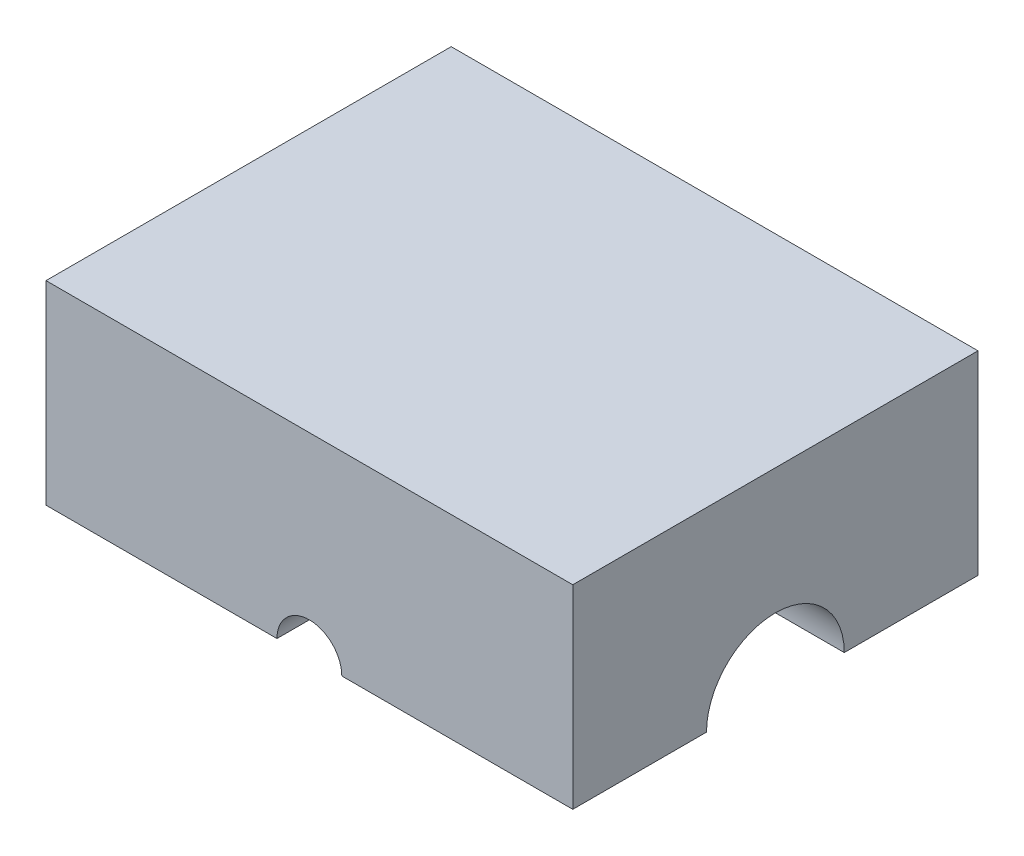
ISO-10303-21;
HEADER;
FILE_DESCRIPTION(('STEP AP214'),'2;1');
FILE_NAME('part.step','',(''),(''),'','','');
FILE_SCHEMA(('AUTOMOTIVE_DESIGN { 1 0 10303 214 1 1 1 1 }'));
ENDSEC;
DATA;
#1=APPLICATION_CONTEXT('core data for automotive mechanical design processes');
#2=APPLICATION_PROTOCOL_DEFINITION('international standard','automotive_design',2000,#1);
#3=PRODUCT_CONTEXT('',#1,'mechanical');
#4=PRODUCT('Part','Part','',(#3));
#5=PRODUCT_RELATED_PRODUCT_CATEGORY('part','',(#4));
#6=PRODUCT_DEFINITION_FORMATION('','',#4);
#7=PRODUCT_DEFINITION_CONTEXT('part definition',#1,'design');
#8=PRODUCT_DEFINITION('design','',#6,#7);
#9=PRODUCT_DEFINITION_SHAPE('','',#8);
#10=(LENGTH_UNIT() NAMED_UNIT(*) SI_UNIT(.MILLI.,.METRE.));
#11=(NAMED_UNIT(*) PLANE_ANGLE_UNIT() SI_UNIT($,.RADIAN.));
#12=(NAMED_UNIT(*) SI_UNIT($,.STERADIAN.) SOLID_ANGLE_UNIT());
#13=UNCERTAINTY_MEASURE_WITH_UNIT(LENGTH_MEASURE(1.E-05),#10,'distance_accuracy_value','');
#14=(GEOMETRIC_REPRESENTATION_CONTEXT(3) GLOBAL_UNCERTAINTY_ASSIGNED_CONTEXT((#13)) GLOBAL_UNIT_ASSIGNED_CONTEXT((#10,
#11,#12)) REPRESENTATION_CONTEXT('',''));
#15=CARTESIAN_POINT('',(0.,0.,0.));
#16=DIRECTION('',(0.,0.,1.));
#17=DIRECTION('',(1.,0.,0.));
#18=AXIS2_PLACEMENT_3D('',#15,#16,#17);
#19=CARTESIAN_POINT('',(-206.375,0.,158.75));
#20=DIRECTION('',(0.,1.,0.));
#21=DIRECTION('',(0.,0.,1.));
#22=AXIS2_PLACEMENT_3D('',#19,#20,#21);
#23=PLANE('',#22);
#24=DIRECTION('',(1.,0.,0.));
#25=VECTOR('',#24,1.);
#26=CARTESIAN_POINT('',(-206.375,0.,53.975));
#27=LINE('',#26,#25);
#28=CARTESIAN_POINT('',(-206.375,0.,53.975));
#29=VERTEX_POINT('',#28);
#30=CARTESIAN_POINT('',(-101.6,0.,53.975));
#31=VERTEX_POINT('',#30);
#32=EDGE_CURVE('E151',#29,#31,#27,.T.);
#33=ORIENTED_EDGE('',*,*,#32,.T.);
#34=CARTESIAN_POINT('',(-101.6,0.,79.375));
#35=DIRECTION('',(0.,1.,0.));
#36=DIRECTION('',(0.,0.,1.));
#37=AXIS2_PLACEMENT_3D('',#34,#35,#36);
#38=CIRCLE('',#37,25.4);
#39=CARTESIAN_POINT('',(-76.2,0.,79.375));
#40=VERTEX_POINT('',#39);
#41=EDGE_CURVE('E11',#31,#40,#38,.F.);
#42=ORIENTED_EDGE('',*,*,#41,.T.);
#43=DIRECTION('',(0.,0.,1.));
#44=VECTOR('',#43,1.);
#45=CARTESIAN_POINT('',(-76.2,0.,189.625960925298));
#46=LINE('',#45,#44);
#47=CARTESIAN_POINT('',(-76.2,0.,95.25));
#48=VERTEX_POINT('',#47);
#49=EDGE_CURVE('E220',#40,#48,#46,.T.);
#50=ORIENTED_EDGE('',*,*,#49,.T.);
#51=DIRECTION('',(1.,0.,0.));
#52=VECTOR('',#51,1.);
#53=CARTESIAN_POINT('',(-206.375,0.,95.25));
#54=LINE('',#53,#52);
#55=CARTESIAN_POINT('',(-25.4,0.,95.25));
#56=VERTEX_POINT('',#55);
#57=EDGE_CURVE('E212',#48,#56,#54,.T.);
#58=ORIENTED_EDGE('',*,*,#57,.T.);
#59=DIRECTION('',(0.,0.,1.));
#60=VECTOR('',#59,1.);
#61=CARTESIAN_POINT('',(-25.4,0.,189.625960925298));
#62=LINE('',#61,#60);
#63=CARTESIAN_POINT('',(-25.4,0.,158.75));
#64=VERTEX_POINT('',#63);
#65=EDGE_CURVE('E221',#56,#64,#62,.T.);
#66=ORIENTED_EDGE('',*,*,#65,.T.);
#67=DIRECTION('',(1.,0.,0.));
#68=VECTOR('',#67,1.);
#69=CARTESIAN_POINT('',(-206.375,0.,158.75));
#70=LINE('',#69,#68);
#71=CARTESIAN_POINT('',(-206.375,0.,158.75));
#72=VERTEX_POINT('',#71);
#73=EDGE_CURVE('E170',#72,#64,#70,.T.);
#74=ORIENTED_EDGE('',*,*,#73,.F.);
#75=DIRECTION('',(0.,0.,1.));
#76=VECTOR('',#75,1.);
#77=CARTESIAN_POINT('',(-206.375,0.,-158.75));
#78=LINE('',#77,#76);
#79=EDGE_CURVE('E168',#29,#72,#78,.T.);
#80=ORIENTED_EDGE('',*,*,#79,.F.);
#81=EDGE_LOOP('',(#33,#42,#50,#58,#66,#74,#80));
#82=FACE_BOUND('',#81,.T.);
#83=ADVANCED_FACE('F31',(#82),#23,.F.);
#84=DIRECTION('',(0.,0.,1.));
#85=VECTOR('',#84,1.);
#86=CARTESIAN_POINT('',(76.2,0.,189.625960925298));
#87=LINE('',#86,#85);
#88=CARTESIAN_POINT('',(76.2,0.,95.25));
#89=VERTEX_POINT('',#88);
#90=CARTESIAN_POINT('',(76.2,0.,79.375));
#91=VERTEX_POINT('',#90);
#92=EDGE_CURVE('E205',#89,#91,#87,.F.);
#93=ORIENTED_EDGE('',*,*,#92,.T.);
#94=CARTESIAN_POINT('',(101.6,0.,79.375));
#95=DIRECTION('',(0.,1.,0.));
#96=DIRECTION('',(0.,0.,1.));
#97=AXIS2_PLACEMENT_3D('',#94,#95,#96);
#98=CIRCLE('',#97,25.4);
#99=CARTESIAN_POINT('',(101.6,0.,53.975));
#100=VERTEX_POINT('',#99);
#101=EDGE_CURVE('E292',#91,#100,#98,.F.);
#102=ORIENTED_EDGE('',*,*,#101,.T.);
#103=DIRECTION('',(1.,0.,0.));
#104=VECTOR('',#103,1.);
#105=CARTESIAN_POINT('',(-206.375,0.,53.975));
#106=LINE('',#105,#104);
#107=CARTESIAN_POINT('',(206.375,0.,53.975));
#108=VERTEX_POINT('',#107);
#109=EDGE_CURVE('E152',#100,#108,#106,.T.);
#110=ORIENTED_EDGE('',*,*,#109,.T.);
#111=DIRECTION('',(0.,0.,-1.));
#112=VECTOR('',#111,1.);
#113=CARTESIAN_POINT('',(206.375,0.,-158.75));
#114=LINE('',#113,#112);
#115=CARTESIAN_POINT('',(206.375,0.,158.75));
#116=VERTEX_POINT('',#115);
#117=EDGE_CURVE('E179',#116,#108,#114,.T.);
#118=ORIENTED_EDGE('',*,*,#117,.F.);
#119=CARTESIAN_POINT('',(25.4,0.,158.75));
#120=VERTEX_POINT('',#119);
#121=EDGE_CURVE('E167',#120,#116,#70,.T.);
#122=ORIENTED_EDGE('',*,*,#121,.F.);
#123=DIRECTION('',(0.,0.,1.));
#124=VECTOR('',#123,1.);
#125=CARTESIAN_POINT('',(25.4,0.,189.625960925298));
#126=LINE('',#125,#124);
#127=CARTESIAN_POINT('',(25.4,0.,95.25));
#128=VERTEX_POINT('',#127);
#129=EDGE_CURVE('E211',#120,#128,#126,.F.);
#130=ORIENTED_EDGE('',*,*,#129,.T.);
#131=EDGE_CURVE('E208',#128,#89,#54,.T.);
#132=ORIENTED_EDGE('',*,*,#131,.T.);
#133=EDGE_LOOP('',(#93,#102,#110,#118,#122,#130,#132));
#134=FACE_BOUND('',#133,.T.);
#135=ADVANCED_FACE('F309',(#134),#23,.F.);
#136=CARTESIAN_POINT('',(-76.2,0.,-95.2500000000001));
#137=VERTEX_POINT('',#136);
#138=CARTESIAN_POINT('',(-76.2,0.,-79.375));
#139=VERTEX_POINT('',#138);
#140=EDGE_CURVE('E218',#137,#139,#46,.T.);
#141=ORIENTED_EDGE('',*,*,#140,.T.);
#142=CARTESIAN_POINT('',(-101.6,0.,-79.375));
#143=DIRECTION('',(0.,1.,0.));
#144=DIRECTION('',(0.,0.,1.));
#145=AXIS2_PLACEMENT_3D('',#142,#143,#144);
#146=CIRCLE('',#145,25.4);
#147=CARTESIAN_POINT('',(-101.6,0.,-53.975));
#148=VERTEX_POINT('',#147);
#149=EDGE_CURVE('E58',#139,#148,#146,.F.);
#150=ORIENTED_EDGE('',*,*,#149,.T.);
#151=DIRECTION('',(1.,0.,0.));
#152=VECTOR('',#151,1.);
#153=CARTESIAN_POINT('',(-206.375,0.,-53.975));
#154=LINE('',#153,#152);
#155=CARTESIAN_POINT('',(-206.375,0.,-53.975));
#156=VERTEX_POINT('',#155);
#157=EDGE_CURVE('E145',#148,#156,#154,.F.);
#158=ORIENTED_EDGE('',*,*,#157,.T.);
#159=CARTESIAN_POINT('',(-206.375,0.,-158.75));
#160=VERTEX_POINT('',#159);
#161=EDGE_CURVE('E150',#160,#156,#78,.T.);
#162=ORIENTED_EDGE('',*,*,#161,.F.);
#163=DIRECTION('',(-1.,0.,0.));
#164=VECTOR('',#163,1.);
#165=CARTESIAN_POINT('',(-206.375,0.,-158.75));
#166=LINE('',#165,#164);
#167=CARTESIAN_POINT('',(-25.4,0.,-158.75));
#168=VERTEX_POINT('',#167);
#169=EDGE_CURVE('E182',#168,#160,#166,.T.);
#170=ORIENTED_EDGE('',*,*,#169,.F.);
#171=DIRECTION('',(0.,0.,1.));
#172=VECTOR('',#171,1.);
#173=CARTESIAN_POINT('',(-25.4,0.,189.625960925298));
#174=LINE('',#173,#172);
#175=CARTESIAN_POINT('',(-25.4,0.,-95.2500000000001));
#176=VERTEX_POINT('',#175);
#177=EDGE_CURVE('E215',#168,#176,#174,.T.);
#178=ORIENTED_EDGE('',*,*,#177,.T.);
#179=DIRECTION('',(-1.,0.,0.));
#180=VECTOR('',#179,1.);
#181=CARTESIAN_POINT('',(-206.375,0.,-95.25));
#182=LINE('',#181,#180);
#183=EDGE_CURVE('E204',#176,#137,#182,.T.);
#184=ORIENTED_EDGE('',*,*,#183,.T.);
#185=EDGE_LOOP('',(#141,#150,#158,#162,#170,#178,#184));
#186=FACE_BOUND('',#185,.T.);
#187=ADVANCED_FACE('F147',(#186),#23,.F.);
#188=CARTESIAN_POINT('',(-206.375,152.4,-158.75));
#189=DIRECTION('',(1.,0.,0.));
#190=DIRECTION('',(0.,0.,-1.));
#191=AXIS2_PLACEMENT_3D('',#188,#189,#190);
#192=PLANE('',#191);
#193=ORIENTED_EDGE('',*,*,#161,.T.);
#194=CARTESIAN_POINT('',(-206.375,0.,0.));
#195=DIRECTION('',(1.,0.,0.));
#196=DIRECTION('',(0.,0.,-1.));
#197=AXIS2_PLACEMENT_3D('',#194,#195,#196);
#198=CIRCLE('',#197,53.975);
#199=EDGE_CURVE('E155',#156,#29,#198,.T.);
#200=ORIENTED_EDGE('',*,*,#199,.T.);
#201=ORIENTED_EDGE('',*,*,#79,.T.);
#202=DIRECTION('',(0.,-1.,0.));
#203=VECTOR('',#202,1.);
#204=CARTESIAN_POINT('',(-206.375,152.4,158.75));
#205=LINE('',#204,#203);
#206=CARTESIAN_POINT('',(-206.375,152.4,158.75));
#207=VERTEX_POINT('',#206);
#208=EDGE_CURVE('E194',#207,#72,#205,.T.);
#209=ORIENTED_EDGE('',*,*,#208,.F.);
#210=DIRECTION('',(0.,0.,1.));
#211=VECTOR('',#210,1.);
#212=CARTESIAN_POINT('',(-206.375,152.4,-158.75));
#213=LINE('',#212,#211);
#214=CARTESIAN_POINT('',(-206.375,152.4,-158.75));
#215=VERTEX_POINT('',#214);
#216=EDGE_CURVE('E186',#215,#207,#213,.T.);
#217=ORIENTED_EDGE('',*,*,#216,.F.);
#218=DIRECTION('',(0.,-1.,0.));
#219=VECTOR('',#218,1.);
#220=CARTESIAN_POINT('',(-206.375,152.4,-158.75));
#221=LINE('',#220,#219);
#222=EDGE_CURVE('E166',#215,#160,#221,.T.);
#223=ORIENTED_EDGE('',*,*,#222,.T.);
#224=EDGE_LOOP('',(#193,#200,#201,#209,#217,#223));
#225=FACE_BOUND('',#224,.T.);
#226=ADVANCED_FACE('F163',(#225),#192,.F.);
#227=CARTESIAN_POINT('',(-206.375,152.4,158.75));
#228=DIRECTION('',(0.,0.,-1.));
#229=DIRECTION('',(-1.,0.,0.));
#230=AXIS2_PLACEMENT_3D('',#227,#228,#229);
#231=PLANE('',#230);
#232=ORIENTED_EDGE('',*,*,#73,.T.);
#233=CARTESIAN_POINT('',(0.,0.,158.75));
#234=DIRECTION('',(0.,0.,1.));
#235=DIRECTION('',(1.,0.,0.));
#236=AXIS2_PLACEMENT_3D('',#233,#234,#235);
#237=CIRCLE('',#236,25.4);
#238=EDGE_CURVE('E172',#120,#64,#237,.T.);
#239=ORIENTED_EDGE('',*,*,#238,.F.);
#240=ORIENTED_EDGE('',*,*,#121,.T.);
#241=DIRECTION('',(0.,-1.,0.));
#242=VECTOR('',#241,1.);
#243=CARTESIAN_POINT('',(206.375,152.4,158.75));
#244=LINE('',#243,#242);
#245=CARTESIAN_POINT('',(206.375,152.4,158.75));
#246=VERTEX_POINT('',#245);
#247=EDGE_CURVE('E191',#246,#116,#244,.T.);
#248=ORIENTED_EDGE('',*,*,#247,.F.);
#249=DIRECTION('',(1.,0.,0.));
#250=VECTOR('',#249,1.);
#251=CARTESIAN_POINT('',(-206.375,152.4,158.75));
#252=LINE('',#251,#250);
#253=EDGE_CURVE('E334',#207,#246,#252,.T.);
#254=ORIENTED_EDGE('',*,*,#253,.F.);
#255=ORIENTED_EDGE('',*,*,#208,.T.);
#256=EDGE_LOOP('',(#232,#239,#240,#248,#254,#255));
#257=FACE_BOUND('',#256,.T.);
#258=ADVANCED_FACE('F346',(#257),#231,.F.);
#259=CARTESIAN_POINT('',(206.375,152.4,-158.75));
#260=DIRECTION('',(-1.,0.,0.));
#261=DIRECTION('',(0.,0.,1.));
#262=AXIS2_PLACEMENT_3D('',#259,#260,#261);
#263=PLANE('',#262);
#264=ORIENTED_EDGE('',*,*,#117,.T.);
#265=CARTESIAN_POINT('',(206.375,0.,0.));
#266=DIRECTION('',(1.,0.,0.));
#267=DIRECTION('',(0.,0.,-1.));
#268=AXIS2_PLACEMENT_3D('',#265,#266,#267);
#269=CIRCLE('',#268,53.975);
#270=CARTESIAN_POINT('',(206.375,0.,-53.975));
#271=VERTEX_POINT('',#270);
#272=EDGE_CURVE('E160',#271,#108,#269,.T.);
#273=ORIENTED_EDGE('',*,*,#272,.F.);
#274=CARTESIAN_POINT('',(206.375,0.,-158.75));
#275=VERTEX_POINT('',#274);
#276=EDGE_CURVE('E178',#271,#275,#114,.T.);
#277=ORIENTED_EDGE('',*,*,#276,.T.);
#278=DIRECTION('',(0.,-1.,0.));
#279=VECTOR('',#278,1.);
#280=CARTESIAN_POINT('',(206.375,152.4,-158.75));
#281=LINE('',#280,#279);
#282=CARTESIAN_POINT('',(206.375,152.4,-158.75));
#283=VERTEX_POINT('',#282);
#284=EDGE_CURVE('E188',#283,#275,#281,.T.);
#285=ORIENTED_EDGE('',*,*,#284,.F.);
#286=DIRECTION('',(0.,0.,-1.));
#287=VECTOR('',#286,1.);
#288=CARTESIAN_POINT('',(206.375,152.4,-158.75));
#289=LINE('',#288,#287);
#290=EDGE_CURVE('E335',#246,#283,#289,.T.);
#291=ORIENTED_EDGE('',*,*,#290,.F.);
#292=ORIENTED_EDGE('',*,*,#247,.T.);
#293=EDGE_LOOP('',(#264,#273,#277,#285,#291,#292));
#294=FACE_BOUND('',#293,.T.);
#295=ADVANCED_FACE('F351',(#294),#263,.F.);
#296=CARTESIAN_POINT('',(-206.375,152.4,-158.75));
#297=DIRECTION('',(0.,0.,1.));
#298=DIRECTION('',(1.,0.,0.));
#299=AXIS2_PLACEMENT_3D('',#296,#297,#298);
#300=PLANE('',#299);
#301=CARTESIAN_POINT('',(25.4,0.,-158.75));
#302=VERTEX_POINT('',#301);
#303=EDGE_CURVE('E183',#275,#302,#166,.T.);
#304=ORIENTED_EDGE('',*,*,#303,.T.);
#305=CARTESIAN_POINT('',(0.,0.,-158.75));
#306=DIRECTION('',(0.,0.,1.));
#307=DIRECTION('',(1.,0.,0.));
#308=AXIS2_PLACEMENT_3D('',#305,#306,#307);
#309=CIRCLE('',#308,25.4);
#310=EDGE_CURVE('E318',#302,#168,#309,.T.);
#311=ORIENTED_EDGE('',*,*,#310,.T.);
#312=ORIENTED_EDGE('',*,*,#169,.T.);
#313=ORIENTED_EDGE('',*,*,#222,.F.);
#314=DIRECTION('',(-1.,0.,0.));
#315=VECTOR('',#314,1.);
#316=CARTESIAN_POINT('',(-206.375,152.4,-158.75));
#317=LINE('',#316,#315);
#318=EDGE_CURVE('E174',#283,#215,#317,.T.);
#319=ORIENTED_EDGE('',*,*,#318,.F.);
#320=ORIENTED_EDGE('',*,*,#284,.T.);
#321=EDGE_LOOP('',(#304,#311,#312,#313,#319,#320));
#322=FACE_BOUND('',#321,.T.);
#323=ADVANCED_FACE('F343',(#322),#300,.F.);
#324=CARTESIAN_POINT('',(-206.375,152.4,158.75));
#325=DIRECTION('',(0.,1.,0.));
#326=DIRECTION('',(0.,0.,1.));
#327=AXIS2_PLACEMENT_3D('',#324,#325,#326);
#328=PLANE('',#327);
#329=ORIENTED_EDGE('',*,*,#216,.T.);
#330=ORIENTED_EDGE('',*,*,#253,.T.);
#331=ORIENTED_EDGE('',*,*,#290,.T.);
#332=ORIENTED_EDGE('',*,*,#318,.T.);
#333=EDGE_LOOP('',(#329,#330,#331,#332));
#334=FACE_BOUND('',#333,.T.);
#335=ADVANCED_FACE('F340',(#334),#328,.T.);
#336=DIRECTION('',(1.,0.,0.));
#337=VECTOR('',#336,1.);
#338=CARTESIAN_POINT('',(-206.375,0.,-53.975));
#339=LINE('',#338,#337);
#340=CARTESIAN_POINT('',(101.6,0.,-53.975));
#341=VERTEX_POINT('',#340);
#342=EDGE_CURVE('E159',#271,#341,#339,.F.);
#343=ORIENTED_EDGE('',*,*,#342,.T.);
#344=CARTESIAN_POINT('',(101.6,0.,-79.375));
#345=DIRECTION('',(0.,1.,0.));
#346=DIRECTION('',(0.,0.,1.));
#347=AXIS2_PLACEMENT_3D('',#344,#345,#346);
#348=CIRCLE('',#347,25.4);
#349=CARTESIAN_POINT('',(76.2,0.,-79.375));
#350=VERTEX_POINT('',#349);
#351=EDGE_CURVE('E291',#341,#350,#348,.F.);
#352=ORIENTED_EDGE('',*,*,#351,.T.);
#353=CARTESIAN_POINT('',(76.2,0.,-95.2500000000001));
#354=VERTEX_POINT('',#353);
#355=EDGE_CURVE('E203',#350,#354,#87,.F.);
#356=ORIENTED_EDGE('',*,*,#355,.T.);
#357=CARTESIAN_POINT('',(25.4,0.,-95.2500000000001));
#358=VERTEX_POINT('',#357);
#359=EDGE_CURVE('E200',#354,#358,#182,.T.);
#360=ORIENTED_EDGE('',*,*,#359,.T.);
#361=DIRECTION('',(0.,0.,1.));
#362=VECTOR('',#361,1.);
#363=CARTESIAN_POINT('',(25.4,0.,189.625960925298));
#364=LINE('',#363,#362);
#365=EDGE_CURVE('E197',#358,#302,#364,.F.);
#366=ORIENTED_EDGE('',*,*,#365,.T.);
#367=ORIENTED_EDGE('',*,*,#303,.F.);
#368=ORIENTED_EDGE('',*,*,#276,.F.);
#369=EDGE_LOOP('',(#343,#352,#356,#360,#366,#367,#368));
#370=FACE_BOUND('',#369,.T.);
#371=ADVANCED_FACE('F297',(#370),#23,.F.);
#372=CARTESIAN_POINT('',(0.,0.,189.625960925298));
#373=DIRECTION('',(0.,0.,1.));
#374=DIRECTION('',(1.,0.,0.));
#375=AXIS2_PLACEMENT_3D('',#372,#373,#374);
#376=CYLINDRICAL_SURFACE('',#375,25.4);
#377=CARTESIAN_POINT('',(0.,0.,95.25));
#378=DIRECTION('',(0.,0.,1.));
#379=DIRECTION('',(1.,0.,0.));
#380=AXIS2_PLACEMENT_3D('',#377,#378,#379);
#381=CIRCLE('',#380,25.4);
#382=EDGE_CURVE('E328',#128,#56,#381,.T.);
#383=ORIENTED_EDGE('',*,*,#382,.F.);
#384=ORIENTED_EDGE('',*,*,#129,.F.);
#385=ORIENTED_EDGE('',*,*,#238,.T.);
#386=ORIENTED_EDGE('',*,*,#65,.F.);
#387=EDGE_LOOP('',(#383,#384,#385,#386));
#388=FACE_BOUND('',#387,.T.);
#389=ADVANCED_FACE('F369',(#388),#376,.F.);
#390=CARTESIAN_POINT('',(25.4,0.,95.25));
#391=DIRECTION('',(0.,0.,1.));
#392=DIRECTION('',(1.,0.,0.));
#393=AXIS2_PLACEMENT_3D('',#390,#391,#392);
#394=PLANE('',#393);
#395=CARTESIAN_POINT('',(0.,0.,95.25));
#396=DIRECTION('',(0.,0.,1.));
#397=DIRECTION('',(1.,0.,0.));
#398=AXIS2_PLACEMENT_3D('',#395,#396,#397);
#399=CIRCLE('',#398,76.2);
#400=EDGE_CURVE('E325',#89,#48,#399,.T.);
#401=ORIENTED_EDGE('',*,*,#400,.F.);
#402=ORIENTED_EDGE('',*,*,#131,.F.);
#403=ORIENTED_EDGE('',*,*,#382,.T.);
#404=ORIENTED_EDGE('',*,*,#57,.F.);
#405=EDGE_LOOP('',(#401,#402,#403,#404));
#406=FACE_BOUND('',#405,.T.);
#407=ADVANCED_FACE('F366',(#406),#394,.F.);
#408=CARTESIAN_POINT('',(0.,0.,189.625960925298));
#409=DIRECTION('',(0.,0.,1.));
#410=DIRECTION('',(1.,0.,0.));
#411=AXIS2_PLACEMENT_3D('',#408,#409,#410);
#412=CYLINDRICAL_SURFACE('',#411,76.2);
#413=ORIENTED_EDGE('',*,*,#355,.F.);
#414=CARTESIAN_POINT('',(92.4916186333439,-28.591234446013,-45.7803662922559));
#415=CARTESIAN_POINT('',(73.5262170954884,-22.3888757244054,-49.6539284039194));
#416=CARTESIAN_POINT('',(69.3687139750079,-31.5344497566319,-67.3240680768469));
#417=CARTESIAN_POINT('',(92.8574069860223,-28.0440709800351,-46.1220805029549));
#418=CARTESIAN_POINT('',(73.6870678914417,-21.8231532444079,-49.9038442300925));
#419=CARTESIAN_POINT('',(69.6430552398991,-30.9309606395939,-67.8265889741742));
#420=CARTESIAN_POINT('',(93.2156983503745,-27.4891648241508,-46.4550049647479));
#421=CARTESIAN_POINT('',(73.8389313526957,-21.2603682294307,-50.1397328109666));
#422=CARTESIAN_POINT('',(69.9117737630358,-30.3189317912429,-68.3161837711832));
#423=CARTESIAN_POINT('',(93.9159245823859,-26.3640691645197,-47.1026333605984));
#424=CARTESIAN_POINT('',(74.1261849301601,-20.1383269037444,-50.5862541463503));
#425=CARTESIAN_POINT('',(70.4369434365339,-29.0780174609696,-69.2685784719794));
#426=CARTESIAN_POINT('',(94.257857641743,-25.7938779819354,-47.4173352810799));
#427=CARTESIAN_POINT('',(74.2614351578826,-19.5791937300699,-50.7966718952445));
#428=CARTESIAN_POINT('',(70.6933932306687,-28.4491301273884,-69.7313754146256));
#429=CARTESIAN_POINT('',(95.2574242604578,-24.0600520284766,-48.3334640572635));
#430=CARTESIAN_POINT('',(74.6440601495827,-17.9037596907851,-51.393236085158));
#431=CARTESIAN_POINT('',(71.4430681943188,-26.5368220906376,-71.0786236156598));
#432=CARTESIAN_POINT('',(95.8883073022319,-22.8739344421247,-48.9064318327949));
#433=CARTESIAN_POINT('',(74.8646967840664,-16.8023870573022,-51.7391004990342));
#434=CARTESIAN_POINT('',(71.9162304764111,-25.2286041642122,-71.9212232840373));
#435=CARTESIAN_POINT('',(97.0697278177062,-20.4407139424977,-49.9725031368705));
#436=CARTESIAN_POINT('',(75.2459072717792,-14.6307172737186,-52.3424484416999));
#437=CARTESIAN_POINT('',(72.8022958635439,-22.5449050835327,-73.4889752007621));
#438=CARTESIAN_POINT('',(97.6198461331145,-19.1933348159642,-50.4651913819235));
#439=CARTESIAN_POINT('',(75.4051246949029,-13.5625889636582,-52.597904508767));
#440=CARTESIAN_POINT('',(73.2148845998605,-21.1691192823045,-74.2135167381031));
#441=CARTESIAN_POINT('',(98.6245555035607,-16.649663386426,-51.3605518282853));
#442=CARTESIAN_POINT('',(75.6701999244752,-11.4736303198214,-53.030155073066));
#443=CARTESIAN_POINT('',(73.9684166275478,-18.363599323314,-75.5302232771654));
#444=CARTESIAN_POINT('',(99.0791743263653,-15.3533854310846,-51.7632501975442));
#445=CARTESIAN_POINT('',(75.7752299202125,-10.4551883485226,-53.2056922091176));
#446=CARTESIAN_POINT('',(74.3093807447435,-16.9338809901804,-76.1224267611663));
#447=CARTESIAN_POINT('',(99.8852311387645,-12.7118012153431,-52.4746885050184));
#448=CARTESIAN_POINT('',(75.9437391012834,-8.46246198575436,-53.4939712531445));
#449=CARTESIAN_POINT('',(74.9139233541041,-14.0203689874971,-77.1686595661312));
#450=CARTESIAN_POINT('',(100.236020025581,-11.3662432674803,-52.7828377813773));
#451=CARTESIAN_POINT('',(76.0063574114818,-7.49129795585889,-53.6053712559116));
#452=CARTESIAN_POINT('',(75.1770150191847,-12.5362977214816,-77.6218202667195));
#453=CARTESIAN_POINT('',(100.821944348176,-8.64396228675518,-53.2963504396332));
#454=CARTESIAN_POINT('',(76.1014822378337,-5.59395783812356,-53.7794483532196));
#455=CARTESIAN_POINT('',(75.6164582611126,-9.53378193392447,-78.376985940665));
#456=CARTESIAN_POINT('',(101.05706976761,-7.26723656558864,-53.5017049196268));
#457=CARTESIAN_POINT('',(76.1336424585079,-4.67066250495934,-53.8415379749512));
#458=CARTESIAN_POINT('',(75.7928023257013,-8.01533444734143,-78.6789778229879));
#459=CARTESIAN_POINT('',(101.404833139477,-4.49927706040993,-53.8051060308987));
#460=CARTESIAN_POINT('',(76.1783722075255,-2.85671139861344,-53.9298681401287));
#461=CARTESIAN_POINT('',(76.0536248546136,-4.96243793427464,-79.125155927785));
#462=CARTESIAN_POINT('',(101.517853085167,-3.10810234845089,-53.9034873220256));
#463=CARTESIAN_POINT('',(76.1908522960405,-1.96878132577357,-53.9559354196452));
#464=CARTESIAN_POINT('',(76.1383898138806,-3.42805406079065,-79.2698342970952));
#465=CARTESIAN_POINT('',(101.619588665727,-0.32032246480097,-53.9920566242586));
#466=CARTESIAN_POINT('',(76.2022235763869,-0.200324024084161,-53.9796030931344));
#467=CARTESIAN_POINT('',(76.2146914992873,-0.35329683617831,-79.4000832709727));
#468=CARTESIAN_POINT('',(101.60832146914,1.07628193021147,-53.9822595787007));
#469=CARTESIAN_POINT('',(76.2010814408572,0.677426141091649,-53.9771339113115));
#470=CARTESIAN_POINT('',(76.2062411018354,1.18707565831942,-79.3856758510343));
#471=CARTESIAN_POINT('',(101.470989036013,3.68845900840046,-53.8626727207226));
#472=CARTESIAN_POINT('',(76.1854742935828,2.34017367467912,-53.9448571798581));
#473=CARTESIAN_POINT('',(76.1032417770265,4.06815331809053,-79.2098128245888));
#474=CARTESIAN_POINT('',(101.359343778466,4.9049888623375,-53.7654429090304));
#475=CARTESIAN_POINT('',(76.1727183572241,3.12099612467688,-53.9185589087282));
#476=CARTESIAN_POINT('',(76.0195078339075,5.4099141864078,-79.0668278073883));
#477=CARTESIAN_POINT('',(101.043402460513,7.32307348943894,-53.4897527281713));
#478=CARTESIAN_POINT('',(76.1316310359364,4.71006684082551,-53.8377374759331));
#479=CARTESIAN_POINT('',(75.7825518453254,8.07691928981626,-78.6614010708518));
#480=CARTESIAN_POINT('',(100.839114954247,8.52462963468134,-53.3112998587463));
#481=CARTESIAN_POINT('',(76.1034082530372,5.51641435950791,-53.7834182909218));
#482=CARTESIAN_POINT('',(75.6293362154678,9.40216503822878,-78.3989703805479));
#483=CARTESIAN_POINT('',(100.341787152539,10.905823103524,-52.8756108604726));
#484=CARTESIAN_POINT('',(76.0241081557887,7.16756674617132,-53.6375128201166));
#485=CARTESIAN_POINT('',(75.2563403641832,12.0284813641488,-77.758251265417));
#486=CARTESIAN_POINT('',(100.048665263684,12.0854392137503,-52.6183023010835));
#487=CARTESIAN_POINT('',(75.9732281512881,8.01049429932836,-53.5462651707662));
#488=CARTESIAN_POINT('',(75.0364989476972,13.3295285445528,-77.3798563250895));
#489=CARTESIAN_POINT('',(99.3793515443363,14.4145552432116,-52.0284979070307));
#490=CARTESIAN_POINT('',(75.8400372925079,9.73880139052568,-53.3156800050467));
#491=CARTESIAN_POINT('',(74.5345136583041,15.8984065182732,-76.5124969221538));
#492=CARTESIAN_POINT('',(99.0031559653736,15.5640538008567,-51.6959986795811));
#493=CARTESIAN_POINT('',(75.7580895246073,10.6223172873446,-53.1769217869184));
#494=CARTESIAN_POINT('',(74.2523669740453,17.1662358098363,-76.0235274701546));
#495=CARTESIAN_POINT('',(98.168415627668,17.8433433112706,-50.9546156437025));
#496=CARTESIAN_POINT('',(75.5530126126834,12.4437048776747,-52.8380620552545));
#497=CARTESIAN_POINT('',(73.6263117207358,19.6801580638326,-74.9332582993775));
#498=CARTESIAN_POINT('',(97.7087548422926,18.9726060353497,-50.5446931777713));
#499=CARTESIAN_POINT('',(75.4298284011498,13.3805278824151,-52.6379026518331));
#500=CARTESIAN_POINT('',(73.2815661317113,20.9256684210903,-74.3304311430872));
#501=CARTESIAN_POINT('',(96.7186764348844,21.1889444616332,-49.6563665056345));
#502=CARTESIAN_POINT('',(75.1355209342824,15.2905676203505,-52.1670550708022));
#503=CARTESIAN_POINT('',(72.5390073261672,23.3701593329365,-73.0240683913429));
#504=CARTESIAN_POINT('',(96.188259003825,22.2760202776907,-49.1779624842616));
#505=CARTESIAN_POINT('',(74.9650830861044,16.2622633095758,-51.8973977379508));
#506=CARTESIAN_POINT('',(72.1411942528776,24.5691400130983,-72.3205330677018));
#507=CARTESIAN_POINT('',(95.0650533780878,24.4039391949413,-48.1574569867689));
#508=CARTESIAN_POINT('',(74.5716833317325,18.2320280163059,-51.2801021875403));
#509=CARTESIAN_POINT('',(71.2987900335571,26.9161094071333,-70.8197896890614));
#510=CARTESIAN_POINT('',(94.4722789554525,25.4447924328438,-47.6153695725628));
#511=CARTESIAN_POINT('',(74.3495087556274,19.2289233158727,-50.9336474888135));
#512=CARTESIAN_POINT('',(70.854209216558,28.064109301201,-70.0226023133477));
#513=CARTESIAN_POINT('',(93.2325619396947,27.477964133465,-46.4717407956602));
#514=CARTESIAN_POINT('',(73.8505860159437,21.2377584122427,-50.1576905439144));
#515=CARTESIAN_POINT('',(69.9244214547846,30.3065780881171,-68.3407952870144));
#516=CARTESIAN_POINT('',(92.5856120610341,28.4702760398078,-45.8701914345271));
#517=CARTESIAN_POINT('',(73.5746315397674,22.2489317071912,-49.7294009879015));
#518=CARTESIAN_POINT('',(69.4392090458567,31.4010397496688,-67.4561638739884));
#519=CARTESIAN_POINT('',(91.526720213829,29.9991341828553,-44.875407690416));
#520=CARTESIAN_POINT('',(73.0945180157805,23.8536938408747,-48.9827771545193));
#521=CARTESIAN_POINT('',(68.6450401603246,33.0872803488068,-65.9932466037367));
#522=CARTESIAN_POINT('',(91.1298137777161,30.5525271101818,-44.5004254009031));
#523=CARTESIAN_POINT('',(72.9096114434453,24.4423165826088,-48.6949486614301));
#524=CARTESIAN_POINT('',(68.3473603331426,33.6976401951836,-65.4418020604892));
#525=CARTESIAN_POINT('',(90.3223525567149,31.6418332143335,-43.7325845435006));
#526=CARTESIAN_POINT('',(72.5222809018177,25.6178073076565,-48.090526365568));
#527=CARTESIAN_POINT('',(67.7417644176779,34.8990807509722,-64.3126243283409));
#528=CARTESIAN_POINT('',(89.9118004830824,32.1777498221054,-43.3397295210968));
#529=CARTESIAN_POINT('',(72.3199999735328,26.2046451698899,-47.7741662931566));
#530=CARTESIAN_POINT('',(67.4338503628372,35.4901652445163,-63.7348963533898));
#531=CARTESIAN_POINT('',(88.6619076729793,33.7592674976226,-42.1351290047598));
#532=CARTESIAN_POINT('',(71.6899553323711,27.9532572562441,-46.7852016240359));
#533=CARTESIAN_POINT('',(66.4964307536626,37.2344862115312,-61.9634250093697));
#534=CARTESIAN_POINT('',(87.8043460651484,34.7786138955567,-41.2973627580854));
#535=CARTESIAN_POINT('',(71.2352299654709,29.1157249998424,-46.0669090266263));
#536=CARTESIAN_POINT('',(65.8532595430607,38.3587653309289,-60.7314158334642));
#537=CARTESIAN_POINT('',(86.0531485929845,36.7469512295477,-39.5561840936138));
#538=CARTESIAN_POINT('',(70.2649303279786,31.4093272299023,-44.5146833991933));
#539=CARTESIAN_POINT('',(64.5398614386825,40.5297256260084,-58.1708589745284));
#540=CARTESIAN_POINT('',(85.1594641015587,37.6958420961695,-38.6526817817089));
#541=CARTESIAN_POINT('',(69.7500201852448,32.5410823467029,-43.6820416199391));
#542=CARTESIAN_POINT('',(63.8695980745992,41.5762964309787,-56.842179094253));
#543=CARTESIAN_POINT('',(83.3505859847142,39.5211536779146,-36.7842989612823));
#544=CARTESIAN_POINT('',(68.6705077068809,34.7566984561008,-41.9048955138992));
#545=CARTESIAN_POINT('',(62.5129394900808,43.589507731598,-54.0945572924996));
#546=CARTESIAN_POINT('',(82.4353914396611,40.3975712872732,-35.819415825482));
#547=CARTESIAN_POINT('',(68.1063562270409,35.8416247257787,-40.9615325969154));
#548=CARTESIAN_POINT('',(61.8265435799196,44.5561448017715,-52.6756115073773));
#549=CARTESIAN_POINT('',(80.9598674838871,41.7463032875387,-34.2223501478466));
#550=CARTESIAN_POINT('',(67.1685845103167,37.539256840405,-39.3556387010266));
#551=CARTESIAN_POINT('',(60.71990061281,46.043716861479,-50.3269855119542));
#552=CARTESIAN_POINT('',(80.401669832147,42.2418785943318,-33.6087251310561));
#553=CARTESIAN_POINT('',(66.8088507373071,38.167553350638,-38.7314269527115));
#554=CARTESIAN_POINT('',(60.30125237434,46.5903072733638,-49.4245957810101));
#555=CARTESIAN_POINT('',(79.286165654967,43.2058380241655,-32.3601328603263));
#556=CARTESIAN_POINT('',(66.0792917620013,39.3992289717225,-37.4442542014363));
#557=CARTESIAN_POINT('',(59.4646242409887,47.6534978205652,-47.5884306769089));
#558=CARTESIAN_POINT('',(78.7288590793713,43.6742237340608,-31.725166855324));
#559=CARTESIAN_POINT('',(65.7094513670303,40.0029449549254,-36.7814217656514));
#560=CARTESIAN_POINT('',(59.0466443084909,48.1700997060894,-46.654657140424));
#561=CARTESIAN_POINT('',(77.618599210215,44.5836788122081,-30.4338641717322));
#562=CARTESIAN_POINT('',(64.9630740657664,41.1832011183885,-35.4174996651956));
#563=CARTESIAN_POINT('',(58.2139494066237,49.1731751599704,-44.755682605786));
#564=CARTESIAN_POINT('',(77.0656474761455,45.0247387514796,-29.7775202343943));
#565=CARTESIAN_POINT('',(64.5864748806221,41.7600921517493,-34.7164700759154));
#566=CARTESIAN_POINT('',(57.7992356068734,49.6596383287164,-43.7904709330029));
#567=CARTESIAN_POINT('',(75.9682584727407,45.8789869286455,-28.4437401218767));
#568=CARTESIAN_POINT('',(63.8305756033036,42.8841052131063,-33.277043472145));
#569=CARTESIAN_POINT('',(56.9761938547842,50.6018238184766,-41.8290295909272));
#570=CARTESIAN_POINT('',(75.423821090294,46.2921755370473,-27.7663042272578));
#571=CARTESIAN_POINT('',(63.4511750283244,43.4316019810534,-32.5386700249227));
#572=CARTESIAN_POINT('',(56.5678658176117,51.0575465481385,-40.832800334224));
#573=CARTESIAN_POINT('',(74.3476928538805,47.090255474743,-26.3901734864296));
#574=CARTESIAN_POINT('',(62.6938232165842,44.494594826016,-31.0250275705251));
#575=CARTESIAN_POINT('',(55.7607696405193,51.937781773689,-38.8090786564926));
#576=CARTESIAN_POINT('',(73.8160045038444,47.4751412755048,-25.6914745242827));
#577=CARTESIAN_POINT('',(62.3157317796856,45.0104697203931,-30.2497200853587));
#578=CARTESIAN_POINT('',(55.3620033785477,52.3622881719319,-37.781580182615));
#579=CARTESIAN_POINT('',(72.7702739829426,48.2158710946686,-24.2728392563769));
#580=CARTESIAN_POINT('',(61.565704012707,46.0077424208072,-28.6629291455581));
#581=CARTESIAN_POINT('',(54.5777054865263,53.1792695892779,-35.6953518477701));
#582=CARTESIAN_POINT('',(72.2562323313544,48.5717142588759,-23.5529023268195));
#583=CARTESIAN_POINT('',(61.1935909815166,46.4895283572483,-27.8513584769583));
#584=CARTESIAN_POINT('',(54.1921742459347,53.5717436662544,-34.6366210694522));
#585=CARTESIAN_POINT('',(71.2513327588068,49.2533673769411,-22.0919867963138));
#586=CARTESIAN_POINT('',(60.4607611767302,47.4159679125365,-26.1930053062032));
#587=CARTESIAN_POINT('',(53.4384995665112,54.3235669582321,-32.4882158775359));
#588=CARTESIAN_POINT('',(70.7604660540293,49.5791887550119,-21.3510163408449));
#589=CARTESIAN_POINT('',(60.0998311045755,47.8610228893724,-25.3460936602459));
#590=CARTESIAN_POINT('',(53.0703495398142,54.6829287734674,-31.3985534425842));
#591=CARTESIAN_POINT('',(69.8077201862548,50.1998345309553,-19.8478794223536));
#592=CARTESIAN_POINT('',(59.394875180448,48.7115207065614,-23.6177047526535));
#593=CARTESIAN_POINT('',(52.3557901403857,55.3674645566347,-29.1880579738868));
#594=CARTESIAN_POINT('',(69.3458382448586,50.4946619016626,-19.0857150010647));
#595=CARTESIAN_POINT('',(59.0506095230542,49.1173499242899,-22.7360234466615));
#596=CARTESIAN_POINT('',(52.0093786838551,55.6926418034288,-28.0672279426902));
#597=CARTESIAN_POINT('',(68.2456478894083,51.1850208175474,-17.171672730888));
#598=CARTESIAN_POINT('',(58.2271161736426,50.0691223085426,-20.5127914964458));
#599=CARTESIAN_POINT('',(51.1842359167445,56.4540670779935,-25.2524598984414));
#600=CARTESIAN_POINT('',(67.628215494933,51.5615475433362,-16.0072393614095));
#601=CARTESIAN_POINT('',(57.7598014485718,50.5921144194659,-19.1481500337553));
#602=CARTESIAN_POINT('',(50.7211616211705,56.8693539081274,-23.5400578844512));
#603=CARTESIAN_POINT('',(66.4940788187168,52.2391776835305,-13.6341496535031));
#604=CARTESIAN_POINT('',(56.8968938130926,51.5354652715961,-16.3510152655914));
#605=CARTESIAN_POINT('',(49.870559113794,57.6167400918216,-20.0502200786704));
#606=CARTESIAN_POINT('',(65.9773625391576,52.5402900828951,-12.4254986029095));
#607=CARTESIAN_POINT('',(56.5004059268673,51.9569372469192,-14.9172924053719));
#608=CARTESIAN_POINT('',(49.483021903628,57.9488493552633,-18.2727920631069));
#609=CARTESIAN_POINT('',(65.29759353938,52.9303519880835,-10.5862887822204));
#610=CARTESIAN_POINT('',(55.976565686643,52.5041298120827,-12.7245781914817));
#611=CARTESIAN_POINT('',(48.9731951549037,58.3790646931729,-15.5680717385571));
#612=CARTESIAN_POINT('',(65.0872151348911,53.0499263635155,-9.97010817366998));
#613=CARTESIAN_POINT('',(55.8141393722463,52.6719961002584,-11.9890245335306));
#614=CARTESIAN_POINT('',(48.8154113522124,58.510948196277,-14.6619237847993));
#615=CARTESIAN_POINT('',(64.7005765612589,53.2681750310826,-8.7291917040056));
#616=CARTESIAN_POINT('',(55.5151610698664,52.9786089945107,-10.5052112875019));
#617=CARTESIAN_POINT('',(48.5254324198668,58.7516636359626,-12.8370466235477));
#618=CARTESIAN_POINT('',(64.5243109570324,53.3668526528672,-8.10445722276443));
#619=CARTESIAN_POINT('',(55.3785097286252,53.1174624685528,-9.7567303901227));
#620=CARTESIAN_POINT('',(48.3932332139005,58.860499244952,-11.9183194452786));
#621=CARTESIAN_POINT('',(64.2086424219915,53.5426139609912,-6.84774824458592));
#622=CARTESIAN_POINT('',(55.1335132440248,53.3648969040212,-8.24913949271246));
#623=CARTESIAN_POINT('',(48.1564818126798,59.0543536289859,-10.0702180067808));
#624=CARTESIAN_POINT('',(64.0692353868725,53.6197000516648,-6.21577456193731));
#625=CARTESIAN_POINT('',(55.0250823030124,53.4735671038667,-7.4897853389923));
#626=CARTESIAN_POINT('',(48.0519265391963,59.1393750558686,-9.14084494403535));
#627=CARTESIAN_POINT('',(63.8296064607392,53.7516889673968,-4.94609446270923));
#628=CARTESIAN_POINT('',(54.8385747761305,53.6596741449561,-5.96280059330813));
#629=CARTESIAN_POINT('',(47.8722048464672,59.2849510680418,-7.27366832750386));
#630=CARTESIAN_POINT('',(63.729383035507,53.8065926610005,-4.30838827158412));
#631=CARTESIAN_POINT('',(54.7604311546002,53.7371789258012,-5.19490616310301));
#632=CARTESIAN_POINT('',(47.7970372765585,59.3455066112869,-6.33586510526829));
#633=CARTESIAN_POINT('',(63.578167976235,53.8892380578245,-3.09532311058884));
#634=CARTESIAN_POINT('',(54.6424971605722,53.8538463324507,-3.7333683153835));
#635=CARTESIAN_POINT('',(47.6836259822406,59.4366596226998,-4.55194575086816));
#636=CARTESIAN_POINT('',(63.5231530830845,53.9192036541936,-2.52034586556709));
#637=CARTESIAN_POINT('',(54.599542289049,53.8961790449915,-3.04010550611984));
#638=CARTESIAN_POINT('',(47.642364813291,59.4697099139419,-3.70639097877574));
#639=CARTESIAN_POINT('',(63.4468691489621,53.9607195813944,-1.36869806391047));
#640=CARTESIAN_POINT('',(54.5399859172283,53.9548185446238,-1.65127970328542));
#641=CARTESIAN_POINT('',(47.5851518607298,59.5154995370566,-2.01279127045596));
#642=CARTESIAN_POINT('',(63.4255991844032,53.9722704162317,-0.792027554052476));
#643=CARTESIAN_POINT('',(54.5233659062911,53.9711435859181,-0.955509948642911));
#644=CARTESIAN_POINT('',(47.5691993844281,59.5282394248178,-1.16474640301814));
#645=CARTESIAN_POINT('',(63.4171318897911,53.9768709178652,0.361463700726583));
#646=CARTESIAN_POINT('',(54.5167525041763,53.9776431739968,0.436053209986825));
#647=CARTESIAN_POINT('',(47.5628489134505,59.5333135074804,0.531564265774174));
#648=CARTESIAN_POINT('',(63.4299323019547,53.9699218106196,0.938284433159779));
#649=CARTESIAN_POINT('',(54.5267553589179,53.9678214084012,1.13205581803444));
#650=CARTESIAN_POINT('',(47.5724492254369,59.5256490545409,1.37983004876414));
#651=CARTESIAN_POINT('',(63.4894034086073,53.9375772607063,2.09060053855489));
#652=CARTESIAN_POINT('',(54.5731934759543,53.9221317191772,2.52189224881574));
#653=CARTESIAN_POINT('',(47.6170525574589,59.489974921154,3.07441255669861));
#654=CARTESIAN_POINT('',(63.5360743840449,53.912181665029,2.66609590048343));
#655=CARTESIAN_POINT('',(54.6096428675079,53.8862498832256,3.21593380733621));
#656=CARTESIAN_POINT('',(47.6520557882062,59.461965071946,3.92072926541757));
#657=CARTESIAN_POINT('',(63.6626815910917,53.8430748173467,3.8152003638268));
#658=CARTESIAN_POINT('',(54.7084136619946,53.7886801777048,4.60076855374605));
#659=CARTESIAN_POINT('',(47.7470111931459,59.385744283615,5.61058877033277));
#660=CARTESIAN_POINT('',(63.7426704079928,53.7993346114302,4.3888050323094));
#661=CARTESIAN_POINT('',(54.7708051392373,53.7269225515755,5.29175762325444));
#662=CARTESIAN_POINT('',(47.8070028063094,59.3375014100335,6.45412504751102));
#663=CARTESIAN_POINT('',(63.9347431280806,53.6938430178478,5.53184329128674));
#664=CARTESIAN_POINT('',(54.9204099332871,53.5781152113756,6.66734071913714));
#665=CARTESIAN_POINT('',(47.9510573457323,59.2211503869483,8.13506366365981));
#666=CARTESIAN_POINT('',(64.0468270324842,53.6320916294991,6.10127688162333));
#667=CARTESIAN_POINT('',(55.0076663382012,53.4910221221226,7.35212971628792));
#668=CARTESIAN_POINT('',(48.0351202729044,59.1530422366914,8.97246600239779));
#669=CARTESIAN_POINT('',(64.301536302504,53.490977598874,7.23478472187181));
#670=CARTESIAN_POINT('',(55.2056109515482,53.2922172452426,8.71350975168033));
#671=CARTESIAN_POINT('',(48.2261522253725,58.9974017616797,10.6393892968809));
#672=CARTESIAN_POINT('',(64.4441623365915,53.4116145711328,7.79885885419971));
#673=CARTESIAN_POINT('',(55.3163546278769,53.1804484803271,9.39028431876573));
#674=CARTESIAN_POINT('',(48.3331217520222,58.9098690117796,11.4689100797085));
#675=CARTESIAN_POINT('',(64.758090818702,53.2357530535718,8.92063512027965));
#676=CARTESIAN_POINT('',(55.559605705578,52.933099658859,10.7340766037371));
#677=CARTESIAN_POINT('',(48.5685681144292,58.7159041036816,13.118581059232));
#678=CARTESIAN_POINT('',(64.9293969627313,53.1392523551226,9.47833642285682));
#679=CARTESIAN_POINT('',(55.6921803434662,52.7974486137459,11.4012631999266));
#680=CARTESIAN_POINT('',(48.6970477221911,58.6094695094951,13.9387300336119));
#681=CARTESIAN_POINT('',(65.4784635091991,52.8275399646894,11.1260866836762));
#682=CARTESIAN_POINT('',(56.1164532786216,52.3595430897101,13.3704222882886));
#683=CARTESIAN_POINT('',(49.1088476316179,58.2656690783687,16.3618921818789));
#684=CARTESIAN_POINT('',(65.8948478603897,52.5882236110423,12.2057888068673));
#685=CARTESIAN_POINT('',(56.4371388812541,52.0239194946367,14.6556898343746));
#686=CARTESIAN_POINT('',(49.4211358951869,58.0017172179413,17.9496894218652));
#687=CARTESIAN_POINT('',(66.8143039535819,52.0489978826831,14.3320026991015));
#688=CARTESIAN_POINT('',(57.1405563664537,51.270922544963,17.1740554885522));
#689=CARTESIAN_POINT('',(50.1107279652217,57.4069829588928,21.076474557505));
#690=CARTESIAN_POINT('',(67.3173731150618,51.7490903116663,15.3785154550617));
#691=CARTESIAN_POINT('',(57.5238913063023,50.8528368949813,18.4081185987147));
#692=CARTESIAN_POINT('',(50.4880298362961,57.0762025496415,22.6154639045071));
#693=CARTESIAN_POINT('',(68.3939838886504,51.0921537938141,17.437349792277));
#694=CARTESIAN_POINT('',(58.3378000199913,49.9415961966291,20.8210494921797));
#695=CARTESIAN_POINT('',(51.2954879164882,56.3516402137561,25.6431614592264));
#696=CARTESIAN_POINT('',(68.967594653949,50.7350686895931,18.4496365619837));
#697=CARTESIAN_POINT('',(58.7690196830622,49.447577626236,22.0005963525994));
#698=CARTESIAN_POINT('',(51.7256959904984,55.957796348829,27.13181847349));
#699=CARTESIAN_POINT('',(70.1696265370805,49.9671083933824,20.4383311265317));
#700=CARTESIAN_POINT('',(59.6643528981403,48.3912415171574,24.3008249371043));
#701=CARTESIAN_POINT('',(52.6272199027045,55.1107813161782,30.0563693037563));
#702=CARTESIAN_POINT('',(70.7980627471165,49.556218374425,21.4147289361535));
#703=CARTESIAN_POINT('',(60.1290297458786,47.8280679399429,25.4220230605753));
#704=CARTESIAN_POINT('',(53.0985470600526,54.6575937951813,31.4922484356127));
#705=CARTESIAN_POINT('',(71.9552894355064,48.7778932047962,23.1235366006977));
#706=CARTESIAN_POINT('',(60.9749609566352,46.7691589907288,27.3657089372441));
#707=CARTESIAN_POINT('',(53.9664670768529,53.7991469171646,34.0052008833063));
#708=CARTESIAN_POINT('',(72.476166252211,48.4203333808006,23.8629720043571));
#709=CARTESIAN_POINT('',(61.3532367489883,46.2841568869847,28.2016228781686));
#710=CARTESIAN_POINT('',(54.3571246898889,53.4047794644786,35.0926058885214));
#711=CARTESIAN_POINT('',(73.5372356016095,47.674822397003,25.3195811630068));
#712=CARTESIAN_POINT('',(62.1167126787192,45.2786151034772,29.835530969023));
#713=CARTESIAN_POINT('',(55.1529267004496,52.5825247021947,37.2346781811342));
#714=CARTESIAN_POINT('',(74.0774246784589,47.2868766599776,26.0367588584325));
#715=CARTESIAN_POINT('',(62.5021071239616,44.7576665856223,30.6336356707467));
#716=CARTESIAN_POINT('',(55.5580685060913,52.1546433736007,38.2893512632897));
#717=CARTESIAN_POINT('',(75.1722467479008,46.4810935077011,27.4494101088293));
#718=CARTESIAN_POINT('',(63.2751142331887,43.6824372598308,32.1919106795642));
#719=CARTESIAN_POINT('',(56.3791850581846,51.2659119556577,40.3667795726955));
#720=CARTESIAN_POINT('',(75.7268866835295,46.0632415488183,28.1448728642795));
#721=CARTESIAN_POINT('',(63.6628824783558,43.1277309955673,32.9521015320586));
#722=CARTESIAN_POINT('',(56.7951650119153,50.8050458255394,41.389518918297));
#723=CARTESIAN_POINT('',(76.8456835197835,45.1983594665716,29.5138010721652));
#724=CARTESIAN_POINT('',(64.4359821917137,41.9876704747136,34.4336219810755));
#725=CARTESIAN_POINT('',(57.6342626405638,49.8511317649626,43.4026486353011));
#726=CARTESIAN_POINT('',(77.4098408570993,44.7513280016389,30.1872655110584));
#727=CARTESIAN_POINT('',(64.8214267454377,41.4019137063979,35.1549328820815));
#728=CARTESIAN_POINT('',(58.0573806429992,49.3580823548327,44.3930375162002));
#729=CARTESIAN_POINT('',(78.5442744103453,43.8277854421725,31.5131653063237));
#730=CARTESIAN_POINT('',(65.5863821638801,40.2012997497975,36.5591753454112));
#731=CARTESIAN_POINT('',(58.908205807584,48.3394692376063,46.3428901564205));
#732=CARTESIAN_POINT('',(79.1145588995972,43.3512287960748,32.165565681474));
#733=CARTESIAN_POINT('',(65.965947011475,39.5860179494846,37.2419628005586));
#734=CARTESIAN_POINT('',(59.3359191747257,47.8138552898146,47.302302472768));
#735=CARTESIAN_POINT('',(80.256421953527,42.3695897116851,33.4480287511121));
#736=CARTESIAN_POINT('',(66.714811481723,38.329798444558,38.5672754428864));
#737=CARTESIAN_POINT('',(60.1923164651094,46.7311651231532,49.1882775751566));
#738=CARTESIAN_POINT('',(80.8280006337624,41.8645046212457,34.0780893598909));
#739=CARTESIAN_POINT('',(67.0841313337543,37.6884961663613,39.2096660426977));
#740=CARTESIAN_POINT('',(60.6210004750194,46.1740859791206,50.1148372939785));
#741=CARTESIAN_POINT('',(82.5387923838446,40.3070594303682,35.9339711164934));
#742=CARTESIAN_POINT('',(68.175506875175,35.7227530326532,41.0823114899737));
#743=CARTESIAN_POINT('',(61.9040942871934,44.4563155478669,52.8440751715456));
#744=CARTESIAN_POINT('',(83.6745369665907,39.2121267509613,37.1260414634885));
#745=CARTESIAN_POINT('',(68.8725325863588,34.3694517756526,42.2427347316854));
#746=CARTESIAN_POINT('',(62.7559027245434,43.2486692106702,54.5971197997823));
#747=CARTESIAN_POINT('',(85.926265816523,36.8926299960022,39.4328846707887));
#748=CARTESIAN_POINT('',(70.1985014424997,31.5745620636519,44.4114610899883));
#749=CARTESIAN_POINT('',(64.4446993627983,40.6904007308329,57.9895362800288));
#750=CARTESIAN_POINT('',(87.0416545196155,35.6662913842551,40.546139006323));
#751=CARTESIAN_POINT('',(70.8249831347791,30.1303208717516,45.4143592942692));
#752=CARTESIAN_POINT('',(65.2812408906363,39.3378213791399,59.6266750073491));
#753=CARTESIAN_POINT('',(89.2072892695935,33.0996640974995,42.6671163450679));
#754=CARTESIAN_POINT('',(71.9784056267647,27.2028774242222,47.2414033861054));
#755=CARTESIAN_POINT('',(66.9054669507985,36.5069824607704,62.745759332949));
#756=CARTESIAN_POINT('',(90.2575260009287,31.7593591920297,43.6748242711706));
#757=CARTESIAN_POINT('',(72.5035504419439,25.7188546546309,48.062315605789));
#758=CARTESIAN_POINT('',(67.6931444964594,35.02870499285,64.2276827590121));
#759=CARTESIAN_POINT('',(91.7621797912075,29.6682908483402,45.0976967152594));
#760=CARTESIAN_POINT('',(73.2041021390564,23.5018509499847,49.1534069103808));
#761=CARTESIAN_POINT('',(68.8216348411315,32.7223796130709,66.3201422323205));
#762=CARTESIAN_POINT('',(92.2514957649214,28.9585788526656,45.5567931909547));
#763=CARTESIAN_POINT('',(73.4240776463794,22.760185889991,49.4952421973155));
#764=CARTESIAN_POINT('',(69.1886218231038,31.9396090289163,66.9952841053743));
#765=CARTESIAN_POINT('',(93.2038367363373,27.5123798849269,46.4444748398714));
#766=CARTESIAN_POINT('',(73.8356564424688,21.2803194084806,50.1347036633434));
#767=CARTESIAN_POINT('',(69.9028775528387,30.3445366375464,68.3006982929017));
#768=CARTESIAN_POINT('',(93.6668633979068,26.775894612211,46.8730619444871));
#769=CARTESIAN_POINT('',(74.0269544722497,20.5423247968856,50.4318544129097));
#770=CARTESIAN_POINT('',(70.250147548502,29.5322367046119,68.9309734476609));
#771=CARTESIAN_POINT('',(94.563043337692,25.2773934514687,47.6978516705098));
#772=CARTESIAN_POINT('',(74.3810672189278,19.0748042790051,50.9829770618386));
#773=CARTESIAN_POINT('',(70.9222825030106,27.8794780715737,70.1438995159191));
#774=CARTESIAN_POINT('',(94.9962122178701,24.5153912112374,48.0940712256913));
#775=CARTESIAN_POINT('',(74.5435837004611,18.3455946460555,51.23649446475));
#776=CARTESIAN_POINT('',(71.2471591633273,27.0390344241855,70.7265753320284));
#777=CARTESIAN_POINT('',(95.829735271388,22.9664226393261,48.8527175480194));
#778=CARTESIAN_POINT('',(74.8410684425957,16.8993840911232,51.7025145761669));
#779=CARTESIAN_POINT('',(71.8723014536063,25.3306132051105,71.8422316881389));
#780=CARTESIAN_POINT('',(96.2300815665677,22.1794503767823,49.2151362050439));
#781=CARTESIAN_POINT('',(74.9757232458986,16.1828257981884,51.9145452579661));
#782=CARTESIAN_POINT('',(72.1725611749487,24.4626290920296,72.37520030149));
#783=CARTESIAN_POINT('',(97.1503524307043,20.2565827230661,50.0446790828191));
#784=CARTESIAN_POINT('',(75.2689257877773,14.4744817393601,52.3794198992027));
#785=CARTESIAN_POINT('',(72.8627643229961,22.3418191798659,73.5951162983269));
#786=CARTESIAN_POINT('',(97.6525641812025,19.1091275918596,50.4943249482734));
#787=CARTESIAN_POINT('',(75.413501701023,13.4947632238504,52.6116055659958));
#788=CARTESIAN_POINT('',(73.2394231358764,21.0762436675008,74.2563602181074));
#789=CARTESIAN_POINT('',(98.5764349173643,16.7728423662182,51.3176916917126));
#790=CARTESIAN_POINT('',(75.6575280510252,11.5752930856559,53.0094506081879));
#791=CARTESIAN_POINT('',(73.9323261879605,18.4994584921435,75.4671936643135));
#792=CARTESIAN_POINT('',(98.9981138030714,15.5840225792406,51.6914313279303));
#793=CARTESIAN_POINT('',(75.7563348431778,10.6373919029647,53.1741324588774));
#794=CARTESIAN_POINT('',(74.248585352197,17.1882601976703,76.0168107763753));
#795=CARTESIAN_POINT('',(99.5640575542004,13.775332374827,52.1913017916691));
#796=CARTESIAN_POINT('',(75.8768925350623,9.26606624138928,53.3793672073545));
#797=CARTESIAN_POINT('',(74.6730431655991,15.1933812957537,76.7519143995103));
#798=CARTESIAN_POINT('',(99.7415492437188,13.1684519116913,52.3477492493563));
#799=CARTESIAN_POINT('',(75.9125033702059,8.81394100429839,53.4408819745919));
#800=CARTESIAN_POINT('',(74.8061619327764,14.524027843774,76.9819841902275));
#801=CARTESIAN_POINT('',(100.073580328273,11.9469777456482,52.6399533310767));
#802=CARTESIAN_POINT('',(75.9757468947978,7.92028159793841,53.5515912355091));
#803=CARTESIAN_POINT('',(75.0551852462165,13.1768136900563,77.411696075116));
#804=CARTESIAN_POINT('',(100.228123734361,11.3323854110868,52.7757135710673));
#805=CARTESIAN_POINT('',(76.003333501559,7.47901195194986,53.6007112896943));
#806=CARTESIAN_POINT('',(75.1710928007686,12.4989544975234,77.6113434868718));
#807=CARTESIAN_POINT('',(100.656138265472,9.47824122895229,53.1512269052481));
#808=CARTESIAN_POINT('',(76.0760784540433,6.16786095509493,53.7321350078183));
#809=CARTESIAN_POINT('',(75.4921036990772,10.4539425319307,78.1635689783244));
#810=CARTESIAN_POINT('',(100.894036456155,8.2281863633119,53.3592502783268));
#811=CARTESIAN_POINT('',(76.1107657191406,5.31667454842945,53.7977061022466));
#812=CARTESIAN_POINT('',(75.670527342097,9.07520554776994,78.4694857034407));
#813=CARTESIAN_POINT('',(101.270230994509,5.70516166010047,53.6877690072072));
#814=CARTESIAN_POINT('',(76.161911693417,3.64027606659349,53.8967687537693));
#815=CARTESIAN_POINT('',(75.9526732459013,6.29245771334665,78.9526014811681));
#816=CARTESIAN_POINT('',(101.408158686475,4.43212457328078,53.8079404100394));
#817=CARTESIAN_POINT('',(76.1781536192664,2.81737943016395,53.9298674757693));
#818=CARTESIAN_POINT('',(76.0561190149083,4.88837269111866,79.1293241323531));
#819=CARTESIAN_POINT('',(101.579883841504,1.87740304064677,53.9575102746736));
#820=CARTESIAN_POINT('',(76.197979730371,1.18478754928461,53.9706170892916));
#821=CARTESIAN_POINT('',(76.1849128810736,2.07066511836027,79.349279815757));
#822=CARTESIAN_POINT('',(101.613679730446,0.595718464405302,53.9869073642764));
#823=CARTESIAN_POINT('',(76.2015105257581,0.377251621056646,53.9781594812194));
#824=CARTESIAN_POINT('',(76.2102597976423,0.657042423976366,79.3925108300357));
#825=CARTESIAN_POINT('',(101.576302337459,-1.96776859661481,53.9543728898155));
#826=CARTESIAN_POINT('',(76.1973871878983,-1.24463493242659,53.9695327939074));
#827=CARTESIAN_POINT('',(76.1822267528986,-2.17033301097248,79.344666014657));
#828=CARTESIAN_POINT('',(101.504964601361,-3.2495681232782,53.892298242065));
#829=CARTESIAN_POINT('',(76.1897262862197,-2.05684074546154,53.9533492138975));
#830=CARTESIAN_POINT('',(76.1287234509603,-3.58408248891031,79.2533797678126));
#831=CARTESIAN_POINT('',(101.258693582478,-5.80079300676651,53.677648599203));
#832=CARTESIAN_POINT('',(76.1599029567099,-3.70507571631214,53.8931489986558));
#833=CARTESIAN_POINT('',(75.944020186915,-6.39793346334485,78.9377185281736));
#834=CARTESIAN_POINT('',(101.083769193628,-7.07021941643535,53.5250813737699));
#835=CARTESIAN_POINT('',(76.1378244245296,-4.53891998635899,53.8492971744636));
#836=CARTESIAN_POINT('',(75.8128268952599,-7.79803612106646,78.7133549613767));
#837=CARTESIAN_POINT('',(100.648239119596,-9.5090953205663,53.1441971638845));
#838=CARTESIAN_POINT('',(76.073898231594,-6.19208392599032,53.7285856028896));
#839=CARTESIAN_POINT('',(75.4861793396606,-10.4879727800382,78.1532311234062));
#840=CARTESIAN_POINT('',(100.393604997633,-10.6798706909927,52.9211515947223));
#841=CARTESIAN_POINT('',(76.033536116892,-7.00695731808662,53.6542517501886));
#842=CARTESIAN_POINT('',(75.2952037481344,-11.7792691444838,77.8252229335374));
#843=CARTESIAN_POINT('',(99.8015192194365,-12.9949935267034,52.4007516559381));
#844=CARTESIAN_POINT('',(75.9257512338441,-8.67670814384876,53.4633061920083));
#845=CARTESIAN_POINT('',(74.8511394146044,-14.332713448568,77.0599289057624));
#846=CARTESIAN_POINT('',(99.464056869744,-14.1393375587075,52.1033876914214));
#847=CARTESIAN_POINT('',(75.8586137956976,-9.52978285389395,53.3471608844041));
#848=CARTESIAN_POINT('',(74.5980426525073,-15.5948576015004,76.6226289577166));
#849=CARTESIAN_POINT('',(98.7130170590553,-16.3932483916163,51.4386989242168));
#850=CARTESIAN_POINT('',(75.6892447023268,-11.2754799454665,53.0623292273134));
#851=CARTESIAN_POINT('',(74.0347627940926,-18.080788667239,75.645145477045));
#852=CARTESIAN_POINT('',(98.2995852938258,-17.5028770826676,51.0715079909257));
#853=CARTESIAN_POINT('',(75.5875143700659,-12.1663082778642,52.8944181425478));
#854=CARTESIAN_POINT('',(73.7246889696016,-19.3046438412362,75.1051588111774));
#855=CARTESIAN_POINT('',(97.6273947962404,-19.1386538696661,50.4712795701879));
#856=CARTESIAN_POINT('',(75.4028582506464,-13.5333324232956,52.5952455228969));
#857=CARTESIAN_POINT('',(73.2205460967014,-21.1088094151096,74.2224699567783));
#858=CARTESIAN_POINT('',(97.3946959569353,-19.6790568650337,50.262997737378));
#859=CARTESIAN_POINT('',(75.3363106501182,-13.9920855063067,52.4881888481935));
#860=CARTESIAN_POINT('',(73.0460219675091,-21.7048421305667,73.9161731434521));
#861=CARTESIAN_POINT('',(96.9128297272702,-20.7499338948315,49.8304546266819));
#862=CARTESIAN_POINT('',(75.1920633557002,-14.9176926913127,52.2576418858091));
#863=CARTESIAN_POINT('',(72.6846222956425,-22.885956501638,73.2800803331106));
#864=CARTESIAN_POINT('',(96.663663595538,-21.2804086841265,49.6061945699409));
#865=CARTESIAN_POINT('',(75.1144425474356,-15.38437565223,52.1342703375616));
#866=CARTESIAN_POINT('',(72.497747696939,-23.4710389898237,72.9502861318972));
#867=CARTESIAN_POINT('',(96.4066914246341,-21.8057440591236,49.374185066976));
#868=CARTESIAN_POINT('',(75.0306873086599,-15.8560323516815,52.0018312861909));
#869=CARTESIAN_POINT('',(72.3050185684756,-24.0504530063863,72.6090956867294));
#870=(BOUNDED_SURFACE() B_SPLINE_SURFACE(3,2,((#414,#415,#416),(#417,#418,#419),(#420,#421,
#422),(#423,#424,#425),(#426,#427,#428),(#429,#430,#431),(#432,#433,#434),(#435,#436,#437),
(#438,#439,#440),(#441,#442,#443),(#444,#445,#446),(#447,#448,#449),(#450,#451,#452),(#453,#454,
#455),(#456,#457,#458),(#459,#460,#461),(#462,#463,#464),(#465,#466,#467),(#468,#469,#470),
(#471,#472,#473),(#474,#475,#476),(#477,#478,#479),(#480,#481,#482),(#483,#484,#485),(#486,#487,
#488),(#489,#490,#491),(#492,#493,#494),(#495,#496,#497),(#498,#499,#500),(#501,#502,#503),
(#504,#505,#506),(#507,#508,#509),(#510,#511,#512),(#513,#514,#515),(#516,#517,#518),(#519,#520,
#521),(#522,#523,#524),(#525,#526,#527),(#528,#529,#530),(#531,#532,#533),(#534,#535,#536),
(#537,#538,#539),(#540,#541,#542),(#543,#544,#545),(#546,#547,#548),(#549,#550,#551),(#552,#553,
#554),(#555,#556,#557),(#558,#559,#560),(#561,#562,#563),(#564,#565,#566),(#567,#568,#569),
(#570,#571,#572),(#573,#574,#575),(#576,#577,#578),(#579,#580,#581),(#582,#583,#584),(#585,#586,
#587),(#588,#589,#590),(#591,#592,#593),(#594,#595,#596),(#597,#598,#599),(#600,#601,#602),
(#603,#604,#605),(#606,#607,#608),(#609,#610,#611),(#612,#613,#614),(#615,#616,#617),(#618,#619,
#620),(#621,#622,#623),(#624,#625,#626),(#627,#628,#629),(#630,#631,#632),(#633,#634,#635),
(#636,#637,#638),(#639,#640,#641),(#642,#643,#644),(#645,#646,#647),(#648,#649,#650),(#651,#652,
#653),(#654,#655,#656),(#657,#658,#659),(#660,#661,#662),(#663,#664,#665),(#666,#667,#668),
(#669,#670,#671),(#672,#673,#674),(#675,#676,#677),(#678,#679,#680),(#681,#682,#683),(#684,#685,
#686),(#687,#688,#689),(#690,#691,#692),(#693,#694,#695),(#696,#697,#698),(#699,#700,#701),
(#702,#703,#704),(#705,#706,#707),(#708,#709,#710),(#711,#712,#713),(#714,#715,#716),(#717,#718,
#719),(#720,#721,#722),(#723,#724,#725),(#726,#727,#728),(#729,#730,#731),(#732,#733,#734),
(#735,#736,#737),(#738,#739,#740),(#741,#742,#743),(#744,#745,#746),(#747,#748,#749),(#750,#751,
#752),(#753,#754,#755),(#756,#757,#758),(#759,#760,#761),(#762,#763,#764),(#765,#766,#767),
(#768,#769,#770),(#771,#772,#773),(#774,#775,#776),(#777,#778,#779),(#780,#781,#782),(#783,#784,
#785),(#786,#787,#788),(#789,#790,#791),(#792,#793,#794),(#795,#796,#797),(#798,#799,#800),
(#801,#802,#803),(#804,#805,#806),(#807,#808,#809),(#810,#811,#812),(#813,#814,#815),(#816,#817,
#818),(#819,#820,#821),(#822,#823,#824),(#825,#826,#827),(#828,#829,#830),(#831,#832,#833),
(#834,#835,#836),(#837,#838,#839),(#840,#841,#842),(#843,#844,#845),(#846,#847,#848),(#849,#850,
#851),(#852,#853,#854),(#855,#856,#857),(#858,#859,#860),(#861,#862,#863),(#864,#865,#866),
(#867,#868,#869)),.UNSPECIFIED.,.F.,.F.,.F.) B_SPLINE_SURFACE_WITH_KNOTS((4,2,2,2,2,2,2,2,2,2,2,
2,2,2,2,2,2,2,2,2,2,2,2,2,2,2,2,2,2,2,2,2,2,2,2,2,2,2,2,2,2,2,2,2,2,2,2,2,2,2,2,2,2,2,2,2,2,2,2,
2,2,2,2,2,2,2,2,2,2,2,2,2,2,2,2,4),(3,3),(0.,3.04992346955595,6.10018331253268,12.2049887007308,
18.3404349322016,24.474094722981,30.6453268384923,36.8170932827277,42.9694956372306,
49.1210481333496,54.5091920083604,59.8968384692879,65.2894484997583,70.6823019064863,
76.1534316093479,81.6245465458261,87.0944556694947,92.5651015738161,95.7448891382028,
98.9240486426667,105.282495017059,111.649806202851,118.017390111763,121.878277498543,
125.738939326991,129.600925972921,133.462861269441,137.325548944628,141.188350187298,
145.049675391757,148.910629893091,154.612381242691,160.313452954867,163.152626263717,
165.991346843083,168.82975118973,171.668044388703,174.212436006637,176.756757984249,
179.300911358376,181.845085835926,184.393291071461,186.94149640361,189.489757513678,
192.03834727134,197.068230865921,202.097964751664,207.132669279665,212.16876414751,
216.113647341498,220.057828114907,224.003940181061,227.950233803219,231.902775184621,
235.855684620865,243.758232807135,251.78561623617,259.814144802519,263.820446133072,
267.826493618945,271.830431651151,275.835327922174,281.471462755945,287.106203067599,
289.921214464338,292.735733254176,298.364137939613,304.01319402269,309.662335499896,
315.320322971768,320.97782472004,326.285251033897,331.593362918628,336.891399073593,
339.539629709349,342.18765816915),(0.,1.),
.UNSPECIFIED.) GEOMETRIC_REPRESENTATION_ITEM() RATIONAL_B_SPLINE_SURFACE(((1.,0.780773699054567,
1.),(1.,0.778087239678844,1.),(1.,0.775425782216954,1.),(1.,0.770169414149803,1.),(1.,
0.76757451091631,1.),(1.,0.759911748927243,1.),(1.,0.754969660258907,1.),(1.,0.745550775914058,
1.),(1.,0.741076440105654,1.),(1.,0.732782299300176,1.),(1.,0.728962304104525,1.),(1.,
0.722110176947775,1.),(1.,0.719083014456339,1.),(1.,0.713986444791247,1.),(1.,0.711917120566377,
1.),(1.,0.708844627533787,1.),(1.,0.707838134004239,1.),(1.,0.706932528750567,1.),(1.,
0.707033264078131,1.),(1.,0.708254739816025,1.),(1.,0.709247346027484,1.),(1.,0.712036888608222,
1.),(1.,0.713833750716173,1.),(1.,0.718165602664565,1.),(1.,0.720701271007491,1.),(1.,
0.726419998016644,1.),(1.,0.729603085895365,1.),(1.,0.736563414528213,1.),(1.,0.740348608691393,
1.),(1.,0.748365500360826,1.),(1.,0.752597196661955,1.),(1.,0.761394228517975,1.),(1.,
0.765959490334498,1.),(1.,0.775320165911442,1.),(1.,0.780115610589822,1.),(1.,0.787803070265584,
1.),(1.,0.790651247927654,1.),(1.,0.796375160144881,1.),(1.,0.799250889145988,1.),(1.,
0.807896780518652,1.),(1.,0.813685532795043,1.),(1.,0.825203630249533,1.),(1.,0.830932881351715,
1.),(1.,0.842227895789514,1.),(1.,0.847793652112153,1.),(1.,0.856533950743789,1.),(1.,
0.859787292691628,1.),(1.,0.866186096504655,1.),(1.,0.869331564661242,1.),(1.,0.8754997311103,
1.),(1.,0.878522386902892,1.),(1.,0.884428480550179,1.),(1.,0.887311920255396,1.),(1.,
0.892925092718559,1.),(1.,0.895654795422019,1.),(1.,0.900944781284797,1.),(1.,0.903505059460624,
1.),(1.,0.908439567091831,1.),(1.,0.910813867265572,1.),(1.,0.915360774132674,1.),(1.,
0.917533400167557,1.),(1.,0.922644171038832,1.),(1.,0.925453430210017,1.),(1.,0.930534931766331,
1.),(1.,0.932807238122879,1.),(1.,0.935761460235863,1.),(1.,0.936669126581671,1.),(1.,
0.938328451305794,1.),(1.,0.93908013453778,1.),(1.,0.940420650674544,1.),(1.,0.941009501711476,
1.),(1.,0.942018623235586,1.),(1.,0.942438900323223,1.),(1.,0.943071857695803,1.),(1.,
0.943301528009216,1.),(1.,0.943619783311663,1.),(1.,0.943708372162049,1.),(1.,0.943743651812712,
1.),(1.,0.943690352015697,1.),(1.,0.943442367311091,1.),(1.,0.943247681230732,1.),(1.,
0.942718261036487,1.),(1.,0.94238330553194,1.),(1.,0.941576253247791,1.),(1.,0.94110415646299,
1.),(1.,0.940026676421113,1.),(1.,0.939421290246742,1.),(1.,0.938081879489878,1.),(1.,
0.937347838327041,1.),(1.,0.934981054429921,1.),(1.,0.93316912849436,1.),(1.,0.929106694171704,
1.),(1.,0.926856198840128,1.),(1.,0.921956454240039,1.),(1.,0.919306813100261,1.),(1.,
0.913649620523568,1.),(1.,0.910641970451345,1.),(1.,0.904993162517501,1.),(1.,0.902413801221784,
1.),(1.,0.897075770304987,1.),(1.,0.894317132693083,1.),(1.,0.888635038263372,1.),(1.,
0.885711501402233,1.),(1.,0.879716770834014,1.),(1.,0.876645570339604,1.),(1.,0.870366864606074,
1.),(1.,0.867159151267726,1.),(1.,0.860629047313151,1.),(1.,0.857306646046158,1.),(1.,
0.847195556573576,1.),(1.,0.840260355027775,1.),(1.,0.826053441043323,1.),(1.,0.818778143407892,
1.),(1.,0.804196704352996,1.),(1.,0.796890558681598,1.),(1.,0.786110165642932,1.),(1.,
0.78254995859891,1.),(1.,0.775521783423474,1.),(1.,0.77205380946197,1.),(1.,0.765250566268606,
1.),(1.,0.761915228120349,1.),(1.,0.755415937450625,1.),(1.,0.752252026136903,1.),(1.,
0.744894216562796,1.),(1.,0.74080569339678,1.),(1.,0.73318018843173,1.),(1.,0.729643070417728,
1.),(1.,0.724843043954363,1.),(1.,0.723327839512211,1.),(1.,0.720478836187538,1.),(1.,
0.719145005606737,1.),(1.,0.715434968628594,1.),(1.,0.713349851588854,1.),(1.,0.710037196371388,
1.),(1.,0.708812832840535,1.),(1.,0.707286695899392,1.),(1.,0.706984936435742,1.),(1.,
0.707317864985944,1.),(1.,0.707954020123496,1.),(1.,0.710137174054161,1.),(1.,0.711684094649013,
1.),(1.,0.715500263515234,1.),(1.,0.717718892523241,1.),(1.,0.722820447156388,1.),(1.,
0.725703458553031,1.),(1.,0.732033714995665,1.),(1.,0.735479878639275,1.),(1.,0.740997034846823,
1.),(1.,0.742893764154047,1.),(1.,0.746790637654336,1.),(1.,0.748790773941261,1.),(1.,
0.750836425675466,1.))) REPRESENTATION_ITEM('') SURFACE());
#871=CARTESIAN_POINT('',(69.3687139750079,-31.5344497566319,-67.3240680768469));
#872=CARTESIAN_POINT('',(69.6430552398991,-30.9309606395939,-67.8265889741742));
#873=CARTESIAN_POINT('',(69.9117737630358,-30.3189317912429,-68.3161837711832));
#874=CARTESIAN_POINT('',(70.4369434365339,-29.0780174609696,-69.2685784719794));
#875=CARTESIAN_POINT('',(70.6933932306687,-28.4491301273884,-69.7313754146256));
#876=CARTESIAN_POINT('',(71.4430681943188,-26.5368220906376,-71.0786236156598));
#877=CARTESIAN_POINT('',(71.9162304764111,-25.2286041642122,-71.9212232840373));
#878=CARTESIAN_POINT('',(72.8022958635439,-22.5449050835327,-73.4889752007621));
#879=CARTESIAN_POINT('',(73.2148845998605,-21.1691192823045,-74.2135167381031));
#880=CARTESIAN_POINT('',(73.9684166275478,-18.363599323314,-75.5302232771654));
#881=CARTESIAN_POINT('',(74.3093807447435,-16.9338809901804,-76.1224267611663));
#882=CARTESIAN_POINT('',(74.9139233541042,-14.0203689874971,-77.1686595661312));
#883=CARTESIAN_POINT('',(75.1770150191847,-12.5362977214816,-77.6218202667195));
#884=CARTESIAN_POINT('',(75.6164582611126,-9.53378193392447,-78.376985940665));
#885=CARTESIAN_POINT('',(75.7928023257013,-8.01533444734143,-78.6789778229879));
#886=CARTESIAN_POINT('',(76.0536248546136,-4.96243793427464,-79.125155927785));
#887=CARTESIAN_POINT('',(76.1383898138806,-3.42805406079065,-79.2698342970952));
#888=CARTESIAN_POINT('',(76.2146914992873,-0.353296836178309,-79.4000832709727));
#889=CARTESIAN_POINT('',(76.2062411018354,1.18707565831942,-79.3856758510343));
#890=CARTESIAN_POINT('',(76.1032417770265,4.06815331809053,-79.2098128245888));
#891=CARTESIAN_POINT('',(76.0195078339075,5.4099141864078,-79.0668278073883));
#892=CARTESIAN_POINT('',(75.7825518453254,8.07691928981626,-78.6614010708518));
#893=CARTESIAN_POINT('',(75.6293362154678,9.40216503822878,-78.3989703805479));
#894=CARTESIAN_POINT('',(75.2563403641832,12.0284813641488,-77.758251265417));
#895=CARTESIAN_POINT('',(75.0364989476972,13.3295285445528,-77.3798563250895));
#896=CARTESIAN_POINT('',(74.5345136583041,15.8984065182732,-76.5124969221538));
#897=CARTESIAN_POINT('',(74.2523669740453,17.1662358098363,-76.0235274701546));
#898=CARTESIAN_POINT('',(73.6263117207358,19.6801580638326,-74.9332582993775));
#899=CARTESIAN_POINT('',(73.2815661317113,20.9256684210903,-74.3304311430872));
#900=CARTESIAN_POINT('',(72.5390073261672,23.3701593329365,-73.0240683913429));
#901=CARTESIAN_POINT('',(72.1411942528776,24.5691400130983,-72.3205330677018));
#902=CARTESIAN_POINT('',(71.2987900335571,26.9161094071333,-70.8197896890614));
#903=CARTESIAN_POINT('',(70.8542092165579,28.064109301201,-70.0226023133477));
#904=CARTESIAN_POINT('',(69.9244214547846,30.3065780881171,-68.3407952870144));
#905=CARTESIAN_POINT('',(69.4392090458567,31.4010397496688,-67.4561638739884));
#906=CARTESIAN_POINT('',(68.6450401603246,33.0872803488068,-65.9932466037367));
#907=CARTESIAN_POINT('',(68.3473603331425,33.6976401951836,-65.4418020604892));
#908=CARTESIAN_POINT('',(67.7417644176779,34.8990807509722,-64.3126243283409));
#909=CARTESIAN_POINT('',(67.4338503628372,35.4901652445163,-63.7348963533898));
#910=CARTESIAN_POINT('',(66.4964307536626,37.2344862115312,-61.9634250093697));
#911=CARTESIAN_POINT('',(65.8532595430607,38.3587653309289,-60.7314158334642));
#912=CARTESIAN_POINT('',(64.5398614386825,40.5297256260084,-58.1708589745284));
#913=CARTESIAN_POINT('',(63.8695980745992,41.5762964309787,-56.842179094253));
#914=CARTESIAN_POINT('',(62.5129394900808,43.589507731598,-54.0945572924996));
#915=CARTESIAN_POINT('',(61.8265435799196,44.5561448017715,-52.6756115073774));
#916=CARTESIAN_POINT('',(60.71990061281,46.043716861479,-50.3269855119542));
#917=CARTESIAN_POINT('',(60.30125237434,46.5903072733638,-49.4245957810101));
#918=CARTESIAN_POINT('',(59.4646242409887,47.6534978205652,-47.5884306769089));
#919=CARTESIAN_POINT('',(59.0466443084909,48.1700997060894,-46.654657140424));
#920=CARTESIAN_POINT('',(58.2139494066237,49.1731751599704,-44.755682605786));
#921=CARTESIAN_POINT('',(57.7992356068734,49.6596383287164,-43.7904709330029));
#922=CARTESIAN_POINT('',(56.9761938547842,50.6018238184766,-41.8290295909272));
#923=CARTESIAN_POINT('',(56.5678658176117,51.0575465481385,-40.832800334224));
#924=CARTESIAN_POINT('',(55.7607696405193,51.937781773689,-38.8090786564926));
#925=CARTESIAN_POINT('',(55.3620033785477,52.3622881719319,-37.781580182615));
#926=CARTESIAN_POINT('',(54.5777054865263,53.1792695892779,-35.6953518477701));
#927=CARTESIAN_POINT('',(54.1921742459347,53.5717436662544,-34.6366210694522));
#928=CARTESIAN_POINT('',(53.4384995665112,54.3235669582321,-32.4882158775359));
#929=CARTESIAN_POINT('',(53.0703495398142,54.6829287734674,-31.3985534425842));
#930=CARTESIAN_POINT('',(52.3557901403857,55.3674645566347,-29.1880579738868));
#931=CARTESIAN_POINT('',(52.0093786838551,55.6926418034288,-28.0672279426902));
#932=CARTESIAN_POINT('',(51.1842359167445,56.4540670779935,-25.2524598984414));
#933=CARTESIAN_POINT('',(50.7211616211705,56.8693539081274,-23.5400578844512));
#934=CARTESIAN_POINT('',(49.870559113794,57.6167400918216,-20.0502200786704));
#935=CARTESIAN_POINT('',(49.483021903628,57.9488493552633,-18.2727920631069));
#936=CARTESIAN_POINT('',(48.9731951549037,58.3790646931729,-15.5680717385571));
#937=CARTESIAN_POINT('',(48.8154113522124,58.510948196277,-14.6619237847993));
#938=CARTESIAN_POINT('',(48.5254324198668,58.7516636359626,-12.8370466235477));
#939=CARTESIAN_POINT('',(48.3932332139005,58.860499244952,-11.9183194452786));
#940=CARTESIAN_POINT('',(48.1564818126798,59.0543536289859,-10.0702180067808));
#941=CARTESIAN_POINT('',(48.0519265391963,59.1393750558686,-9.14084494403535));
#942=CARTESIAN_POINT('',(47.8722048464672,59.2849510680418,-7.27366832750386));
#943=CARTESIAN_POINT('',(47.7970372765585,59.3455066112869,-6.3358651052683));
#944=CARTESIAN_POINT('',(47.6836259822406,59.4366596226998,-4.55194575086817));
#945=CARTESIAN_POINT('',(47.642364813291,59.4697099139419,-3.70639097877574));
#946=CARTESIAN_POINT('',(47.5851518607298,59.5154995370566,-2.01279127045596));
#947=CARTESIAN_POINT('',(47.5691993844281,59.5282394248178,-1.16474640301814));
#948=CARTESIAN_POINT('',(47.5628489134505,59.5333135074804,0.531564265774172));
#949=CARTESIAN_POINT('',(47.5724492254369,59.5256490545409,1.37983004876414));
#950=CARTESIAN_POINT('',(47.6170525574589,59.489974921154,3.07441255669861));
#951=CARTESIAN_POINT('',(47.6520557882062,59.461965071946,3.92072926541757));
#952=CARTESIAN_POINT('',(47.7470111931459,59.385744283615,5.61058877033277));
#953=CARTESIAN_POINT('',(47.8070028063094,59.3375014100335,6.45412504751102));
#954=CARTESIAN_POINT('',(47.9510573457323,59.2211503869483,8.13506366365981));
#955=CARTESIAN_POINT('',(48.0351202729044,59.1530422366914,8.97246600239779));
#956=CARTESIAN_POINT('',(48.2261522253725,58.9974017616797,10.6393892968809));
#957=CARTESIAN_POINT('',(48.3331217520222,58.9098690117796,11.4689100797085));
#958=CARTESIAN_POINT('',(48.5685681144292,58.7159041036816,13.118581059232));
#959=CARTESIAN_POINT('',(48.6970477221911,58.6094695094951,13.9387300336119));
#960=CARTESIAN_POINT('',(49.1088476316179,58.2656690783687,16.3618921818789));
#961=CARTESIAN_POINT('',(49.4211358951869,58.0017172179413,17.9496894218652));
#962=CARTESIAN_POINT('',(50.1107279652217,57.4069829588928,21.076474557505));
#963=CARTESIAN_POINT('',(50.4880298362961,57.0762025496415,22.6154639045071));
#964=CARTESIAN_POINT('',(51.2954879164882,56.3516402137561,25.6431614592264));
#965=CARTESIAN_POINT('',(51.7256959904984,55.957796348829,27.13181847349));
#966=CARTESIAN_POINT('',(52.6272199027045,55.1107813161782,30.0563693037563));
#967=CARTESIAN_POINT('',(53.0985470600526,54.6575937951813,31.4922484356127));
#968=CARTESIAN_POINT('',(53.9664670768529,53.7991469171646,34.0052008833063));
#969=CARTESIAN_POINT('',(54.3571246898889,53.4047794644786,35.0926058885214));
#970=CARTESIAN_POINT('',(55.1529267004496,52.5825247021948,37.2346781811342));
#971=CARTESIAN_POINT('',(55.5580685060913,52.1546433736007,38.2893512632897));
#972=CARTESIAN_POINT('',(56.3791850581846,51.2659119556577,40.3667795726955));
#973=CARTESIAN_POINT('',(56.7951650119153,50.8050458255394,41.389518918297));
#974=CARTESIAN_POINT('',(57.6342626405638,49.8511317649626,43.4026486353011));
#975=CARTESIAN_POINT('',(58.0573806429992,49.3580823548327,44.3930375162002));
#976=CARTESIAN_POINT('',(58.908205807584,48.3394692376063,46.3428901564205));
#977=CARTESIAN_POINT('',(59.3359191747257,47.8138552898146,47.302302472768));
#978=CARTESIAN_POINT('',(60.1923164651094,46.7311651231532,49.1882775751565));
#979=CARTESIAN_POINT('',(60.6210004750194,46.1740859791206,50.1148372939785));
#980=CARTESIAN_POINT('',(61.9040942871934,44.4563155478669,52.8440751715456));
#981=CARTESIAN_POINT('',(62.7559027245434,43.2486692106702,54.5971197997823));
#982=CARTESIAN_POINT('',(64.4446993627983,40.6904007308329,57.9895362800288));
#983=CARTESIAN_POINT('',(65.2812408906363,39.3378213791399,59.6266750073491));
#984=CARTESIAN_POINT('',(66.9054669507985,36.5069824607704,62.7457593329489));
#985=CARTESIAN_POINT('',(67.6931444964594,35.02870499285,64.2276827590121));
#986=CARTESIAN_POINT('',(68.8216348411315,32.7223796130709,66.3201422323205));
#987=CARTESIAN_POINT('',(69.1886218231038,31.9396090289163,66.9952841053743));
#988=CARTESIAN_POINT('',(69.9028775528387,30.3445366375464,68.3006982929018));
#989=CARTESIAN_POINT('',(70.250147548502,29.5322367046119,68.9309734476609));
#990=CARTESIAN_POINT('',(70.9222825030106,27.8794780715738,70.1438995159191));
#991=CARTESIAN_POINT('',(71.2471591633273,27.0390344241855,70.7265753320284));
#992=CARTESIAN_POINT('',(71.8723014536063,25.3306132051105,71.8422316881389));
#993=CARTESIAN_POINT('',(72.1725611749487,24.4626290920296,72.37520030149));
#994=CARTESIAN_POINT('',(72.8627643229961,22.3418191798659,73.5951162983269));
#995=CARTESIAN_POINT('',(73.2394231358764,21.0762436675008,74.2563602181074));
#996=CARTESIAN_POINT('',(73.9323261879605,18.4994584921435,75.4671936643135));
#997=CARTESIAN_POINT('',(74.248585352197,17.1882601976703,76.0168107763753));
#998=CARTESIAN_POINT('',(74.6730431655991,15.1933812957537,76.7519143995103));
#999=CARTESIAN_POINT('',(74.8061619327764,14.524027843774,76.9819841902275));
#1000=CARTESIAN_POINT('',(75.0551852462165,13.1768136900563,77.411696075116));
#1001=CARTESIAN_POINT('',(75.1710928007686,12.4989544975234,77.6113434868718));
#1002=CARTESIAN_POINT('',(75.4921036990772,10.4539425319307,78.1635689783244));
#1003=CARTESIAN_POINT('',(75.670527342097,9.07520554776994,78.4694857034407));
#1004=CARTESIAN_POINT('',(75.9526732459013,6.29245771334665,78.9526014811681));
#1005=CARTESIAN_POINT('',(76.0561190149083,4.88837269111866,79.1293241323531));
#1006=CARTESIAN_POINT('',(76.1849128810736,2.07066511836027,79.349279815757));
#1007=CARTESIAN_POINT('',(76.2102597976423,0.657042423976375,79.3925108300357));
#1008=CARTESIAN_POINT('',(76.1822267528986,-2.17033301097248,79.344666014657));
#1009=CARTESIAN_POINT('',(76.1287234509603,-3.58408248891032,79.2533797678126));
#1010=CARTESIAN_POINT('',(75.944020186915,-6.39793346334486,78.9377185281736));
#1011=CARTESIAN_POINT('',(75.8128268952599,-7.79803612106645,78.7133549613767));
#1012=CARTESIAN_POINT('',(75.4861793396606,-10.4879727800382,78.1532311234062));
#1013=CARTESIAN_POINT('',(75.2952037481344,-11.7792691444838,77.8252229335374));
#1014=CARTESIAN_POINT('',(74.8511394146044,-14.332713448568,77.0599289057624));
#1015=CARTESIAN_POINT('',(74.5980426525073,-15.5948576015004,76.6226289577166));
#1016=CARTESIAN_POINT('',(74.0347627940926,-18.080788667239,75.645145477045));
#1017=CARTESIAN_POINT('',(73.7246889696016,-19.3046438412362,75.1051588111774));
#1018=CARTESIAN_POINT('',(73.2205460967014,-21.1088094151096,74.2224699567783));
#1019=CARTESIAN_POINT('',(73.0460219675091,-21.7048421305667,73.9161731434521));
#1020=CARTESIAN_POINT('',(72.6846222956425,-22.885956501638,73.2800803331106));
#1021=CARTESIAN_POINT('',(72.497747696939,-23.4710389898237,72.9502861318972));
#1022=CARTESIAN_POINT('',(72.3050185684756,-24.0504530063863,72.6090956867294));
#1023=B_SPLINE_CURVE_WITH_KNOTS('',3,(#871,#872,#873,#874,#875,#876,#877,#878,#879,#880,#881,
#882,#883,#884,#885,#886,#887,#888,#889,#890,#891,#892,#893,#894,#895,#896,#897,#898,#899,#900,
#901,#902,#903,#904,#905,#906,#907,#908,#909,#910,#911,#912,#913,#914,#915,#916,#917,#918,#919,
#920,#921,#922,#923,#924,#925,#926,#927,#928,#929,#930,#931,#932,#933,#934,#935,#936,#937,#938,
#939,#940,#941,#942,#943,#944,#945,#946,#947,#948,#949,#950,#951,#952,#953,#954,#955,#956,#957,
#958,#959,#960,#961,#962,#963,#964,#965,#966,#967,#968,#969,#970,#971,#972,#973,#974,#975,#976,
#977,#978,#979,#980,#981,#982,#983,#984,#985,#986,#987,#988,#989,#990,#991,#992,#993,#994,#995,
#996,#997,#998,#999,#1000,#1001,#1002,#1003,#1004,#1005,#1006,#1007,#1008,#1009,#1010,#1011,
#1012,#1013,#1014,#1015,#1016,#1017,#1018,#1019,#1020,#1021,#1022),.UNSPECIFIED.,.F.,.F.,(4,2,2,
2,2,2,2,2,2,2,2,2,2,2,2,2,2,2,2,2,2,2,2,2,2,2,2,2,2,2,2,2,2,2,2,2,2,2,2,2,2,2,2,2,2,2,2,2,2,2,2,
2,2,2,2,2,2,2,2,2,2,2,2,2,2,2,2,2,2,2,2,2,2,2,2,4),(0.,3.04992346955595,6.10018331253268,
12.2049887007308,18.3404349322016,24.474094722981,30.6453268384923,36.8170932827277,
42.9694956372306,49.1210481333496,54.5091920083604,59.8968384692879,65.2894484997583,
70.6823019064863,76.1534316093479,81.6245465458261,87.0944556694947,92.5651015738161,
95.7448891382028,98.9240486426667,105.282495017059,111.649806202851,118.017390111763,
121.878277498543,125.738939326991,129.600925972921,133.462861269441,137.325548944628,
141.188350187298,145.049675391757,148.910629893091,154.612381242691,160.313452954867,
163.152626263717,165.991346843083,168.82975118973,171.668044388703,174.212436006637,
176.756757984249,179.300911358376,181.845085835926,184.393291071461,186.94149640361,
189.489757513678,192.03834727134,197.068230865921,202.097964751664,207.132669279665,
212.16876414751,216.113647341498,220.057828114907,224.003940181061,227.950233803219,
231.902775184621,235.855684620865,243.758232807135,251.78561623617,259.814144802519,
263.820446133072,267.826493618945,271.830431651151,275.835327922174,281.471462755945,
287.106203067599,289.921214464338,292.735733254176,298.364137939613,304.01319402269,
309.662335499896,315.320322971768,320.97782472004,326.285251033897,331.593362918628,
336.891399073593,339.539629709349,342.18765816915),.UNSPECIFIED.);
#1024=EDGE_CURVE('E232',#350,#91,#1023,.T.);
#1025=ORIENTED_EDGE('',*,*,#1024,.T.);
#1026=ORIENTED_EDGE('',*,*,#92,.F.);
#1027=ORIENTED_EDGE('',*,*,#400,.T.);
#1028=ORIENTED_EDGE('',*,*,#49,.F.);
#1029=CARTESIAN_POINT('',(-92.4916186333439,-28.591234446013,45.7803662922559));
#1030=CARTESIAN_POINT('',(-73.5262170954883,-22.3888757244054,49.6539284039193));
#1031=CARTESIAN_POINT('',(-69.3687139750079,-31.534449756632,67.3240680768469));
#1032=CARTESIAN_POINT('',(-92.8574069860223,-28.0440709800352,46.1220805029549));
#1033=CARTESIAN_POINT('',(-73.6870678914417,-21.8231532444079,49.9038442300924));
#1034=CARTESIAN_POINT('',(-69.6430552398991,-30.930960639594,67.8265889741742));
#1035=CARTESIAN_POINT('',(-93.2156983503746,-27.4891648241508,46.4550049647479));
#1036=CARTESIAN_POINT('',(-73.8389313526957,-21.2603682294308,50.1397328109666));
#1037=CARTESIAN_POINT('',(-69.9117737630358,-30.3189317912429,68.3161837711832));
#1038=CARTESIAN_POINT('',(-93.9159245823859,-26.3640691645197,47.1026333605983));
#1039=CARTESIAN_POINT('',(-74.1261849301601,-20.1383269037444,50.5862541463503));
#1040=CARTESIAN_POINT('',(-70.4369434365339,-29.0780174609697,69.2685784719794));
#1041=CARTESIAN_POINT('',(-94.257857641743,-25.7938779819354,47.4173352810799));
#1042=CARTESIAN_POINT('',(-74.2614351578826,-19.5791937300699,50.7966718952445));
#1043=CARTESIAN_POINT('',(-70.6933932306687,-28.4491301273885,69.7313754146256));
#1044=CARTESIAN_POINT('',(-95.2574242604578,-24.0600520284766,48.3334640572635));
#1045=CARTESIAN_POINT('',(-74.6440601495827,-17.9037596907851,51.3932360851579));
#1046=CARTESIAN_POINT('',(-71.4430681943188,-26.5368220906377,71.0786236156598));
#1047=CARTESIAN_POINT('',(-95.888307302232,-22.8739344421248,48.9064318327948));
#1048=CARTESIAN_POINT('',(-74.8646967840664,-16.8023870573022,51.7391004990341));
#1049=CARTESIAN_POINT('',(-71.9162304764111,-25.2286041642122,71.9212232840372));
#1050=CARTESIAN_POINT('',(-97.0697278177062,-20.4407139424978,49.9725031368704));
#1051=CARTESIAN_POINT('',(-75.2459072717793,-14.6307172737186,52.3424484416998));
#1052=CARTESIAN_POINT('',(-72.8022958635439,-22.5449050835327,73.4889752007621));
#1053=CARTESIAN_POINT('',(-97.6198461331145,-19.1933348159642,50.4651913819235));
#1054=CARTESIAN_POINT('',(-75.4051246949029,-13.5625889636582,52.5979045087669));
#1055=CARTESIAN_POINT('',(-73.2148845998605,-21.1691192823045,74.2135167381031));
#1056=CARTESIAN_POINT('',(-98.6245555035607,-16.649663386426,51.3605518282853));
#1057=CARTESIAN_POINT('',(-75.6701999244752,-11.4736303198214,53.0301550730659));
#1058=CARTESIAN_POINT('',(-73.9684166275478,-18.3635993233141,75.5302232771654));
#1059=CARTESIAN_POINT('',(-99.0791743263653,-15.3533854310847,51.7632501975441));
#1060=CARTESIAN_POINT('',(-75.7752299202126,-10.4551883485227,53.2056922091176));
#1061=CARTESIAN_POINT('',(-74.3093807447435,-16.9338809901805,76.1224267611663));
#1062=CARTESIAN_POINT('',(-99.8852311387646,-12.7118012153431,52.4746885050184));
#1063=CARTESIAN_POINT('',(-75.9437391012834,-8.46246198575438,53.4939712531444));
#1064=CARTESIAN_POINT('',(-74.9139233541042,-14.0203689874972,77.1686595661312));
#1065=CARTESIAN_POINT('',(-100.236020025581,-11.3662432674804,52.7828377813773));
#1066=CARTESIAN_POINT('',(-76.0063574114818,-7.4912979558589,53.6053712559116));
#1067=CARTESIAN_POINT('',(-75.1770150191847,-12.5362977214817,77.6218202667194));
#1068=CARTESIAN_POINT('',(-100.821944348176,-8.64396228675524,53.2963504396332));
#1069=CARTESIAN_POINT('',(-76.1014822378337,-5.59395783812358,53.7794483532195));
#1070=CARTESIAN_POINT('',(-75.6164582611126,-9.53378193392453,78.376985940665));
#1071=CARTESIAN_POINT('',(-101.05706976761,-7.26723656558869,53.5017049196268));
#1072=CARTESIAN_POINT('',(-76.1336424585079,-4.67066250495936,53.8415379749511));
#1073=CARTESIAN_POINT('',(-75.7928023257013,-8.01533444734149,78.6789778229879));
#1074=CARTESIAN_POINT('',(-101.404833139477,-4.49927706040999,53.8051060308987));
#1075=CARTESIAN_POINT('',(-76.1783722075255,-2.85671139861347,53.9298681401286));
#1076=CARTESIAN_POINT('',(-76.0536248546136,-4.96243793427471,79.125155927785));
#1077=CARTESIAN_POINT('',(-101.517853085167,-3.10810234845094,53.9034873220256));
#1078=CARTESIAN_POINT('',(-76.1908522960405,-1.9687813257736,53.9559354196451));
#1079=CARTESIAN_POINT('',(-76.1383898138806,-3.42805406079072,79.2698342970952));
#1080=CARTESIAN_POINT('',(-101.619588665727,-0.320322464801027,53.9920566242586));
#1081=CARTESIAN_POINT('',(-76.2022235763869,-0.200324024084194,53.9796030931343));
#1082=CARTESIAN_POINT('',(-76.2146914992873,-0.353296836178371,79.4000832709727));
#1083=CARTESIAN_POINT('',(-101.60832146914,1.07628193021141,53.9822595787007));
#1084=CARTESIAN_POINT('',(-76.2010814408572,0.677426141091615,53.9771339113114));
#1085=CARTESIAN_POINT('',(-76.2062411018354,1.18707565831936,79.3856758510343));
#1086=CARTESIAN_POINT('',(-101.470989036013,3.6884590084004,53.8626727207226));
#1087=CARTESIAN_POINT('',(-76.1854742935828,2.34017367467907,53.944857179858));
#1088=CARTESIAN_POINT('',(-76.1032417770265,4.06815331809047,79.2098128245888));
#1089=CARTESIAN_POINT('',(-101.359343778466,4.90498886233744,53.7654429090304));
#1090=CARTESIAN_POINT('',(-76.1727183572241,3.12099612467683,53.9185589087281));
#1091=CARTESIAN_POINT('',(-76.0195078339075,5.40991418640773,79.0668278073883));
#1092=CARTESIAN_POINT('',(-101.043402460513,7.32307348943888,53.4897527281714));
#1093=CARTESIAN_POINT('',(-76.1316310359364,4.71006684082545,53.8377374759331));
#1094=CARTESIAN_POINT('',(-75.7825518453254,8.07691928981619,78.6614010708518));
#1095=CARTESIAN_POINT('',(-100.839114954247,8.52462963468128,53.3112998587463));
#1096=CARTESIAN_POINT('',(-76.1034082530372,5.51641435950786,53.7834182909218));
#1097=CARTESIAN_POINT('',(-75.6293362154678,9.40216503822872,78.3989703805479));
#1098=CARTESIAN_POINT('',(-100.341787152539,10.9058231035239,52.8756108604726));
#1099=CARTESIAN_POINT('',(-76.0241081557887,7.16756674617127,53.6375128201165));
#1100=CARTESIAN_POINT('',(-75.2563403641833,12.0284813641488,77.7582512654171));
#1101=CARTESIAN_POINT('',(-100.048665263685,12.0854392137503,52.6183023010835));
#1102=CARTESIAN_POINT('',(-75.9732281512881,8.0104942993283,53.5462651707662));
#1103=CARTESIAN_POINT('',(-75.0364989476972,13.3295285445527,77.3798563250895));
#1104=CARTESIAN_POINT('',(-99.3793515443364,14.4145552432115,52.0284979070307));
#1105=CARTESIAN_POINT('',(-75.8400372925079,9.73880139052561,53.3156800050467));
#1106=CARTESIAN_POINT('',(-74.5345136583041,15.8984065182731,76.5124969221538));
#1107=CARTESIAN_POINT('',(-99.0031559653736,15.5640538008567,51.6959986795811));
#1108=CARTESIAN_POINT('',(-75.7580895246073,10.6223172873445,53.1769217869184));
#1109=CARTESIAN_POINT('',(-74.2523669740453,17.1662358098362,76.0235274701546));
#1110=CARTESIAN_POINT('',(-98.1684156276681,17.8433433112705,50.9546156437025));
#1111=CARTESIAN_POINT('',(-75.5530126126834,12.4437048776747,52.8380620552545));
#1112=CARTESIAN_POINT('',(-73.6263117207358,19.6801580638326,74.9332582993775));
#1113=CARTESIAN_POINT('',(-97.7087548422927,18.9726060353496,50.5446931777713));
#1114=CARTESIAN_POINT('',(-75.4298284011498,13.380527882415,52.6379026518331));
#1115=CARTESIAN_POINT('',(-73.2815661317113,20.9256684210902,74.3304311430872));
#1116=CARTESIAN_POINT('',(-96.7186764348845,21.1889444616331,49.6563665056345));
#1117=CARTESIAN_POINT('',(-75.1355209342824,15.2905676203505,52.1670550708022));
#1118=CARTESIAN_POINT('',(-72.5390073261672,23.3701593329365,73.0240683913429));
#1119=CARTESIAN_POINT('',(-96.1882590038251,22.2760202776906,49.1779624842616));
#1120=CARTESIAN_POINT('',(-74.9650830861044,16.2622633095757,51.8973977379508));
#1121=CARTESIAN_POINT('',(-72.1411942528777,24.5691400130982,72.3205330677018));
#1122=CARTESIAN_POINT('',(-95.0650533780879,24.4039391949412,48.157456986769));
#1123=CARTESIAN_POINT('',(-74.5716833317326,18.2320280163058,51.2801021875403));
#1124=CARTESIAN_POINT('',(-71.2987900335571,26.9161094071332,70.8197896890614));
#1125=CARTESIAN_POINT('',(-94.4722789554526,25.4447924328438,47.6153695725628));
#1126=CARTESIAN_POINT('',(-74.3495087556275,19.2289233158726,50.9336474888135));
#1127=CARTESIAN_POINT('',(-70.854209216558,28.0641093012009,70.0226023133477));
#1128=CARTESIAN_POINT('',(-93.2325619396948,27.4779641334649,46.4717407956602));
#1129=CARTESIAN_POINT('',(-73.8505860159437,21.2377584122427,50.1576905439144));
#1130=CARTESIAN_POINT('',(-69.9244214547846,30.3065780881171,68.3407952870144));
#1131=CARTESIAN_POINT('',(-92.5856120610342,28.4702760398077,45.8701914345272));
#1132=CARTESIAN_POINT('',(-73.5746315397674,22.2489317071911,49.7294009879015));
#1133=CARTESIAN_POINT('',(-69.4392090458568,31.4010397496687,67.4561638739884));
#1134=CARTESIAN_POINT('',(-91.526720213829,29.9991341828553,44.875407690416));
#1135=CARTESIAN_POINT('',(-73.0945180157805,23.8536938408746,48.9827771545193));
#1136=CARTESIAN_POINT('',(-68.6450401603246,33.0872803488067,65.9932466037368));
#1137=CARTESIAN_POINT('',(-91.1298137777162,30.5525271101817,44.5004254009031));
#1138=CARTESIAN_POINT('',(-72.9096114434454,24.4423165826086,48.6949486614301));
#1139=CARTESIAN_POINT('',(-68.3473603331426,33.6976401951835,65.4418020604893));
#1140=CARTESIAN_POINT('',(-90.3223525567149,31.6418332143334,43.7325845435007));
#1141=CARTESIAN_POINT('',(-72.5222809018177,25.6178073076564,48.090526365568));
#1142=CARTESIAN_POINT('',(-67.7417644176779,34.8990807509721,64.3126243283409));
#1143=CARTESIAN_POINT('',(-89.9118004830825,32.1777498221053,43.3397295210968));
#1144=CARTESIAN_POINT('',(-72.3199999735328,26.2046451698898,47.7741662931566));
#1145=CARTESIAN_POINT('',(-67.4338503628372,35.4901652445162,63.7348963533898));
#1146=CARTESIAN_POINT('',(-88.6619076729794,33.7592674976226,42.1351290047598));
#1147=CARTESIAN_POINT('',(-71.6899553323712,27.9532572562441,46.785201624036));
#1148=CARTESIAN_POINT('',(-66.4964307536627,37.2344862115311,61.9634250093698));
#1149=CARTESIAN_POINT('',(-87.8043460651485,34.7786138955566,41.2973627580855));
#1150=CARTESIAN_POINT('',(-71.2352299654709,29.1157249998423,46.0669090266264));
#1151=CARTESIAN_POINT('',(-65.8532595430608,38.3587653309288,60.7314158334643));
#1152=CARTESIAN_POINT('',(-86.0531485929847,36.7469512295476,39.5561840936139));
#1153=CARTESIAN_POINT('',(-70.2649303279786,31.4093272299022,44.5146833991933));
#1154=CARTESIAN_POINT('',(-64.5398614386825,40.5297256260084,58.1708589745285));
#1155=CARTESIAN_POINT('',(-85.1594641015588,37.6958420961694,38.652681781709));
#1156=CARTESIAN_POINT('',(-69.7500201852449,32.5410823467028,43.6820416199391));
#1157=CARTESIAN_POINT('',(-63.8695980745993,41.5762964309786,56.8421790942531));
#1158=CARTESIAN_POINT('',(-83.3505859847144,39.5211536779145,36.7842989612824));
#1159=CARTESIAN_POINT('',(-68.670507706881,34.7566984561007,41.9048955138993));
#1160=CARTESIAN_POINT('',(-62.5129394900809,43.5895077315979,54.0945572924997));
#1161=CARTESIAN_POINT('',(-82.4353914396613,40.3975712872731,35.8194158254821));
#1162=CARTESIAN_POINT('',(-68.106356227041,35.8416247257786,40.9615325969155));
#1163=CARTESIAN_POINT('',(-61.8265435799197,44.5561448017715,52.6756115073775));
#1164=CARTESIAN_POINT('',(-80.9598674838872,41.7463032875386,34.2223501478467));
#1165=CARTESIAN_POINT('',(-67.1685845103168,37.5392568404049,39.3556387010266));
#1166=CARTESIAN_POINT('',(-60.7199006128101,46.043716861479,50.3269855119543));
#1167=CARTESIAN_POINT('',(-80.4016698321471,42.2418785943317,33.6087251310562));
#1168=CARTESIAN_POINT('',(-66.8088507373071,38.1675533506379,38.7314269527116));
#1169=CARTESIAN_POINT('',(-60.30125237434,46.5903072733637,49.4245957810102));
#1170=CARTESIAN_POINT('',(-79.2861656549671,43.2058380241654,32.3601328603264));
#1171=CARTESIAN_POINT('',(-66.0792917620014,39.3992289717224,37.4442542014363));
#1172=CARTESIAN_POINT('',(-59.4646242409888,47.6534978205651,47.588430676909));
#1173=CARTESIAN_POINT('',(-78.7288590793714,43.6742237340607,31.7251668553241));
#1174=CARTESIAN_POINT('',(-65.7094513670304,40.0029449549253,36.7814217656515));
#1175=CARTESIAN_POINT('',(-59.0466443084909,48.1700997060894,46.6546571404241));
#1176=CARTESIAN_POINT('',(-77.6185992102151,44.5836788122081,30.4338641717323));
#1177=CARTESIAN_POINT('',(-64.9630740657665,41.1832011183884,35.4174996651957));
#1178=CARTESIAN_POINT('',(-58.2139494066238,49.1731751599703,44.7556826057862));
#1179=CARTESIAN_POINT('',(-77.0656474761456,45.0247387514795,29.7775202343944));
#1180=CARTESIAN_POINT('',(-64.5864748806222,41.7600921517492,34.7164700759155));
#1181=CARTESIAN_POINT('',(-57.7992356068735,49.6596383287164,43.7904709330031));
#1182=CARTESIAN_POINT('',(-75.9682584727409,45.8789869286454,28.4437401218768));
#1183=CARTESIAN_POINT('',(-63.8305756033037,42.8841052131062,33.2770434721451));
#1184=CARTESIAN_POINT('',(-56.9761938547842,50.6018238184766,41.8290295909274));
#1185=CARTESIAN_POINT('',(-75.4238210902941,46.2921755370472,27.7663042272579));
#1186=CARTESIAN_POINT('',(-63.4511750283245,43.4316019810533,32.5386700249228));
#1187=CARTESIAN_POINT('',(-56.5678658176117,51.0575465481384,40.8328003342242));
#1188=CARTESIAN_POINT('',(-74.3476928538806,47.0902554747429,26.3901734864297));
#1189=CARTESIAN_POINT('',(-62.6938232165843,44.4945948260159,31.0250275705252));
#1190=CARTESIAN_POINT('',(-55.7607696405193,51.9377817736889,38.8090786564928));
#1191=CARTESIAN_POINT('',(-73.8160045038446,47.4751412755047,25.6914745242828));
#1192=CARTESIAN_POINT('',(-62.3157317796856,45.010469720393,30.2497200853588));
#1193=CARTESIAN_POINT('',(-55.3620033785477,52.3622881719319,37.7815801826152));
#1194=CARTESIAN_POINT('',(-72.7702739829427,48.2158710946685,24.272839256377));
#1195=CARTESIAN_POINT('',(-61.5657040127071,46.0077424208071,28.6629291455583));
#1196=CARTESIAN_POINT('',(-54.5777054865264,53.1792695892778,35.6953518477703));
#1197=CARTESIAN_POINT('',(-72.2562323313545,48.5717142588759,23.5529023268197));
#1198=CARTESIAN_POINT('',(-61.1935909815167,46.4895283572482,27.8513584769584));
#1199=CARTESIAN_POINT('',(-54.1921742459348,53.5717436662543,34.6366210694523));
#1200=CARTESIAN_POINT('',(-71.251332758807,49.253367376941,22.0919867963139));
#1201=CARTESIAN_POINT('',(-60.4607611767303,47.4159679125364,26.1930053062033));
#1202=CARTESIAN_POINT('',(-53.4384995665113,54.3235669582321,32.4882158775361));
#1203=CARTESIAN_POINT('',(-70.7604660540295,49.5791887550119,21.351016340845));
#1204=CARTESIAN_POINT('',(-60.0998311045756,47.8610228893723,25.346093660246));
#1205=CARTESIAN_POINT('',(-53.0703495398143,54.6829287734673,31.3985534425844));
#1206=CARTESIAN_POINT('',(-69.8077201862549,50.1998345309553,19.8478794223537));
#1207=CARTESIAN_POINT('',(-59.3948751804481,48.7115207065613,23.6177047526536));
#1208=CARTESIAN_POINT('',(-52.3557901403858,55.3674645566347,29.188057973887));
#1209=CARTESIAN_POINT('',(-69.3458382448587,50.4946619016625,19.0857150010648));
#1210=CARTESIAN_POINT('',(-59.0506095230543,49.1173499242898,22.7360234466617));
#1211=CARTESIAN_POINT('',(-52.0093786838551,55.6926418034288,28.0672279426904));
#1212=CARTESIAN_POINT('',(-68.2456478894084,51.1850208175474,17.1716727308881));
#1213=CARTESIAN_POINT('',(-58.2271161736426,50.0691223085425,20.5127914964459));
#1214=CARTESIAN_POINT('',(-51.1842359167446,56.4540670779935,25.2524598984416));
#1215=CARTESIAN_POINT('',(-67.6282154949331,51.5615475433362,16.0072393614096));
#1216=CARTESIAN_POINT('',(-57.7598014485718,50.5921144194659,19.1481500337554));
#1217=CARTESIAN_POINT('',(-50.7211616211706,56.8693539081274,23.5400578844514));
#1218=CARTESIAN_POINT('',(-66.4940788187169,52.2391776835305,13.6341496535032));
#1219=CARTESIAN_POINT('',(-56.8968938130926,51.535465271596,16.3510152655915));
#1220=CARTESIAN_POINT('',(-49.870559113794,57.6167400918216,20.0502200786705));
#1221=CARTESIAN_POINT('',(-65.9773625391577,52.540290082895,12.4254986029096));
#1222=CARTESIAN_POINT('',(-56.5004059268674,51.9569372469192,14.917292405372));
#1223=CARTESIAN_POINT('',(-49.483021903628,57.9488493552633,18.272792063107));
#1224=CARTESIAN_POINT('',(-65.2975935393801,52.9303519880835,10.5862887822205));
#1225=CARTESIAN_POINT('',(-55.976565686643,52.5041298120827,12.7245781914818));
#1226=CARTESIAN_POINT('',(-48.9731951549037,58.3790646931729,15.5680717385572));
#1227=CARTESIAN_POINT('',(-65.0872151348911,53.0499263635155,9.97010817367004));
#1228=CARTESIAN_POINT('',(-55.8141393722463,52.6719961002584,11.9890245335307));
#1229=CARTESIAN_POINT('',(-48.8154113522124,58.510948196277,14.6619237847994));
#1230=CARTESIAN_POINT('',(-64.700576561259,53.2681750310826,8.72919170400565));
#1231=CARTESIAN_POINT('',(-55.5151610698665,52.9786089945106,10.5052112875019));
#1232=CARTESIAN_POINT('',(-48.5254324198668,58.7516636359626,12.8370466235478));
#1233=CARTESIAN_POINT('',(-64.5243109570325,53.3668526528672,8.10445722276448));
#1234=CARTESIAN_POINT('',(-55.3785097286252,53.1174624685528,9.75673039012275));
#1235=CARTESIAN_POINT('',(-48.3932332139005,58.860499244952,11.9183194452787));
#1236=CARTESIAN_POINT('',(-64.2086424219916,53.5426139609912,6.84774824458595));
#1237=CARTESIAN_POINT('',(-55.1335132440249,53.3648969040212,8.24913949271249));
#1238=CARTESIAN_POINT('',(-48.1564818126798,59.0543536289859,10.0702180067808));
#1239=CARTESIAN_POINT('',(-64.0692353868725,53.6197000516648,6.21577456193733));
#1240=CARTESIAN_POINT('',(-55.0250823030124,53.4735671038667,7.48978533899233));
#1241=CARTESIAN_POINT('',(-48.0519265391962,59.1393750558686,9.14084494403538));
#1242=CARTESIAN_POINT('',(-63.8296064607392,53.7516889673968,4.94609446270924));
#1243=CARTESIAN_POINT('',(-54.8385747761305,53.6596741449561,5.96280059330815));
#1244=CARTESIAN_POINT('',(-47.8722048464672,59.2849510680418,7.27366832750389));
#1245=CARTESIAN_POINT('',(-63.729383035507,53.8065926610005,4.30838827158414));
#1246=CARTESIAN_POINT('',(-54.7604311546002,53.7371789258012,5.19490616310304));
#1247=CARTESIAN_POINT('',(-47.7970372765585,59.3455066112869,6.33586510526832));
#1248=CARTESIAN_POINT('',(-63.578167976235,53.8892380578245,3.09532311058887));
#1249=CARTESIAN_POINT('',(-54.6424971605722,53.8538463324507,3.73336831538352));
#1250=CARTESIAN_POINT('',(-47.6836259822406,59.4366596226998,4.5519457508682));
#1251=CARTESIAN_POINT('',(-63.5231530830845,53.9192036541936,2.52034586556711));
#1252=CARTESIAN_POINT('',(-54.599542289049,53.8961790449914,3.04010550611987));
#1253=CARTESIAN_POINT('',(-47.642364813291,59.4697099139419,3.70639097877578));
#1254=CARTESIAN_POINT('',(-63.4468691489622,53.9607195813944,1.36869806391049));
#1255=CARTESIAN_POINT('',(-54.5399859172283,53.9548185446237,1.65127970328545));
#1256=CARTESIAN_POINT('',(-47.5851518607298,59.5154995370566,2.012791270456));
#1257=CARTESIAN_POINT('',(-63.4255991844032,53.9722704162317,0.792027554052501));
#1258=CARTESIAN_POINT('',(-54.5233659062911,53.9711435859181,0.955509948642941));
#1259=CARTESIAN_POINT('',(-47.5691993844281,59.5282394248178,1.16474640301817));
#1260=CARTESIAN_POINT('',(-63.4171318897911,53.9768709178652,-0.361463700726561));
#1261=CARTESIAN_POINT('',(-54.5167525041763,53.9776431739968,-0.436053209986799));
#1262=CARTESIAN_POINT('',(-47.5628489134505,59.5333135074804,-0.531564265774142));
#1263=CARTESIAN_POINT('',(-63.4299323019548,53.9699218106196,-0.938284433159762));
#1264=CARTESIAN_POINT('',(-54.5267553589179,53.9678214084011,-1.13205581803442));
#1265=CARTESIAN_POINT('',(-47.5724492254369,59.5256490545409,-1.37983004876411));
#1266=CARTESIAN_POINT('',(-63.4894034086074,53.9375772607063,-2.09060053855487));
#1267=CARTESIAN_POINT('',(-54.5731934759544,53.9221317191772,-2.52189224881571));
#1268=CARTESIAN_POINT('',(-47.6170525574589,59.489974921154,-3.07441255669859));
#1269=CARTESIAN_POINT('',(-63.536074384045,53.912181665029,-2.66609590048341));
#1270=CARTESIAN_POINT('',(-54.609642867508,53.8862498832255,-3.21593380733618));
#1271=CARTESIAN_POINT('',(-47.6520557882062,59.461965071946,-3.92072926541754));
#1272=CARTESIAN_POINT('',(-63.6626815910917,53.8430748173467,-3.81520036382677));
#1273=CARTESIAN_POINT('',(-54.7084136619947,53.7886801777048,-4.60076855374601));
#1274=CARTESIAN_POINT('',(-47.7470111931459,59.385744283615,-5.61058877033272));
#1275=CARTESIAN_POINT('',(-63.7426704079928,53.7993346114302,-4.38880503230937));
#1276=CARTESIAN_POINT('',(-54.7708051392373,53.7269225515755,-5.2917576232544));
#1277=CARTESIAN_POINT('',(-47.8070028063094,59.3375014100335,-6.45412504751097));
#1278=CARTESIAN_POINT('',(-63.9347431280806,53.6938430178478,-5.53184329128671));
#1279=CARTESIAN_POINT('',(-54.9204099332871,53.5781152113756,-6.66734071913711));
#1280=CARTESIAN_POINT('',(-47.9510573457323,59.2211503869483,-8.13506366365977));
#1281=CARTESIAN_POINT('',(-64.0468270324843,53.6320916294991,-6.1012768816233));
#1282=CARTESIAN_POINT('',(-55.0076663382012,53.4910221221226,-7.35212971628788));
#1283=CARTESIAN_POINT('',(-48.0351202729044,59.1530422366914,-8.97246600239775));
#1284=CARTESIAN_POINT('',(-64.3015363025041,53.490977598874,-7.23478472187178));
#1285=CARTESIAN_POINT('',(-55.2056109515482,53.2922172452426,-8.7135097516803));
#1286=CARTESIAN_POINT('',(-48.2261522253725,58.9974017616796,-10.6393892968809));
#1287=CARTESIAN_POINT('',(-64.4441623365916,53.4116145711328,-7.79885885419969));
#1288=CARTESIAN_POINT('',(-55.3163546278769,53.1804484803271,-9.3902843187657));
#1289=CARTESIAN_POINT('',(-48.3331217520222,58.9098690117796,-11.4689100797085));
#1290=CARTESIAN_POINT('',(-64.7580908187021,53.2357530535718,-8.92063512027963));
#1291=CARTESIAN_POINT('',(-55.5596057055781,52.933099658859,-10.734076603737));
#1292=CARTESIAN_POINT('',(-48.5685681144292,58.7159041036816,-13.1185810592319));
#1293=CARTESIAN_POINT('',(-64.9293969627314,53.1392523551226,-9.4783364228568));
#1294=CARTESIAN_POINT('',(-55.6921803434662,52.7974486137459,-11.4012631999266));
#1295=CARTESIAN_POINT('',(-48.6970477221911,58.6094695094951,-13.9387300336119));
#1296=CARTESIAN_POINT('',(-65.4784635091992,52.8275399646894,-11.1260866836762));
#1297=CARTESIAN_POINT('',(-56.1164532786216,52.35954308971,-13.3704222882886));
#1298=CARTESIAN_POINT('',(-49.1088476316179,58.2656690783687,-16.3618921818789));
#1299=CARTESIAN_POINT('',(-65.8948478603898,52.5882236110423,-12.2057888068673));
#1300=CARTESIAN_POINT('',(-56.4371388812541,52.0239194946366,-14.6556898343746));
#1301=CARTESIAN_POINT('',(-49.4211358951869,58.0017172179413,-17.9496894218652));
#1302=CARTESIAN_POINT('',(-66.814303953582,52.0489978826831,-14.3320026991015));
#1303=CARTESIAN_POINT('',(-57.1405563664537,51.270922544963,-17.1740554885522));
#1304=CARTESIAN_POINT('',(-50.1107279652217,57.4069829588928,-21.076474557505));
#1305=CARTESIAN_POINT('',(-67.3173731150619,51.7490903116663,-15.3785154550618));
#1306=CARTESIAN_POINT('',(-57.5238913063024,50.8528368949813,-18.4081185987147));
#1307=CARTESIAN_POINT('',(-50.4880298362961,57.0762025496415,-22.6154639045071));
#1308=CARTESIAN_POINT('',(-68.3939838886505,51.0921537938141,-17.4373497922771));
#1309=CARTESIAN_POINT('',(-58.3378000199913,49.9415961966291,-20.8210494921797));
#1310=CARTESIAN_POINT('',(-51.2954879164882,56.3516402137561,-25.6431614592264));
#1311=CARTESIAN_POINT('',(-68.967594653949,50.7350686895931,-18.4496365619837));
#1312=CARTESIAN_POINT('',(-58.7690196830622,49.447577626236,-22.0005963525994));
#1313=CARTESIAN_POINT('',(-51.7256959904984,55.957796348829,-27.13181847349));
#1314=CARTESIAN_POINT('',(-70.1696265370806,49.9671083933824,-20.4383311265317));
#1315=CARTESIAN_POINT('',(-59.6643528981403,48.3912415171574,-24.3008249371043));
#1316=CARTESIAN_POINT('',(-52.6272199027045,55.1107813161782,-30.0563693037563));
#1317=CARTESIAN_POINT('',(-70.7980627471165,49.556218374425,-21.4147289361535));
#1318=CARTESIAN_POINT('',(-60.1290297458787,47.8280679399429,-25.4220230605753));
#1319=CARTESIAN_POINT('',(-53.0985470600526,54.6575937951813,-31.4922484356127));
#1320=CARTESIAN_POINT('',(-71.9552894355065,48.7778932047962,-23.1235366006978));
#1321=CARTESIAN_POINT('',(-60.9749609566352,46.7691589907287,-27.3657089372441));
#1322=CARTESIAN_POINT('',(-53.966467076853,53.7991469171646,-34.0052008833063));
#1323=CARTESIAN_POINT('',(-72.476166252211,48.4203333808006,-23.8629720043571));
#1324=CARTESIAN_POINT('',(-61.3532367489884,46.2841568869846,-28.2016228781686));
#1325=CARTESIAN_POINT('',(-54.357124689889,53.4047794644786,-35.0926058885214));
#1326=CARTESIAN_POINT('',(-73.5372356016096,47.674822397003,-25.3195811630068));
#1327=CARTESIAN_POINT('',(-62.1167126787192,45.2786151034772,-29.835530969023));
#1328=CARTESIAN_POINT('',(-55.1529267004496,52.5825247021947,-37.2346781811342));
#1329=CARTESIAN_POINT('',(-74.0774246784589,47.2868766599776,-26.0367588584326));
#1330=CARTESIAN_POINT('',(-62.5021071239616,44.7576665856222,-30.6336356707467));
#1331=CARTESIAN_POINT('',(-55.5580685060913,52.1546433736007,-38.2893512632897));
#1332=CARTESIAN_POINT('',(-75.1722467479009,46.4810935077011,-27.4494101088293));
#1333=CARTESIAN_POINT('',(-63.2751142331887,43.6824372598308,-32.1919106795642));
#1334=CARTESIAN_POINT('',(-56.3791850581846,51.2659119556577,-40.3667795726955));
#1335=CARTESIAN_POINT('',(-75.7268866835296,46.0632415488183,-28.1448728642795));
#1336=CARTESIAN_POINT('',(-63.6628824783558,43.1277309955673,-32.9521015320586));
#1337=CARTESIAN_POINT('',(-56.7951650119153,50.8050458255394,-41.389518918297));
#1338=CARTESIAN_POINT('',(-76.8456835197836,45.1983594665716,-29.5138010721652));
#1339=CARTESIAN_POINT('',(-64.4359821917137,41.9876704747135,-34.4336219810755));
#1340=CARTESIAN_POINT('',(-57.6342626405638,49.8511317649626,-43.4026486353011));
#1341=CARTESIAN_POINT('',(-77.4098408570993,44.7513280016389,-30.1872655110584));
#1342=CARTESIAN_POINT('',(-64.8214267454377,41.4019137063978,-35.1549328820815));
#1343=CARTESIAN_POINT('',(-58.0573806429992,49.3580823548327,-44.3930375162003));
#1344=CARTESIAN_POINT('',(-78.5442744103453,43.8277854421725,-31.5131653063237));
#1345=CARTESIAN_POINT('',(-65.5863821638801,40.2012997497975,-36.5591753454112));
#1346=CARTESIAN_POINT('',(-58.908205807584,48.3394692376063,-46.3428901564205));
#1347=CARTESIAN_POINT('',(-79.1145588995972,43.3512287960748,-32.165565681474));
#1348=CARTESIAN_POINT('',(-65.965947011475,39.5860179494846,-37.2419628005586));
#1349=CARTESIAN_POINT('',(-59.3359191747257,47.8138552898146,-47.302302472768));
#1350=CARTESIAN_POINT('',(-80.2564219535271,42.3695897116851,-33.4480287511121));
#1351=CARTESIAN_POINT('',(-66.714811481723,38.329798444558,-38.5672754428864));
#1352=CARTESIAN_POINT('',(-60.1923164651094,46.7311651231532,-49.1882775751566));
#1353=CARTESIAN_POINT('',(-80.8280006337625,41.8645046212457,-34.0780893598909));
#1354=CARTESIAN_POINT('',(-67.0841313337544,37.6884961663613,-39.2096660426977));
#1355=CARTESIAN_POINT('',(-60.6210004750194,46.1740859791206,-50.1148372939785));
#1356=CARTESIAN_POINT('',(-82.5387923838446,40.3070594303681,-35.9339711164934));
#1357=CARTESIAN_POINT('',(-68.1755068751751,35.7227530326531,-41.0823114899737));
#1358=CARTESIAN_POINT('',(-61.9040942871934,44.4563155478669,-52.8440751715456));
#1359=CARTESIAN_POINT('',(-83.6745369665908,39.2121267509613,-37.1260414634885));
#1360=CARTESIAN_POINT('',(-68.8725325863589,34.3694517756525,-42.2427347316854));
#1361=CARTESIAN_POINT('',(-62.7559027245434,43.2486692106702,-54.5971197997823));
#1362=CARTESIAN_POINT('',(-85.9262658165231,36.8926299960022,-39.4328846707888));
#1363=CARTESIAN_POINT('',(-70.1985014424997,31.5745620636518,-44.4114610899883));
#1364=CARTESIAN_POINT('',(-64.4446993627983,40.6904007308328,-57.9895362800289));
#1365=CARTESIAN_POINT('',(-87.0416545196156,35.666291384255,-40.5461390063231));
#1366=CARTESIAN_POINT('',(-70.8249831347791,30.1303208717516,-45.4143592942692));
#1367=CARTESIAN_POINT('',(-65.2812408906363,39.3378213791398,-59.6266750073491));
#1368=CARTESIAN_POINT('',(-89.2072892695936,33.0996640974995,-42.6671163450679));
#1369=CARTESIAN_POINT('',(-71.9784056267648,27.2028774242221,-47.2414033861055));
#1370=CARTESIAN_POINT('',(-66.9054669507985,36.5069824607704,-62.745759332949));
#1371=CARTESIAN_POINT('',(-90.2575260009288,31.7593591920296,-43.6748242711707));
#1372=CARTESIAN_POINT('',(-72.5035504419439,25.7188546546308,-48.062315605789));
#1373=CARTESIAN_POINT('',(-67.6931444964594,35.02870499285,-64.2276827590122));
#1374=CARTESIAN_POINT('',(-91.7621797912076,29.6682908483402,-45.0976967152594));
#1375=CARTESIAN_POINT('',(-73.2041021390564,23.5018509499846,-49.1534069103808));
#1376=CARTESIAN_POINT('',(-68.8216348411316,32.7223796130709,-66.3201422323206));
#1377=CARTESIAN_POINT('',(-92.2514957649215,28.9585788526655,-45.5567931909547));
#1378=CARTESIAN_POINT('',(-73.4240776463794,22.760185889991,-49.4952421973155));
#1379=CARTESIAN_POINT('',(-69.1886218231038,31.9396090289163,-66.9952841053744));
#1380=CARTESIAN_POINT('',(-93.2038367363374,27.5123798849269,-46.4444748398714));
#1381=CARTESIAN_POINT('',(-73.8356564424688,21.2803194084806,-50.1347036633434));
#1382=CARTESIAN_POINT('',(-69.9028775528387,30.3445366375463,-68.3006982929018));
#1383=CARTESIAN_POINT('',(-93.6668633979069,26.775894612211,-46.8730619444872));
#1384=CARTESIAN_POINT('',(-74.0269544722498,20.5423247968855,-50.4318544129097));
#1385=CARTESIAN_POINT('',(-70.2501475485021,29.5322367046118,-68.930973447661));
#1386=CARTESIAN_POINT('',(-94.5630433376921,25.2773934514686,-47.6978516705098));
#1387=CARTESIAN_POINT('',(-74.3810672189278,19.074804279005,-50.9829770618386));
#1388=CARTESIAN_POINT('',(-70.9222825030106,27.8794780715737,-70.1438995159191));
#1389=CARTESIAN_POINT('',(-94.9962122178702,24.5153912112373,-48.0940712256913));
#1390=CARTESIAN_POINT('',(-74.5435837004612,18.3455946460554,-51.23649446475));
#1391=CARTESIAN_POINT('',(-71.2471591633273,27.0390344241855,-70.7265753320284));
#1392=CARTESIAN_POINT('',(-95.829735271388,22.9664226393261,-48.8527175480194));
#1393=CARTESIAN_POINT('',(-74.8410684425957,16.8993840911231,-51.7025145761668));
#1394=CARTESIAN_POINT('',(-71.8723014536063,25.3306132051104,-71.8422316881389));
#1395=CARTESIAN_POINT('',(-96.2300815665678,22.1794503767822,-49.2151362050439));
#1396=CARTESIAN_POINT('',(-74.9757232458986,16.1828257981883,-51.9145452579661));
#1397=CARTESIAN_POINT('',(-72.1725611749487,24.4626290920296,-72.37520030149));
#1398=CARTESIAN_POINT('',(-97.1503524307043,20.2565827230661,-50.0446790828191));
#1399=CARTESIAN_POINT('',(-75.2689257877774,14.4744817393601,-52.3794198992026));
#1400=CARTESIAN_POINT('',(-72.8627643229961,22.3418191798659,-73.595116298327));
#1401=CARTESIAN_POINT('',(-97.6525641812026,19.1091275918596,-50.4943249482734));
#1402=CARTESIAN_POINT('',(-75.413501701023,13.4947632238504,-52.6116055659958));
#1403=CARTESIAN_POINT('',(-73.2394231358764,21.0762436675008,-74.2563602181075));
#1404=CARTESIAN_POINT('',(-98.5764349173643,16.7728423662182,-51.3176916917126));
#1405=CARTESIAN_POINT('',(-75.6575280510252,11.5752930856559,-53.0094506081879));
#1406=CARTESIAN_POINT('',(-73.9323261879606,18.4994584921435,-75.4671936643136));
#1407=CARTESIAN_POINT('',(-98.9981138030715,15.5840225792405,-51.6914313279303));
#1408=CARTESIAN_POINT('',(-75.7563348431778,10.6373919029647,-53.1741324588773));
#1409=CARTESIAN_POINT('',(-74.248585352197,17.1882601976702,-76.0168107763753));
#1410=CARTESIAN_POINT('',(-99.5640575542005,13.775332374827,-52.1913017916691));
#1411=CARTESIAN_POINT('',(-75.8768925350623,9.26606624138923,-53.3793672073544));
#1412=CARTESIAN_POINT('',(-74.6730431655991,15.1933812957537,-76.7519143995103));
#1413=CARTESIAN_POINT('',(-99.7415492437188,13.1684519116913,-52.3477492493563));
#1414=CARTESIAN_POINT('',(-75.9125033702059,8.81394100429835,-53.4408819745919));
#1415=CARTESIAN_POINT('',(-74.8061619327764,14.524027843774,-76.9819841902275));
#1416=CARTESIAN_POINT('',(-100.073580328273,11.9469777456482,-52.6399533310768));
#1417=CARTESIAN_POINT('',(-75.9757468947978,7.92028159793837,-53.5515912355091));
#1418=CARTESIAN_POINT('',(-75.0551852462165,13.1768136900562,-77.411696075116));
#1419=CARTESIAN_POINT('',(-100.228123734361,11.3323854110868,-52.7757135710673));
#1420=CARTESIAN_POINT('',(-76.003333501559,7.47901195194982,-53.6007112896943));
#1421=CARTESIAN_POINT('',(-75.1710928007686,12.4989544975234,-77.6113434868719));
#1422=CARTESIAN_POINT('',(-100.656138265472,9.47824122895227,-53.1512269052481));
#1423=CARTESIAN_POINT('',(-76.0760784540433,6.16786095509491,-53.7321350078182));
#1424=CARTESIAN_POINT('',(-75.4921036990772,10.4539425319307,-78.1635689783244));
#1425=CARTESIAN_POINT('',(-100.894036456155,8.22818636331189,-53.3592502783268));
#1426=CARTESIAN_POINT('',(-76.1107657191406,5.31667454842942,-53.7977061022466));
#1427=CARTESIAN_POINT('',(-75.670527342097,9.07520554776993,-78.4694857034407));
#1428=CARTESIAN_POINT('',(-101.270230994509,5.70516166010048,-53.6877690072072));
#1429=CARTESIAN_POINT('',(-76.161911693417,3.64027606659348,-53.8967687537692));
#1430=CARTESIAN_POINT('',(-75.9526732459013,6.29245771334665,-78.9526014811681));
#1431=CARTESIAN_POINT('',(-101.408158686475,4.43212457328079,-53.8079404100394));
#1432=CARTESIAN_POINT('',(-76.1781536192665,2.81737943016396,-53.9298674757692));
#1433=CARTESIAN_POINT('',(-76.0561190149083,4.88837269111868,-79.1293241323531));
#1434=CARTESIAN_POINT('',(-101.579883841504,1.87740304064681,-53.9575102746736));
#1435=CARTESIAN_POINT('',(-76.197979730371,1.18478754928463,-53.9706170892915));
#1436=CARTESIAN_POINT('',(-76.1849128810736,2.07066511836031,-79.349279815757));
#1437=CARTESIAN_POINT('',(-101.613679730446,0.595718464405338,-53.9869073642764));
#1438=CARTESIAN_POINT('',(-76.2015105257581,0.377251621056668,-53.9781594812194));
#1439=CARTESIAN_POINT('',(-76.2102597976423,0.657042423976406,-79.3925108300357));
#1440=CARTESIAN_POINT('',(-101.576302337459,-1.96776859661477,-53.9543728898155));
#1441=CARTESIAN_POINT('',(-76.1973871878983,-1.24463493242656,-53.9695327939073));
#1442=CARTESIAN_POINT('',(-76.1822267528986,-2.17033301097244,-79.344666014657));
#1443=CARTESIAN_POINT('',(-101.504964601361,-3.24956812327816,-53.892298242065));
#1444=CARTESIAN_POINT('',(-76.1897262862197,-2.05684074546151,-53.9533492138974));
#1445=CARTESIAN_POINT('',(-76.1287234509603,-3.58408248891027,-79.2533797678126));
#1446=CARTESIAN_POINT('',(-101.258693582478,-5.80079300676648,-53.6776485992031));
#1447=CARTESIAN_POINT('',(-76.15990295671,-3.70507571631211,-53.8931489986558));
#1448=CARTESIAN_POINT('',(-75.944020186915,-6.39793346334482,-78.9377185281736));
#1449=CARTESIAN_POINT('',(-101.083769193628,-7.07021941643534,-53.5250813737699));
#1450=CARTESIAN_POINT('',(-76.1378244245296,-4.53891998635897,-53.8492971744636));
#1451=CARTESIAN_POINT('',(-75.8128268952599,-7.79803612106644,-78.7133549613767));
#1452=CARTESIAN_POINT('',(-100.648239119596,-9.5090953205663,-53.1441971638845));
#1453=CARTESIAN_POINT('',(-76.073898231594,-6.1920839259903,-53.7285856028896));
#1454=CARTESIAN_POINT('',(-75.4861793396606,-10.4879727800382,-78.1532311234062));
#1455=CARTESIAN_POINT('',(-100.393604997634,-10.6798706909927,-52.9211515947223));
#1456=CARTESIAN_POINT('',(-76.033536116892,-7.0069573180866,-53.6542517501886));
#1457=CARTESIAN_POINT('',(-75.2952037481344,-11.7792691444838,-77.8252229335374));
#1458=CARTESIAN_POINT('',(-99.8015192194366,-12.9949935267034,-52.4007516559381));
#1459=CARTESIAN_POINT('',(-75.9257512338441,-8.67670814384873,-53.4633061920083));
#1460=CARTESIAN_POINT('',(-74.8511394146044,-14.332713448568,-77.0599289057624));
#1461=CARTESIAN_POINT('',(-99.4640568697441,-14.1393375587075,-52.1033876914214));
#1462=CARTESIAN_POINT('',(-75.8586137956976,-9.52978285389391,-53.347160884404));
#1463=CARTESIAN_POINT('',(-74.5980426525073,-15.5948576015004,-76.6226289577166));
#1464=CARTESIAN_POINT('',(-98.7130170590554,-16.3932483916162,-51.4386989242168));
#1465=CARTESIAN_POINT('',(-75.6892447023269,-11.2754799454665,-53.0623292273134));
#1466=CARTESIAN_POINT('',(-74.0347627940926,-18.080788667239,-75.645145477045));
#1467=CARTESIAN_POINT('',(-98.2995852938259,-17.5028770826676,-51.0715079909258));
#1468=CARTESIAN_POINT('',(-75.5875143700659,-12.1663082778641,-52.8944181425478));
#1469=CARTESIAN_POINT('',(-73.7246889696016,-19.3046438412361,-75.1051588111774));
#1470=CARTESIAN_POINT('',(-97.6273947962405,-19.138653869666,-50.4712795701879));
#1471=CARTESIAN_POINT('',(-75.4028582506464,-13.5333324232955,-52.5952455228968));
#1472=CARTESIAN_POINT('',(-73.2205460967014,-21.1088094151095,-74.2224699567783));
#1473=CARTESIAN_POINT('',(-97.3946959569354,-19.6790568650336,-50.262997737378));
#1474=CARTESIAN_POINT('',(-75.3363106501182,-13.9920855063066,-52.4881888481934));
#1475=CARTESIAN_POINT('',(-73.0460219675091,-21.7048421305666,-73.9161731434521));
#1476=CARTESIAN_POINT('',(-96.9128297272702,-20.7499338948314,-49.8304546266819));
#1477=CARTESIAN_POINT('',(-75.1920633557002,-14.9176926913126,-52.2576418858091));
#1478=CARTESIAN_POINT('',(-72.6846222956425,-22.885956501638,-73.2800803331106));
#1479=CARTESIAN_POINT('',(-96.6636635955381,-21.2804086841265,-49.606194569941));
#1480=CARTESIAN_POINT('',(-75.1144425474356,-15.38437565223,-52.1342703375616));
#1481=CARTESIAN_POINT('',(-72.497747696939,-23.4710389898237,-72.9502861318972));
#1482=CARTESIAN_POINT('',(-96.4066914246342,-21.8057440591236,-49.374185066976));
#1483=CARTESIAN_POINT('',(-75.0306873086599,-15.8560323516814,-52.0018312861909));
#1484=CARTESIAN_POINT('',(-72.3050185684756,-24.0504530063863,-72.6090956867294));
#1485=(BOUNDED_SURFACE() B_SPLINE_SURFACE(3,2,((#1029,#1030,#1031),(#1032,#1033,#1034),(#1035,
#1036,#1037),(#1038,#1039,#1040),(#1041,#1042,#1043),(#1044,#1045,#1046),(#1047,#1048,#1049),
(#1050,#1051,#1052),(#1053,#1054,#1055),(#1056,#1057,#1058),(#1059,#1060,#1061),(#1062,#1063,
#1064),(#1065,#1066,#1067),(#1068,#1069,#1070),(#1071,#1072,#1073),(#1074,#1075,#1076),(#1077,
#1078,#1079),(#1080,#1081,#1082),(#1083,#1084,#1085),(#1086,#1087,#1088),(#1089,#1090,#1091),
(#1092,#1093,#1094),(#1095,#1096,#1097),(#1098,#1099,#1100),(#1101,#1102,#1103),(#1104,#1105,
#1106),(#1107,#1108,#1109),(#1110,#1111,#1112),(#1113,#1114,#1115),(#1116,#1117,#1118),(#1119,
#1120,#1121),(#1122,#1123,#1124),(#1125,#1126,#1127),(#1128,#1129,#1130),(#1131,#1132,#1133),
(#1134,#1135,#1136),(#1137,#1138,#1139),(#1140,#1141,#1142),(#1143,#1144,#1145),(#1146,#1147,
#1148),(#1149,#1150,#1151),(#1152,#1153,#1154),(#1155,#1156,#1157),(#1158,#1159,#1160),(#1161,
#1162,#1163),(#1164,#1165,#1166),(#1167,#1168,#1169),(#1170,#1171,#1172),(#1173,#1174,#1175),
(#1176,#1177,#1178),(#1179,#1180,#1181),(#1182,#1183,#1184),(#1185,#1186,#1187),(#1188,#1189,
#1190),(#1191,#1192,#1193),(#1194,#1195,#1196),(#1197,#1198,#1199),(#1200,#1201,#1202),(#1203,
#1204,#1205),(#1206,#1207,#1208),(#1209,#1210,#1211),(#1212,#1213,#1214),(#1215,#1216,#1217),
(#1218,#1219,#1220),(#1221,#1222,#1223),(#1224,#1225,#1226),(#1227,#1228,#1229),(#1230,#1231,
#1232),(#1233,#1234,#1235),(#1236,#1237,#1238),(#1239,#1240,#1241),(#1242,#1243,#1244),(#1245,
#1246,#1247),(#1248,#1249,#1250),(#1251,#1252,#1253),(#1254,#1255,#1256),(#1257,#1258,#1259),
(#1260,#1261,#1262),(#1263,#1264,#1265),(#1266,#1267,#1268),(#1269,#1270,#1271),(#1272,#1273,
#1274),(#1275,#1276,#1277),(#1278,#1279,#1280),(#1281,#1282,#1283),(#1284,#1285,#1286),(#1287,
#1288,#1289),(#1290,#1291,#1292),(#1293,#1294,#1295),(#1296,#1297,#1298),(#1299,#1300,#1301),
(#1302,#1303,#1304),(#1305,#1306,#1307),(#1308,#1309,#1310),(#1311,#1312,#1313),(#1314,#1315,
#1316),(#1317,#1318,#1319),(#1320,#1321,#1322),(#1323,#1324,#1325),(#1326,#1327,#1328),(#1329,
#1330,#1331),(#1332,#1333,#1334),(#1335,#1336,#1337),(#1338,#1339,#1340),(#1341,#1342,#1343),
(#1344,#1345,#1346),(#1347,#1348,#1349),(#1350,#1351,#1352),(#1353,#1354,#1355),(#1356,#1357,
#1358),(#1359,#1360,#1361),(#1362,#1363,#1364),(#1365,#1366,#1367),(#1368,#1369,#1370),(#1371,
#1372,#1373),(#1374,#1375,#1376),(#1377,#1378,#1379),(#1380,#1381,#1382),(#1383,#1384,#1385),
(#1386,#1387,#1388),(#1389,#1390,#1391),(#1392,#1393,#1394),(#1395,#1396,#1397),(#1398,#1399,
#1400),(#1401,#1402,#1403),(#1404,#1405,#1406),(#1407,#1408,#1409),(#1410,#1411,#1412),(#1413,
#1414,#1415),(#1416,#1417,#1418),(#1419,#1420,#1421),(#1422,#1423,#1424),(#1425,#1426,#1427),
(#1428,#1429,#1430),(#1431,#1432,#1433),(#1434,#1435,#1436),(#1437,#1438,#1439),(#1440,#1441,
#1442),(#1443,#1444,#1445),(#1446,#1447,#1448),(#1449,#1450,#1451),(#1452,#1453,#1454),(#1455,
#1456,#1457),(#1458,#1459,#1460),(#1461,#1462,#1463),(#1464,#1465,#1466),(#1467,#1468,#1469),
(#1470,#1471,#1472),(#1473,#1474,#1475),(#1476,#1477,#1478),(#1479,#1480,#1481),(#1482,#1483,
#1484)),.UNSPECIFIED.,.F.,.F.,.F.) B_SPLINE_SURFACE_WITH_KNOTS((4,2,2,2,2,2,2,2,2,2,2,2,2,2,2,2,
2,2,2,2,2,2,2,2,2,2,2,2,2,2,2,2,2,2,2,2,2,2,2,2,2,2,2,2,2,2,2,2,2,2,2,2,2,2,2,2,2,2,2,2,2,2,2,2,
2,2,2,2,2,2,2,2,2,2,2,4),(3,3),(0.,3.04992346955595,6.10018331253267,12.2049887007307,
18.3404349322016,24.474094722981,30.6453268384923,36.8170932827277,42.9694956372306,
49.1210481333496,54.5091920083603,59.8968384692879,65.2894484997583,70.6823019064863,
76.1534316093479,81.6245465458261,87.0944556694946,92.565101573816,95.7448891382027,
98.9240486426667,105.282495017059,111.649806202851,118.017390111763,121.878277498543,
125.738939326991,129.600925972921,133.462861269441,137.325548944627,141.188350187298,
145.049675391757,148.910629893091,154.612381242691,160.313452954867,163.152626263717,
165.991346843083,168.82975118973,171.668044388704,174.212436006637,176.756757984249,
179.300911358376,181.845085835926,184.393291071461,186.94149640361,189.489757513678,
192.03834727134,197.068230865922,202.097964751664,207.132669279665,212.16876414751,
216.113647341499,220.057828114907,224.003940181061,227.950233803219,231.902775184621,
235.855684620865,243.758232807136,251.78561623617,259.814144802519,263.820446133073,
267.826493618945,271.830431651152,275.835327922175,281.471462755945,287.106203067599,
289.921214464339,292.735733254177,298.364137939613,304.013194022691,309.662335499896,
315.320322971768,320.97782472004,326.285251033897,331.593362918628,336.891399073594,
339.53962970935,342.18765816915),(0.,1.),
.UNSPECIFIED.) GEOMETRIC_REPRESENTATION_ITEM() RATIONAL_B_SPLINE_SURFACE(((1.,0.780773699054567,
1.),(1.,0.778087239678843,1.),(1.,0.775425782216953,1.),(1.,0.770169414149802,1.),(1.,
0.76757451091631,1.),(1.,0.759911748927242,1.),(1.,0.754969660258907,1.),(1.,0.745550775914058,
1.),(1.,0.741076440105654,1.),(1.,0.732782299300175,1.),(1.,0.728962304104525,1.),(1.,
0.722110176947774,1.),(1.,0.719083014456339,1.),(1.,0.713986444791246,1.),(1.,0.711917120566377,
1.),(1.,0.708844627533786,1.),(1.,0.707838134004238,1.),(1.,0.706932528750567,1.),(1.,
0.70703326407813,1.),(1.,0.708254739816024,1.),(1.,0.709247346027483,1.),(1.,0.712036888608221,
1.),(1.,0.713833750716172,1.),(1.,0.718165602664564,1.),(1.,0.72070127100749,1.),(1.,
0.726419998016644,1.),(1.,0.729603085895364,1.),(1.,0.736563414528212,1.),(1.,0.740348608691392,
1.),(1.,0.748365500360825,1.),(1.,0.752597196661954,1.),(1.,0.761394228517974,1.),(1.,
0.765959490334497,1.),(1.,0.775320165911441,1.),(1.,0.780115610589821,1.),(1.,0.787803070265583,
1.),(1.,0.790651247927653,1.),(1.,0.79637516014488,1.),(1.,0.799250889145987,1.),(1.,
0.807896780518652,1.),(1.,0.813685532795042,1.),(1.,0.825203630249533,1.),(1.,0.830932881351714,
1.),(1.,0.842227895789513,1.),(1.,0.847793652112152,1.),(1.,0.856533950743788,1.),(1.,
0.859787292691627,1.),(1.,0.866186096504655,1.),(1.,0.869331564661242,1.),(1.,0.875499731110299,
1.),(1.,0.878522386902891,1.),(1.,0.884428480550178,1.),(1.,0.887311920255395,1.),(1.,
0.892925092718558,1.),(1.,0.895654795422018,1.),(1.,0.900944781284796,1.),(1.,0.903505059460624,
1.),(1.,0.90843956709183,1.),(1.,0.910813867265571,1.),(1.,0.915360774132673,1.),(1.,
0.917533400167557,1.),(1.,0.922644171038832,1.),(1.,0.925453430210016,1.),(1.,0.930534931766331,
1.),(1.,0.932807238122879,1.),(1.,0.935761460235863,1.),(1.,0.936669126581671,1.),(1.,
0.938328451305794,1.),(1.,0.93908013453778,1.),(1.,0.940420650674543,1.),(1.,0.941009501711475,
1.),(1.,0.942018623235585,1.),(1.,0.942438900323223,1.),(1.,0.943071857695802,1.),(1.,
0.943301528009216,1.),(1.,0.943619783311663,1.),(1.,0.943708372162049,1.),(1.,0.943743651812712,
1.),(1.,0.943690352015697,1.),(1.,0.94344236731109,1.),(1.,0.943247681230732,1.),(1.,
0.942718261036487,1.),(1.,0.94238330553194,1.),(1.,0.941576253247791,1.),(1.,0.94110415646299,
1.),(1.,0.940026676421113,1.),(1.,0.939421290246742,1.),(1.,0.938081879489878,1.),(1.,
0.937347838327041,1.),(1.,0.93498105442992,1.),(1.,0.93316912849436,1.),(1.,0.929106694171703,
1.),(1.,0.926856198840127,1.),(1.,0.921956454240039,1.),(1.,0.919306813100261,1.),(1.,
0.913649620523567,1.),(1.,0.910641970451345,1.),(1.,0.9049931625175,1.),(1.,0.902413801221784,
1.),(1.,0.897075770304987,1.),(1.,0.894317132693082,1.),(1.,0.888635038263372,1.),(1.,
0.885711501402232,1.),(1.,0.879716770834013,1.),(1.,0.876645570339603,1.),(1.,0.870366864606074,
1.),(1.,0.867159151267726,1.),(1.,0.86062904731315,1.),(1.,0.857306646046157,1.),(1.,
0.847195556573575,1.),(1.,0.840260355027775,1.),(1.,0.826053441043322,1.),(1.,0.818778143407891,
1.),(1.,0.804196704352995,1.),(1.,0.796890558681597,1.),(1.,0.786110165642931,1.),(1.,
0.782549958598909,1.),(1.,0.775521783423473,1.),(1.,0.77205380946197,1.),(1.,0.765250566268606,
1.),(1.,0.761915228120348,1.),(1.,0.755415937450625,1.),(1.,0.752252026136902,1.),(1.,
0.744894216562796,1.),(1.,0.740805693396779,1.),(1.,0.733180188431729,1.),(1.,0.729643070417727,
1.),(1.,0.724843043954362,1.),(1.,0.72332783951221,1.),(1.,0.720478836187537,1.),(1.,
0.719145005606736,1.),(1.,0.715434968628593,1.),(1.,0.713349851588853,1.),(1.,0.710037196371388,
1.),(1.,0.708812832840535,1.),(1.,0.707286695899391,1.),(1.,0.706984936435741,1.),(1.,
0.707317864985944,1.),(1.,0.707954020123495,1.),(1.,0.710137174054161,1.),(1.,0.711684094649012,
1.),(1.,0.715500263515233,1.),(1.,0.71771889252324,1.),(1.,0.722820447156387,1.),(1.,
0.72570345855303,1.),(1.,0.732033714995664,1.),(1.,0.735479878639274,1.),(1.,0.740997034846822,
1.),(1.,0.742893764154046,1.),(1.,0.746790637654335,1.),(1.,0.74879077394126,1.),(1.,
0.750836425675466,1.))) REPRESENTATION_ITEM('') SURFACE());
#1486=CARTESIAN_POINT('',(-69.3687139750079,-31.534449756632,67.3240680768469));
#1487=CARTESIAN_POINT('',(-69.6430552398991,-30.930960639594,67.8265889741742));
#1488=CARTESIAN_POINT('',(-69.9117737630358,-30.3189317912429,68.3161837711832));
#1489=CARTESIAN_POINT('',(-70.4369434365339,-29.0780174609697,69.2685784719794));
#1490=CARTESIAN_POINT('',(-70.6933932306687,-28.4491301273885,69.7313754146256));
#1491=CARTESIAN_POINT('',(-71.4430681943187,-26.5368220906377,71.0786236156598));
#1492=CARTESIAN_POINT('',(-71.9162304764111,-25.2286041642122,71.9212232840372));
#1493=CARTESIAN_POINT('',(-72.8022958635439,-22.5449050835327,73.4889752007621));
#1494=CARTESIAN_POINT('',(-73.2148845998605,-21.1691192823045,74.2135167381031));
#1495=CARTESIAN_POINT('',(-73.9684166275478,-18.3635993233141,75.5302232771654));
#1496=CARTESIAN_POINT('',(-74.3093807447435,-16.9338809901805,76.1224267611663));
#1497=CARTESIAN_POINT('',(-74.9139233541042,-14.0203689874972,77.1686595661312));
#1498=CARTESIAN_POINT('',(-75.1770150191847,-12.5362977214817,77.6218202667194));
#1499=CARTESIAN_POINT('',(-75.6164582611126,-9.53378193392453,78.376985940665));
#1500=CARTESIAN_POINT('',(-75.7928023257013,-8.01533444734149,78.6789778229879));
#1501=CARTESIAN_POINT('',(-76.0536248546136,-4.9624379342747,79.1251559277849));
#1502=CARTESIAN_POINT('',(-76.1383898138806,-3.42805406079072,79.2698342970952));
#1503=CARTESIAN_POINT('',(-76.2146914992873,-0.353296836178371,79.4000832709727));
#1504=CARTESIAN_POINT('',(-76.2062411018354,1.18707565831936,79.3856758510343));
#1505=CARTESIAN_POINT('',(-76.1032417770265,4.06815331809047,79.2098128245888));
#1506=CARTESIAN_POINT('',(-76.0195078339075,5.40991418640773,79.0668278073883));
#1507=CARTESIAN_POINT('',(-75.7825518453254,8.07691928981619,78.6614010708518));
#1508=CARTESIAN_POINT('',(-75.6293362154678,9.40216503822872,78.3989703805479));
#1509=CARTESIAN_POINT('',(-75.2563403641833,12.0284813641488,77.7582512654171));
#1510=CARTESIAN_POINT('',(-75.0364989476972,13.3295285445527,77.3798563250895));
#1511=CARTESIAN_POINT('',(-74.5345136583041,15.8984065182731,76.5124969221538));
#1512=CARTESIAN_POINT('',(-74.2523669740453,17.1662358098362,76.0235274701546));
#1513=CARTESIAN_POINT('',(-73.6263117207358,19.6801580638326,74.9332582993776));
#1514=CARTESIAN_POINT('',(-73.2815661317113,20.9256684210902,74.3304311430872));
#1515=CARTESIAN_POINT('',(-72.5390073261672,23.3701593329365,73.0240683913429));
#1516=CARTESIAN_POINT('',(-72.1411942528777,24.5691400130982,72.3205330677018));
#1517=CARTESIAN_POINT('',(-71.2987900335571,26.9161094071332,70.8197896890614));
#1518=CARTESIAN_POINT('',(-70.854209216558,28.0641093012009,70.0226023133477));
#1519=CARTESIAN_POINT('',(-69.9244214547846,30.3065780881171,68.3407952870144));
#1520=CARTESIAN_POINT('',(-69.4392090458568,31.4010397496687,67.4561638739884));
#1521=CARTESIAN_POINT('',(-68.6450401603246,33.0872803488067,65.9932466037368));
#1522=CARTESIAN_POINT('',(-68.3473603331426,33.6976401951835,65.4418020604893));
#1523=CARTESIAN_POINT('',(-67.7417644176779,34.8990807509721,64.3126243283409));
#1524=CARTESIAN_POINT('',(-67.4338503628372,35.4901652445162,63.7348963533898));
#1525=CARTESIAN_POINT('',(-66.4964307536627,37.2344862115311,61.9634250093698));
#1526=CARTESIAN_POINT('',(-65.8532595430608,38.3587653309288,60.7314158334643));
#1527=CARTESIAN_POINT('',(-64.5398614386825,40.5297256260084,58.1708589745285));
#1528=CARTESIAN_POINT('',(-63.8695980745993,41.5762964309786,56.8421790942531));
#1529=CARTESIAN_POINT('',(-62.5129394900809,43.5895077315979,54.0945572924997));
#1530=CARTESIAN_POINT('',(-61.8265435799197,44.5561448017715,52.6756115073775));
#1531=CARTESIAN_POINT('',(-60.7199006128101,46.043716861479,50.3269855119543));
#1532=CARTESIAN_POINT('',(-60.30125237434,46.5903072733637,49.4245957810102));
#1533=CARTESIAN_POINT('',(-59.4646242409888,47.6534978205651,47.588430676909));
#1534=CARTESIAN_POINT('',(-59.0466443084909,48.1700997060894,46.6546571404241));
#1535=CARTESIAN_POINT('',(-58.2139494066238,49.1731751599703,44.7556826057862));
#1536=CARTESIAN_POINT('',(-57.7992356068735,49.6596383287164,43.7904709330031));
#1537=CARTESIAN_POINT('',(-56.9761938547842,50.6018238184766,41.8290295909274));
#1538=CARTESIAN_POINT('',(-56.5678658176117,51.0575465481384,40.8328003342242));
#1539=CARTESIAN_POINT('',(-55.7607696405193,51.9377817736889,38.8090786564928));
#1540=CARTESIAN_POINT('',(-55.3620033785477,52.3622881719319,37.7815801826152));
#1541=CARTESIAN_POINT('',(-54.5777054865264,53.1792695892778,35.6953518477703));
#1542=CARTESIAN_POINT('',(-54.1921742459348,53.5717436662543,34.6366210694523));
#1543=CARTESIAN_POINT('',(-53.4384995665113,54.3235669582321,32.4882158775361));
#1544=CARTESIAN_POINT('',(-53.0703495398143,54.6829287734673,31.3985534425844));
#1545=CARTESIAN_POINT('',(-52.3557901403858,55.3674645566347,29.188057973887));
#1546=CARTESIAN_POINT('',(-52.0093786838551,55.6926418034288,28.0672279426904));
#1547=CARTESIAN_POINT('',(-51.1842359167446,56.4540670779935,25.2524598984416));
#1548=CARTESIAN_POINT('',(-50.7211616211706,56.8693539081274,23.5400578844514));
#1549=CARTESIAN_POINT('',(-49.870559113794,57.6167400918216,20.0502200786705));
#1550=CARTESIAN_POINT('',(-49.483021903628,57.9488493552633,18.272792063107));
#1551=CARTESIAN_POINT('',(-48.9731951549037,58.3790646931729,15.5680717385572));
#1552=CARTESIAN_POINT('',(-48.8154113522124,58.510948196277,14.6619237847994));
#1553=CARTESIAN_POINT('',(-48.5254324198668,58.7516636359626,12.8370466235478));
#1554=CARTESIAN_POINT('',(-48.3932332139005,58.860499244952,11.9183194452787));
#1555=CARTESIAN_POINT('',(-48.1564818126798,59.0543536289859,10.0702180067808));
#1556=CARTESIAN_POINT('',(-48.0519265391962,59.1393750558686,9.14084494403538));
#1557=CARTESIAN_POINT('',(-47.8722048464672,59.2849510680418,7.27366832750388));
#1558=CARTESIAN_POINT('',(-47.7970372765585,59.3455066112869,6.33586510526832));
#1559=CARTESIAN_POINT('',(-47.6836259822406,59.4366596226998,4.5519457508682));
#1560=CARTESIAN_POINT('',(-47.642364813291,59.4697099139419,3.70639097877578));
#1561=CARTESIAN_POINT('',(-47.5851518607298,59.5154995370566,2.012791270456));
#1562=CARTESIAN_POINT('',(-47.5691993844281,59.5282394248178,1.16474640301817));
#1563=CARTESIAN_POINT('',(-47.5628489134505,59.5333135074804,-0.531564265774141));
#1564=CARTESIAN_POINT('',(-47.5724492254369,59.5256490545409,-1.37983004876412));
#1565=CARTESIAN_POINT('',(-47.6170525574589,59.489974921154,-3.07441255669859));
#1566=CARTESIAN_POINT('',(-47.6520557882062,59.461965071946,-3.92072926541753));
#1567=CARTESIAN_POINT('',(-47.7470111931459,59.385744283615,-5.61058877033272));
#1568=CARTESIAN_POINT('',(-47.8070028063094,59.3375014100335,-6.45412504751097));
#1569=CARTESIAN_POINT('',(-47.9510573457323,59.2211503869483,-8.13506366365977));
#1570=CARTESIAN_POINT('',(-48.0351202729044,59.1530422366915,-8.97246600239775));
#1571=CARTESIAN_POINT('',(-48.2261522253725,58.9974017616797,-10.6393892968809));
#1572=CARTESIAN_POINT('',(-48.3331217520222,58.9098690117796,-11.4689100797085));
#1573=CARTESIAN_POINT('',(-48.5685681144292,58.7159041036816,-13.1185810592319));
#1574=CARTESIAN_POINT('',(-48.6970477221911,58.6094695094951,-13.9387300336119));
#1575=CARTESIAN_POINT('',(-49.1088476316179,58.2656690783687,-16.3618921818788));
#1576=CARTESIAN_POINT('',(-49.4211358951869,58.0017172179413,-17.9496894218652));
#1577=CARTESIAN_POINT('',(-50.1107279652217,57.4069829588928,-21.076474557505));
#1578=CARTESIAN_POINT('',(-50.4880298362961,57.0762025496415,-22.6154639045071));
#1579=CARTESIAN_POINT('',(-51.2954879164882,56.3516402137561,-25.6431614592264));
#1580=CARTESIAN_POINT('',(-51.7256959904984,55.957796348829,-27.13181847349));
#1581=CARTESIAN_POINT('',(-52.6272199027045,55.1107813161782,-30.0563693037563));
#1582=CARTESIAN_POINT('',(-53.0985470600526,54.6575937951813,-31.4922484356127));
#1583=CARTESIAN_POINT('',(-53.9664670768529,53.7991469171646,-34.0052008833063));
#1584=CARTESIAN_POINT('',(-54.3571246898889,53.4047794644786,-35.0926058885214));
#1585=CARTESIAN_POINT('',(-55.1529267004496,52.5825247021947,-37.2346781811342));
#1586=CARTESIAN_POINT('',(-55.5580685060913,52.1546433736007,-38.2893512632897));
#1587=CARTESIAN_POINT('',(-56.3791850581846,51.2659119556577,-40.3667795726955));
#1588=CARTESIAN_POINT('',(-56.7951650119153,50.8050458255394,-41.389518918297));
#1589=CARTESIAN_POINT('',(-57.6342626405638,49.8511317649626,-43.4026486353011));
#1590=CARTESIAN_POINT('',(-58.0573806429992,49.3580823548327,-44.3930375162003));
#1591=CARTESIAN_POINT('',(-58.908205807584,48.3394692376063,-46.3428901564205));
#1592=CARTESIAN_POINT('',(-59.3359191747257,47.8138552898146,-47.302302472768));
#1593=CARTESIAN_POINT('',(-60.1923164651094,46.7311651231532,-49.1882775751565));
#1594=CARTESIAN_POINT('',(-60.6210004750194,46.1740859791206,-50.1148372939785));
#1595=CARTESIAN_POINT('',(-61.9040942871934,44.4563155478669,-52.8440751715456));
#1596=CARTESIAN_POINT('',(-62.7559027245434,43.2486692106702,-54.5971197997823));
#1597=CARTESIAN_POINT('',(-64.4446993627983,40.6904007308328,-57.9895362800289));
#1598=CARTESIAN_POINT('',(-65.2812408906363,39.3378213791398,-59.6266750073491));
#1599=CARTESIAN_POINT('',(-66.9054669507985,36.5069824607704,-62.745759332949));
#1600=CARTESIAN_POINT('',(-67.6931444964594,35.0287049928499,-64.2276827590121));
#1601=CARTESIAN_POINT('',(-68.8216348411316,32.7223796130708,-66.3201422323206));
#1602=CARTESIAN_POINT('',(-69.1886218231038,31.9396090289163,-66.9952841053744));
#1603=CARTESIAN_POINT('',(-69.9028775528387,30.3445366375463,-68.3006982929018));
#1604=CARTESIAN_POINT('',(-70.250147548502,29.5322367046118,-68.930973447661));
#1605=CARTESIAN_POINT('',(-70.9222825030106,27.8794780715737,-70.1438995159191));
#1606=CARTESIAN_POINT('',(-71.2471591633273,27.0390344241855,-70.7265753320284));
#1607=CARTESIAN_POINT('',(-71.8723014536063,25.3306132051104,-71.8422316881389));
#1608=CARTESIAN_POINT('',(-72.1725611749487,24.4626290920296,-72.37520030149));
#1609=CARTESIAN_POINT('',(-72.8627643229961,22.3418191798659,-73.595116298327));
#1610=CARTESIAN_POINT('',(-73.2394231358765,21.0762436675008,-74.2563602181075));
#1611=CARTESIAN_POINT('',(-73.9323261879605,18.4994584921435,-75.4671936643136));
#1612=CARTESIAN_POINT('',(-74.248585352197,17.1882601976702,-76.0168107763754));
#1613=CARTESIAN_POINT('',(-74.6730431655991,15.1933812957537,-76.7519143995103));
#1614=CARTESIAN_POINT('',(-74.8061619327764,14.524027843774,-76.9819841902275));
#1615=CARTESIAN_POINT('',(-75.0551852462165,13.1768136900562,-77.411696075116));
#1616=CARTESIAN_POINT('',(-75.1710928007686,12.4989544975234,-77.6113434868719));
#1617=CARTESIAN_POINT('',(-75.4921036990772,10.4539425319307,-78.1635689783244));
#1618=CARTESIAN_POINT('',(-75.670527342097,9.07520554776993,-78.4694857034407));
#1619=CARTESIAN_POINT('',(-75.9526732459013,6.29245771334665,-78.9526014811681));
#1620=CARTESIAN_POINT('',(-76.0561190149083,4.88837269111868,-79.1293241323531));
#1621=CARTESIAN_POINT('',(-76.1849128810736,2.07066511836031,-79.349279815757));
#1622=CARTESIAN_POINT('',(-76.2102597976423,0.657042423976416,-79.3925108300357));
#1623=CARTESIAN_POINT('',(-76.1822267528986,-2.17033301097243,-79.344666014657));
#1624=CARTESIAN_POINT('',(-76.1287234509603,-3.58408248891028,-79.2533797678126));
#1625=CARTESIAN_POINT('',(-75.944020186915,-6.39793346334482,-78.9377185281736));
#1626=CARTESIAN_POINT('',(-75.8128268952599,-7.79803612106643,-78.7133549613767));
#1627=CARTESIAN_POINT('',(-75.4861793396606,-10.4879727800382,-78.1532311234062));
#1628=CARTESIAN_POINT('',(-75.2952037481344,-11.7792691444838,-77.8252229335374));
#1629=CARTESIAN_POINT('',(-74.8511394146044,-14.332713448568,-77.0599289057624));
#1630=CARTESIAN_POINT('',(-74.5980426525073,-15.5948576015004,-76.6226289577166));
#1631=CARTESIAN_POINT('',(-74.0347627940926,-18.0807886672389,-75.645145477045));
#1632=CARTESIAN_POINT('',(-73.7246889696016,-19.3046438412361,-75.1051588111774));
#1633=CARTESIAN_POINT('',(-73.2205460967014,-21.1088094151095,-74.2224699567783));
#1634=CARTESIAN_POINT('',(-73.0460219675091,-21.7048421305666,-73.9161731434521));
#1635=CARTESIAN_POINT('',(-72.6846222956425,-22.885956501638,-73.2800803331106));
#1636=CARTESIAN_POINT('',(-72.497747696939,-23.4710389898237,-72.9502861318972));
#1637=CARTESIAN_POINT('',(-72.3050185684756,-24.0504530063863,-72.6090956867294));
#1638=B_SPLINE_CURVE_WITH_KNOTS('',3,(#1486,#1487,#1488,#1489,#1490,#1491,#1492,#1493,#1494,
#1495,#1496,#1497,#1498,#1499,#1500,#1501,#1502,#1503,#1504,#1505,#1506,#1507,#1508,#1509,#1510,
#1511,#1512,#1513,#1514,#1515,#1516,#1517,#1518,#1519,#1520,#1521,#1522,#1523,#1524,#1525,#1526,
#1527,#1528,#1529,#1530,#1531,#1532,#1533,#1534,#1535,#1536,#1537,#1538,#1539,#1540,#1541,#1542,
#1543,#1544,#1545,#1546,#1547,#1548,#1549,#1550,#1551,#1552,#1553,#1554,#1555,#1556,#1557,#1558,
#1559,#1560,#1561,#1562,#1563,#1564,#1565,#1566,#1567,#1568,#1569,#1570,#1571,#1572,#1573,#1574,
#1575,#1576,#1577,#1578,#1579,#1580,#1581,#1582,#1583,#1584,#1585,#1586,#1587,#1588,#1589,#1590,
#1591,#1592,#1593,#1594,#1595,#1596,#1597,#1598,#1599,#1600,#1601,#1602,#1603,#1604,#1605,#1606,
#1607,#1608,#1609,#1610,#1611,#1612,#1613,#1614,#1615,#1616,#1617,#1618,#1619,#1620,#1621,#1622,
#1623,#1624,#1625,#1626,#1627,#1628,#1629,#1630,#1631,#1632,#1633,#1634,#1635,#1636,#1637),
.UNSPECIFIED.,.F.,.F.,(4,2,2,2,2,2,2,2,2,2,2,2,2,2,2,2,2,2,2,2,2,2,2,2,2,2,2,2,2,2,2,2,2,2,2,2,
2,2,2,2,2,2,2,2,2,2,2,2,2,2,2,2,2,2,2,2,2,2,2,2,2,2,2,2,2,2,2,2,2,2,2,2,2,2,2,4),(0.,
3.04992346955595,6.10018331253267,12.2049887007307,18.3404349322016,24.474094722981,
30.6453268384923,36.8170932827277,42.9694956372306,49.1210481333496,54.5091920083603,
59.8968384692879,65.2894484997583,70.6823019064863,76.1534316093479,81.6245465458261,
87.0944556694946,92.565101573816,95.7448891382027,98.9240486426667,105.282495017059,
111.649806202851,118.017390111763,121.878277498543,125.738939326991,129.600925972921,
133.462861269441,137.325548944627,141.188350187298,145.049675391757,148.910629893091,
154.612381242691,160.313452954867,163.152626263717,165.991346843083,168.82975118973,
171.668044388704,174.212436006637,176.756757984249,179.300911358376,181.845085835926,
184.393291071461,186.94149640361,189.489757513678,192.03834727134,197.068230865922,
202.097964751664,207.132669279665,212.16876414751,216.113647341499,220.057828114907,
224.003940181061,227.950233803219,231.902775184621,235.855684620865,243.758232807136,
251.78561623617,259.814144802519,263.820446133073,267.826493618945,271.830431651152,
275.835327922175,281.471462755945,287.106203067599,289.921214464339,292.735733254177,
298.364137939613,304.013194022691,309.662335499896,315.320322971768,320.97782472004,
326.285251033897,331.593362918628,336.891399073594,339.53962970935,342.18765816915),.UNSPECIFIED.);
#1639=EDGE_CURVE('E224',#40,#139,#1638,.T.);
#1640=ORIENTED_EDGE('',*,*,#1639,.T.);
#1641=ORIENTED_EDGE('',*,*,#140,.F.);
#1642=CARTESIAN_POINT('',(0.,0.,-95.2500000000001));
#1643=DIRECTION('',(0.,0.,1.));
#1644=DIRECTION('',(1.,0.,0.));
#1645=AXIS2_PLACEMENT_3D('',#1642,#1643,#1644);
#1646=CIRCLE('',#1645,76.2);
#1647=EDGE_CURVE('E306',#354,#137,#1646,.T.);
#1648=ORIENTED_EDGE('',*,*,#1647,.F.);
#1649=EDGE_LOOP('',(#413,#1025,#1026,#1027,#1028,#1640,#1641,#1648));
#1650=FACE_BOUND('',#1649,.T.);
#1651=ADVANCED_FACE('F238',(#1650),#412,.F.);
#1652=CARTESIAN_POINT('',(76.2,0.,-95.2500000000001));
#1653=DIRECTION('',(0.,0.,-1.));
#1654=DIRECTION('',(-1.,0.,0.));
#1655=AXIS2_PLACEMENT_3D('',#1652,#1653,#1654);
#1656=PLANE('',#1655);
#1657=ORIENTED_EDGE('',*,*,#1647,.T.);
#1658=ORIENTED_EDGE('',*,*,#183,.F.);
#1659=CARTESIAN_POINT('',(0.,0.,-95.2500000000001));
#1660=DIRECTION('',(0.,0.,1.));
#1661=DIRECTION('',(1.,0.,0.));
#1662=AXIS2_PLACEMENT_3D('',#1659,#1660,#1661);
#1663=CIRCLE('',#1662,25.4);
#1664=EDGE_CURVE('E321',#358,#176,#1663,.T.);
#1665=ORIENTED_EDGE('',*,*,#1664,.F.);
#1666=ORIENTED_EDGE('',*,*,#359,.F.);
#1667=EDGE_LOOP('',(#1657,#1658,#1665,#1666));
#1668=FACE_BOUND('',#1667,.T.);
#1669=ADVANCED_FACE('F356',(#1668),#1656,.F.);
#1670=CARTESIAN_POINT('',(0.,0.,189.625960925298));
#1671=DIRECTION('',(0.,0.,1.));
#1672=DIRECTION('',(1.,0.,0.));
#1673=AXIS2_PLACEMENT_3D('',#1670,#1671,#1672);
#1674=CYLINDRICAL_SURFACE('',#1673,25.4);
#1675=ORIENTED_EDGE('',*,*,#310,.F.);
#1676=ORIENTED_EDGE('',*,*,#365,.F.);
#1677=ORIENTED_EDGE('',*,*,#1664,.T.);
#1678=ORIENTED_EDGE('',*,*,#177,.F.);
#1679=EDGE_LOOP('',(#1675,#1676,#1677,#1678));
#1680=FACE_BOUND('',#1679,.T.);
#1681=ADVANCED_FACE('F264',(#1680),#1674,.F.);
#1682=CARTESIAN_POINT('',(-206.375,0.,0.));
#1683=DIRECTION('',(1.,0.,0.));
#1684=DIRECTION('',(0.,0.,-1.));
#1685=AXIS2_PLACEMENT_3D('',#1682,#1683,#1684);
#1686=CYLINDRICAL_SURFACE('',#1685,53.975);
#1687=ORIENTED_EDGE('',*,*,#109,.F.);
#1688=CARTESIAN_POINT('',(96.4066914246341,-21.8057440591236,49.374185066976));
#1689=CARTESIAN_POINT('',(96.663663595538,-21.2804086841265,49.6061945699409));
#1690=CARTESIAN_POINT('',(96.9128297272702,-20.7499338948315,49.8304546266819));
#1691=CARTESIAN_POINT('',(97.3946959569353,-19.6790568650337,50.262997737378));
#1692=CARTESIAN_POINT('',(97.6273947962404,-19.1386538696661,50.4712795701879));
#1693=CARTESIAN_POINT('',(98.2995852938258,-17.5028770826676,51.0715079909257));
#1694=CARTESIAN_POINT('',(98.7130170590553,-16.3932483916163,51.4386989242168));
#1695=CARTESIAN_POINT('',(99.464056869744,-14.1393375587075,52.1033876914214));
#1696=CARTESIAN_POINT('',(99.8015192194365,-12.9949935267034,52.4007516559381));
#1697=CARTESIAN_POINT('',(100.393604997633,-10.6798706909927,52.9211515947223));
#1698=CARTESIAN_POINT('',(100.648239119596,-9.50909532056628,53.1441971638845));
#1699=CARTESIAN_POINT('',(101.083769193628,-7.07021941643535,53.5250813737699));
#1700=CARTESIAN_POINT('',(101.258693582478,-5.80079300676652,53.6776485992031));
#1701=CARTESIAN_POINT('',(101.504964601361,-3.24956812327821,53.892298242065));
#1702=CARTESIAN_POINT('',(101.576302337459,-1.9677685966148,53.9543728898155));
#1703=CARTESIAN_POINT('',(101.613679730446,0.595718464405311,53.9869073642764));
#1704=CARTESIAN_POINT('',(101.579883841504,1.87740304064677,53.9575102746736));
#1705=CARTESIAN_POINT('',(101.408158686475,4.43212457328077,53.8079404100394));
#1706=CARTESIAN_POINT('',(101.270230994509,5.70516166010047,53.6877690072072));
#1707=CARTESIAN_POINT('',(100.894036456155,8.2281863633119,53.3592502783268));
#1708=CARTESIAN_POINT('',(100.656138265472,9.47824122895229,53.1512269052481));
#1709=CARTESIAN_POINT('',(100.228123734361,11.3323854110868,52.7757135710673));
#1710=CARTESIAN_POINT('',(100.073580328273,11.9469777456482,52.6399533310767));
#1711=CARTESIAN_POINT('',(99.7415492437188,13.1684519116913,52.3477492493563));
#1712=CARTESIAN_POINT('',(99.5640575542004,13.775332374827,52.1913017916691));
#1713=CARTESIAN_POINT('',(98.9981138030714,15.5840225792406,51.6914313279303));
#1714=CARTESIAN_POINT('',(98.5764349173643,16.7728423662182,51.3176916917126));
#1715=CARTESIAN_POINT('',(97.6525641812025,19.1091275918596,50.4943249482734));
#1716=CARTESIAN_POINT('',(97.1503524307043,20.2565827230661,50.0446790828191));
#1717=CARTESIAN_POINT('',(96.2300815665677,22.1794503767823,49.2151362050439));
#1718=CARTESIAN_POINT('',(95.829735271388,22.9664226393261,48.8527175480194));
#1719=CARTESIAN_POINT('',(94.9962122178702,24.5153912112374,48.0940712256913));
#1720=CARTESIAN_POINT('',(94.563043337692,25.2773934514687,47.6978516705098));
#1721=CARTESIAN_POINT('',(93.6668633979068,26.775894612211,46.8730619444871));
#1722=CARTESIAN_POINT('',(93.2038367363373,27.5123798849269,46.4444748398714));
#1723=CARTESIAN_POINT('',(92.2514957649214,28.9585788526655,45.5567931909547));
#1724=CARTESIAN_POINT('',(91.7621797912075,29.6682908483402,45.0976967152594));
#1725=CARTESIAN_POINT('',(90.2575260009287,31.7593591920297,43.6748242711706));
#1726=CARTESIAN_POINT('',(89.2072892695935,33.0996640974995,42.6671163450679));
#1727=CARTESIAN_POINT('',(87.0416545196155,35.6662913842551,40.546139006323));
#1728=CARTESIAN_POINT('',(85.926265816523,36.8926299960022,39.4328846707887));
#1729=CARTESIAN_POINT('',(83.6745369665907,39.2121267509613,37.1260414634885));
#1730=CARTESIAN_POINT('',(82.5387923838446,40.3070594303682,35.9339711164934));
#1731=CARTESIAN_POINT('',(80.8280006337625,41.8645046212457,34.0780893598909));
#1732=CARTESIAN_POINT('',(80.256421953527,42.3695897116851,33.4480287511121));
#1733=CARTESIAN_POINT('',(79.1145588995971,43.3512287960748,32.165565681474));
#1734=CARTESIAN_POINT('',(78.5442744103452,43.8277854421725,31.5131653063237));
#1735=CARTESIAN_POINT('',(77.4098408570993,44.7513280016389,30.1872655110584));
#1736=CARTESIAN_POINT('',(76.8456835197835,45.1983594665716,29.5138010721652));
#1737=CARTESIAN_POINT('',(75.7268866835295,46.0632415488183,28.1448728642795));
#1738=CARTESIAN_POINT('',(75.1722467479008,46.4810935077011,27.4494101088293));
#1739=CARTESIAN_POINT('',(74.0774246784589,47.2868766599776,26.0367588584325));
#1740=CARTESIAN_POINT('',(73.5372356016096,47.674822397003,25.3195811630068));
#1741=CARTESIAN_POINT('',(72.476166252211,48.4203333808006,23.8629720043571));
#1742=CARTESIAN_POINT('',(71.9552894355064,48.7778932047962,23.1235366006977));
#1743=CARTESIAN_POINT('',(70.7980627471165,49.556218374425,21.4147289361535));
#1744=CARTESIAN_POINT('',(70.1696265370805,49.9671083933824,20.4383311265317));
#1745=CARTESIAN_POINT('',(68.967594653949,50.7350686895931,18.4496365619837));
#1746=CARTESIAN_POINT('',(68.3939838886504,51.0921537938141,17.437349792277));
#1747=CARTESIAN_POINT('',(67.3173731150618,51.7490903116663,15.3785154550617));
#1748=CARTESIAN_POINT('',(66.8143039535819,52.0489978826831,14.3320026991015));
#1749=CARTESIAN_POINT('',(65.8948478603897,52.5882236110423,12.2057888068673));
#1750=CARTESIAN_POINT('',(65.4784635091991,52.8275399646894,11.1260866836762));
#1751=CARTESIAN_POINT('',(64.9293969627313,53.1392523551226,9.47833642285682));
#1752=CARTESIAN_POINT('',(64.758090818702,53.2357530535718,8.92063512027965));
#1753=CARTESIAN_POINT('',(64.4441623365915,53.4116145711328,7.79885885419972));
#1754=CARTESIAN_POINT('',(64.301536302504,53.490977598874,7.23478472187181));
#1755=CARTESIAN_POINT('',(64.0468270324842,53.6320916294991,6.10127688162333));
#1756=CARTESIAN_POINT('',(63.9347431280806,53.6938430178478,5.53184329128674));
#1757=CARTESIAN_POINT('',(63.7426704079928,53.7993346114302,4.3888050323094));
#1758=CARTESIAN_POINT('',(63.6626815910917,53.8430748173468,3.8152003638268));
#1759=CARTESIAN_POINT('',(63.5360743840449,53.912181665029,2.66609590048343));
#1760=CARTESIAN_POINT('',(63.4894034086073,53.9375772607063,2.09060053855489));
#1761=CARTESIAN_POINT('',(63.4299323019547,53.9699218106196,0.938284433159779));
#1762=CARTESIAN_POINT('',(63.4171318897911,53.9768709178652,0.361463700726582));
#1763=CARTESIAN_POINT('',(63.4255991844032,53.9722704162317,-0.792027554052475));
#1764=CARTESIAN_POINT('',(63.4468691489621,53.9607195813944,-1.36869806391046));
#1765=CARTESIAN_POINT('',(63.5231530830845,53.9192036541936,-2.52034586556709));
#1766=CARTESIAN_POINT('',(63.578167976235,53.8892380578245,-3.09532311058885));
#1767=CARTESIAN_POINT('',(63.729383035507,53.8065926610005,-4.30838827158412));
#1768=CARTESIAN_POINT('',(63.8296064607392,53.7516889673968,-4.94609446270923));
#1769=CARTESIAN_POINT('',(64.0692353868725,53.6197000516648,-6.2157745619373));
#1770=CARTESIAN_POINT('',(64.2086424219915,53.5426139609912,-6.84774824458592));
#1771=CARTESIAN_POINT('',(64.5243109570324,53.3668526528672,-8.10445722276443));
#1772=CARTESIAN_POINT('',(64.7005765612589,53.2681750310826,-8.7291917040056));
#1773=CARTESIAN_POINT('',(65.0872151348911,53.0499263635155,-9.97010817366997));
#1774=CARTESIAN_POINT('',(65.29759353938,52.9303519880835,-10.5862887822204));
#1775=CARTESIAN_POINT('',(65.9773625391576,52.5402900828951,-12.4254986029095));
#1776=CARTESIAN_POINT('',(66.4940788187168,52.2391776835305,-13.6341496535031));
#1777=CARTESIAN_POINT('',(67.628215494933,51.5615475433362,-16.0072393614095));
#1778=CARTESIAN_POINT('',(68.2456478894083,51.1850208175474,-17.171672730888));
#1779=CARTESIAN_POINT('',(69.3458382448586,50.4946619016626,-19.0857150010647));
#1780=CARTESIAN_POINT('',(69.8077201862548,50.1998345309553,-19.8478794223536));
#1781=CARTESIAN_POINT('',(70.7604660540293,49.5791887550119,-21.3510163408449));
#1782=CARTESIAN_POINT('',(71.2513327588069,49.2533673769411,-22.0919867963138));
#1783=CARTESIAN_POINT('',(72.2562323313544,48.5717142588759,-23.5529023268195));
#1784=CARTESIAN_POINT('',(72.7702739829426,48.2158710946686,-24.2728392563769));
#1785=CARTESIAN_POINT('',(73.8160045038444,47.4751412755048,-25.6914745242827));
#1786=CARTESIAN_POINT('',(74.3476928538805,47.090255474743,-26.3901734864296));
#1787=CARTESIAN_POINT('',(75.423821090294,46.2921755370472,-27.7663042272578));
#1788=CARTESIAN_POINT('',(75.9682584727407,45.8789869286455,-28.4437401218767));
#1789=CARTESIAN_POINT('',(77.0656474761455,45.0247387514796,-29.7775202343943));
#1790=CARTESIAN_POINT('',(77.618599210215,44.5836788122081,-30.4338641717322));
#1791=CARTESIAN_POINT('',(78.7288590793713,43.6742237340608,-31.725166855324));
#1792=CARTESIAN_POINT('',(79.286165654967,43.2058380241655,-32.3601328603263));
#1793=CARTESIAN_POINT('',(80.401669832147,42.2418785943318,-33.6087251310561));
#1794=CARTESIAN_POINT('',(80.9598674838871,41.7463032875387,-34.2223501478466));
#1795=CARTESIAN_POINT('',(82.4353914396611,40.3975712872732,-35.819415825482));
#1796=CARTESIAN_POINT('',(83.3505859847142,39.5211536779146,-36.7842989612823));
#1797=CARTESIAN_POINT('',(85.1594641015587,37.6958420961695,-38.6526817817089));
#1798=CARTESIAN_POINT('',(86.0531485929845,36.7469512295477,-39.5561840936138));
#1799=CARTESIAN_POINT('',(87.8043460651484,34.7786138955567,-41.2973627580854));
#1800=CARTESIAN_POINT('',(88.6619076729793,33.7592674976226,-42.1351290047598));
#1801=CARTESIAN_POINT('',(89.9118004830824,32.1777498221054,-43.3397295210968));
#1802=CARTESIAN_POINT('',(90.3223525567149,31.6418332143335,-43.7325845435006));
#1803=CARTESIAN_POINT('',(91.1298137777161,30.5525271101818,-44.5004254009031));
#1804=CARTESIAN_POINT('',(91.526720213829,29.9991341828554,-44.875407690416));
#1805=CARTESIAN_POINT('',(92.5856120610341,28.4702760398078,-45.8701914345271));
#1806=CARTESIAN_POINT('',(93.2325619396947,27.477964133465,-46.4717407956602));
#1807=CARTESIAN_POINT('',(94.4722789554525,25.4447924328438,-47.6153695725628));
#1808=CARTESIAN_POINT('',(95.0650533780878,24.4039391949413,-48.1574569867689));
#1809=CARTESIAN_POINT('',(96.188259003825,22.2760202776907,-49.1779624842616));
#1810=CARTESIAN_POINT('',(96.7186764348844,21.1889444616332,-49.6563665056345));
#1811=CARTESIAN_POINT('',(97.7087548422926,18.9726060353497,-50.5446931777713));
#1812=CARTESIAN_POINT('',(98.168415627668,17.8433433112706,-50.9546156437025));
#1813=CARTESIAN_POINT('',(99.0031559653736,15.5640538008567,-51.6959986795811));
#1814=CARTESIAN_POINT('',(99.3793515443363,14.4145552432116,-52.0284979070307));
#1815=CARTESIAN_POINT('',(100.048665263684,12.0854392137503,-52.6183023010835));
#1816=CARTESIAN_POINT('',(100.341787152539,10.905823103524,-52.8756108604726));
#1817=CARTESIAN_POINT('',(100.839114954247,8.52462963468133,-53.3112998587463));
#1818=CARTESIAN_POINT('',(101.043402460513,7.32307348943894,-53.4897527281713));
#1819=CARTESIAN_POINT('',(101.359343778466,4.9049888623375,-53.7654429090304));
#1820=CARTESIAN_POINT('',(101.470989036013,3.68845900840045,-53.8626727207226));
#1821=CARTESIAN_POINT('',(101.60832146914,1.07628193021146,-53.9822595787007));
#1822=CARTESIAN_POINT('',(101.619588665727,-0.320322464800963,-53.9920566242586));
#1823=CARTESIAN_POINT('',(101.517853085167,-3.10810234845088,-53.9034873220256));
#1824=CARTESIAN_POINT('',(101.404833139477,-4.49927706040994,-53.8051060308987));
#1825=CARTESIAN_POINT('',(101.05706976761,-7.26723656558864,-53.5017049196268));
#1826=CARTESIAN_POINT('',(100.821944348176,-8.64396228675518,-53.2963504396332));
#1827=CARTESIAN_POINT('',(100.236020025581,-11.3662432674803,-52.7828377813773));
#1828=CARTESIAN_POINT('',(99.8852311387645,-12.7118012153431,-52.4746885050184));
#1829=CARTESIAN_POINT('',(99.0791743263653,-15.3533854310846,-51.7632501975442));
#1830=CARTESIAN_POINT('',(98.6245555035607,-16.649663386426,-51.3605518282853));
#1831=CARTESIAN_POINT('',(97.6198461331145,-19.1933348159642,-50.4651913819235));
#1832=CARTESIAN_POINT('',(97.0697278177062,-20.4407139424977,-49.9725031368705));
#1833=CARTESIAN_POINT('',(95.8883073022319,-22.8739344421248,-48.9064318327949));
#1834=CARTESIAN_POINT('',(95.2574242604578,-24.0600520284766,-48.3334640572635));
#1835=CARTESIAN_POINT('',(94.257857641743,-25.7938779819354,-47.4173352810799));
#1836=CARTESIAN_POINT('',(93.9159245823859,-26.3640691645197,-47.1026333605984));
#1837=CARTESIAN_POINT('',(93.2156983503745,-27.4891648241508,-46.4550049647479));
#1838=CARTESIAN_POINT('',(92.8574069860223,-28.0440709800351,-46.1220805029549));
#1839=CARTESIAN_POINT('',(92.4916186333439,-28.591234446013,-45.7803662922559));
#1840=B_SPLINE_CURVE_WITH_KNOTS('',3,(#1688,#1689,#1690,#1691,#1692,#1693,#1694,#1695,#1696,
#1697,#1698,#1699,#1700,#1701,#1702,#1703,#1704,#1705,#1706,#1707,#1708,#1709,#1710,#1711,#1712,
#1713,#1714,#1715,#1716,#1717,#1718,#1719,#1720,#1721,#1722,#1723,#1724,#1725,#1726,#1727,#1728,
#1729,#1730,#1731,#1732,#1733,#1734,#1735,#1736,#1737,#1738,#1739,#1740,#1741,#1742,#1743,#1744,
#1745,#1746,#1747,#1748,#1749,#1750,#1751,#1752,#1753,#1754,#1755,#1756,#1757,#1758,#1759,#1760,
#1761,#1762,#1763,#1764,#1765,#1766,#1767,#1768,#1769,#1770,#1771,#1772,#1773,#1774,#1775,#1776,
#1777,#1778,#1779,#1780,#1781,#1782,#1783,#1784,#1785,#1786,#1787,#1788,#1789,#1790,#1791,#1792,
#1793,#1794,#1795,#1796,#1797,#1798,#1799,#1800,#1801,#1802,#1803,#1804,#1805,#1806,#1807,#1808,
#1809,#1810,#1811,#1812,#1813,#1814,#1815,#1816,#1817,#1818,#1819,#1820,#1821,#1822,#1823,#1824,
#1825,#1826,#1827,#1828,#1829,#1830,#1831,#1832,#1833,#1834,#1835,#1836,#1837,#1838,#1839),
.UNSPECIFIED.,.F.,.F.,(4,2,2,2,2,2,2,2,2,2,2,2,2,2,2,2,2,2,2,2,2,2,2,2,2,2,2,2,2,2,2,2,2,2,2,2,
2,2,2,2,2,2,2,2,2,2,2,2,2,2,2,2,2,2,2,2,2,2,2,2,2,2,2,2,2,2,2,2,2,2,2,2,2,2,2,4),(0.,
2.64802845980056,5.29625909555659,10.5942952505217,15.9024071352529,21.2098334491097,
26.867335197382,32.525322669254,38.1744641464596,43.8235202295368,49.4519249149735,
52.2664437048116,55.0814551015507,60.7161954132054,66.3523302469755,70.3572265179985,
74.3611645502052,78.3672120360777,82.3735133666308,90.4020419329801,98.4294253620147,
106.331973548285,110.284882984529,114.237424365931,118.183717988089,122.129830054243,
126.074010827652,130.01889402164,135.054988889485,140.089693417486,145.119427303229,
150.14931089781,152.697900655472,155.24616176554,157.794367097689,160.342572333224,
162.886746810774,165.430900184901,167.975222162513,170.519613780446,173.35790697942,
176.196311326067,179.035031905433,181.874205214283,187.575276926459,193.277028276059,
197.137982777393,200.999307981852,204.862109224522,208.724796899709,212.586732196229,
216.448718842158,220.309380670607,224.170268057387,230.537851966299,236.905163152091,
243.263609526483,246.442769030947,249.622556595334,255.093202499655,260.563111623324,
266.034226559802,271.505356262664,276.898209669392,282.290819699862,287.67846616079,
293.0666100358,299.218162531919,305.370564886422,311.542331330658,317.713563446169,
323.847223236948,329.982669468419,336.087474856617,339.137734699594,342.18765816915),.UNSPECIFIED.);
#1841=EDGE_CURVE('E286',#100,#341,#1840,.T.);
#1842=ORIENTED_EDGE('',*,*,#1841,.T.);
#1843=ORIENTED_EDGE('',*,*,#342,.F.);
#1844=ORIENTED_EDGE('',*,*,#272,.T.);
#1845=EDGE_LOOP('',(#1687,#1842,#1843,#1844));
#1846=FACE_BOUND('',#1845,.T.);
#1847=ADVANCED_FACE('F263',(#1846),#1686,.F.);
#1848=ORIENTED_EDGE('',*,*,#157,.F.);
#1849=CARTESIAN_POINT('',(-96.4066914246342,-21.8057440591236,-49.374185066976));
#1850=CARTESIAN_POINT('',(-96.6636635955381,-21.2804086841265,-49.606194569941));
#1851=CARTESIAN_POINT('',(-96.9128297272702,-20.7499338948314,-49.8304546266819));
#1852=CARTESIAN_POINT('',(-97.3946959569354,-19.6790568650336,-50.262997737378));
#1853=CARTESIAN_POINT('',(-97.6273947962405,-19.1386538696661,-50.4712795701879));
#1854=CARTESIAN_POINT('',(-98.2995852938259,-17.5028770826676,-51.0715079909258));
#1855=CARTESIAN_POINT('',(-98.7130170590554,-16.3932483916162,-51.4386989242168));
#1856=CARTESIAN_POINT('',(-99.4640568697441,-14.1393375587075,-52.1033876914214));
#1857=CARTESIAN_POINT('',(-99.8015192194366,-12.9949935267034,-52.4007516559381));
#1858=CARTESIAN_POINT('',(-100.393604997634,-10.6798706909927,-52.9211515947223));
#1859=CARTESIAN_POINT('',(-100.648239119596,-9.50909532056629,-53.1441971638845));
#1860=CARTESIAN_POINT('',(-101.083769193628,-7.07021941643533,-53.5250813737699));
#1861=CARTESIAN_POINT('',(-101.258693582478,-5.80079300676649,-53.6776485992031));
#1862=CARTESIAN_POINT('',(-101.504964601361,-3.24956812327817,-53.892298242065));
#1863=CARTESIAN_POINT('',(-101.576302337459,-1.96776859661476,-53.9543728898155));
#1864=CARTESIAN_POINT('',(-101.613679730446,0.595718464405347,-53.9869073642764));
#1865=CARTESIAN_POINT('',(-101.579883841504,1.87740304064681,-53.9575102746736));
#1866=CARTESIAN_POINT('',(-101.408158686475,4.43212457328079,-53.8079404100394));
#1867=CARTESIAN_POINT('',(-101.270230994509,5.70516166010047,-53.6877690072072));
#1868=CARTESIAN_POINT('',(-100.894036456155,8.22818636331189,-53.3592502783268));
#1869=CARTESIAN_POINT('',(-100.656138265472,9.47824122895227,-53.1512269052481));
#1870=CARTESIAN_POINT('',(-100.228123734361,11.3323854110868,-52.7757135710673));
#1871=CARTESIAN_POINT('',(-100.073580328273,11.9469777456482,-52.6399533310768));
#1872=CARTESIAN_POINT('',(-99.7415492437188,13.1684519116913,-52.3477492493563));
#1873=CARTESIAN_POINT('',(-99.5640575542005,13.775332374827,-52.1913017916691));
#1874=CARTESIAN_POINT('',(-98.9981138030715,15.5840225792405,-51.6914313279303));
#1875=CARTESIAN_POINT('',(-98.5764349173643,16.7728423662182,-51.3176916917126));
#1876=CARTESIAN_POINT('',(-97.6525641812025,19.1091275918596,-50.4943249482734));
#1877=CARTESIAN_POINT('',(-97.1503524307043,20.2565827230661,-50.0446790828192));
#1878=CARTESIAN_POINT('',(-96.2300815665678,22.1794503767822,-49.2151362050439));
#1879=CARTESIAN_POINT('',(-95.829735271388,22.9664226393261,-48.8527175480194));
#1880=CARTESIAN_POINT('',(-94.9962122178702,24.5153912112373,-48.0940712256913));
#1881=CARTESIAN_POINT('',(-94.5630433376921,25.2773934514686,-47.6978516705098));
#1882=CARTESIAN_POINT('',(-93.6668633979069,26.775894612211,-46.8730619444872));
#1883=CARTESIAN_POINT('',(-93.2038367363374,27.5123798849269,-46.4444748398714));
#1884=CARTESIAN_POINT('',(-92.2514957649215,28.9585788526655,-45.5567931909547));
#1885=CARTESIAN_POINT('',(-91.7621797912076,29.6682908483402,-45.0976967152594));
#1886=CARTESIAN_POINT('',(-90.2575260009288,31.7593591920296,-43.6748242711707));
#1887=CARTESIAN_POINT('',(-89.2072892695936,33.0996640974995,-42.6671163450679));
#1888=CARTESIAN_POINT('',(-87.0416545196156,35.666291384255,-40.5461390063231));
#1889=CARTESIAN_POINT('',(-85.9262658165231,36.8926299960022,-39.4328846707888));
#1890=CARTESIAN_POINT('',(-83.6745369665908,39.2121267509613,-37.1260414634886));
#1891=CARTESIAN_POINT('',(-82.5387923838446,40.3070594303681,-35.9339711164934));
#1892=CARTESIAN_POINT('',(-80.8280006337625,41.8645046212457,-34.0780893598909));
#1893=CARTESIAN_POINT('',(-80.2564219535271,42.3695897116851,-33.4480287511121));
#1894=CARTESIAN_POINT('',(-79.1145588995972,43.3512287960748,-32.165565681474));
#1895=CARTESIAN_POINT('',(-78.5442744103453,43.8277854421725,-31.5131653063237));
#1896=CARTESIAN_POINT('',(-77.4098408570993,44.7513280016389,-30.1872655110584));
#1897=CARTESIAN_POINT('',(-76.8456835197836,45.1983594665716,-29.5138010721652));
#1898=CARTESIAN_POINT('',(-75.7268866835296,46.0632415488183,-28.1448728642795));
#1899=CARTESIAN_POINT('',(-75.1722467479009,46.4810935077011,-27.4494101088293));
#1900=CARTESIAN_POINT('',(-74.0774246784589,47.2868766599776,-26.0367588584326));
#1901=CARTESIAN_POINT('',(-73.5372356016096,47.674822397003,-25.3195811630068));
#1902=CARTESIAN_POINT('',(-72.476166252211,48.4203333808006,-23.8629720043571));
#1903=CARTESIAN_POINT('',(-71.9552894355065,48.7778932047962,-23.1235366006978));
#1904=CARTESIAN_POINT('',(-70.7980627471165,49.556218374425,-21.4147289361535));
#1905=CARTESIAN_POINT('',(-70.1696265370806,49.9671083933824,-20.4383311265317));
#1906=CARTESIAN_POINT('',(-68.967594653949,50.7350686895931,-18.4496365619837));
#1907=CARTESIAN_POINT('',(-68.3939838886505,51.0921537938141,-17.437349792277));
#1908=CARTESIAN_POINT('',(-67.3173731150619,51.7490903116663,-15.3785154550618));
#1909=CARTESIAN_POINT('',(-66.814303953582,52.0489978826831,-14.3320026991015));
#1910=CARTESIAN_POINT('',(-65.8948478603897,52.5882236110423,-12.2057888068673));
#1911=CARTESIAN_POINT('',(-65.4784635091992,52.8275399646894,-11.1260866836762));
#1912=CARTESIAN_POINT('',(-64.9293969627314,53.1392523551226,-9.4783364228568));
#1913=CARTESIAN_POINT('',(-64.7580908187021,53.2357530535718,-8.92063512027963));
#1914=CARTESIAN_POINT('',(-64.4441623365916,53.4116145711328,-7.79885885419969));
#1915=CARTESIAN_POINT('',(-64.3015363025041,53.490977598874,-7.23478472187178));
#1916=CARTESIAN_POINT('',(-64.0468270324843,53.6320916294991,-6.1012768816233));
#1917=CARTESIAN_POINT('',(-63.9347431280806,53.6938430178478,-5.53184329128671));
#1918=CARTESIAN_POINT('',(-63.7426704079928,53.7993346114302,-4.38880503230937));
#1919=CARTESIAN_POINT('',(-63.6626815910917,53.8430748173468,-3.81520036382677));
#1920=CARTESIAN_POINT('',(-63.536074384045,53.912181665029,-2.66609590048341));
#1921=CARTESIAN_POINT('',(-63.4894034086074,53.9375772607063,-2.09060053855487));
#1922=CARTESIAN_POINT('',(-63.4299323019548,53.9699218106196,-0.938284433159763));
#1923=CARTESIAN_POINT('',(-63.4171318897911,53.9768709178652,-0.361463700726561));
#1924=CARTESIAN_POINT('',(-63.4255991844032,53.9722704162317,0.792027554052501));
#1925=CARTESIAN_POINT('',(-63.4468691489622,53.9607195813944,1.36869806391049));
#1926=CARTESIAN_POINT('',(-63.5231530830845,53.9192036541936,2.52034586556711));
#1927=CARTESIAN_POINT('',(-63.578167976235,53.8892380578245,3.09532311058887));
#1928=CARTESIAN_POINT('',(-63.729383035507,53.8065926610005,4.30838827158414));
#1929=CARTESIAN_POINT('',(-63.8296064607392,53.7516889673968,4.94609446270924));
#1930=CARTESIAN_POINT('',(-64.0692353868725,53.6197000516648,6.21577456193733));
#1931=CARTESIAN_POINT('',(-64.2086424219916,53.5426139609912,6.84774824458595));
#1932=CARTESIAN_POINT('',(-64.5243109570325,53.3668526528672,8.10445722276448));
#1933=CARTESIAN_POINT('',(-64.700576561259,53.2681750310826,8.72919170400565));
#1934=CARTESIAN_POINT('',(-65.0872151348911,53.0499263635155,9.97010817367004));
#1935=CARTESIAN_POINT('',(-65.2975935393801,52.9303519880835,10.5862887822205));
#1936=CARTESIAN_POINT('',(-65.9773625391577,52.540290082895,12.4254986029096));
#1937=CARTESIAN_POINT('',(-66.4940788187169,52.2391776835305,13.6341496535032));
#1938=CARTESIAN_POINT('',(-67.6282154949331,51.5615475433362,16.0072393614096));
#1939=CARTESIAN_POINT('',(-68.2456478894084,51.1850208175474,17.1716727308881));
#1940=CARTESIAN_POINT('',(-69.3458382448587,50.4946619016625,19.0857150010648));
#1941=CARTESIAN_POINT('',(-69.8077201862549,50.1998345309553,19.8478794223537));
#1942=CARTESIAN_POINT('',(-70.7604660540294,49.5791887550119,21.351016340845));
#1943=CARTESIAN_POINT('',(-71.251332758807,49.253367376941,22.0919867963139));
#1944=CARTESIAN_POINT('',(-72.2562323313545,48.5717142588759,23.5529023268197));
#1945=CARTESIAN_POINT('',(-72.7702739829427,48.2158710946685,24.272839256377));
#1946=CARTESIAN_POINT('',(-73.8160045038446,47.4751412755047,25.6914745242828));
#1947=CARTESIAN_POINT('',(-74.3476928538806,47.0902554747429,26.3901734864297));
#1948=CARTESIAN_POINT('',(-75.4238210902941,46.2921755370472,27.7663042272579));
#1949=CARTESIAN_POINT('',(-75.9682584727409,45.8789869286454,28.4437401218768));
#1950=CARTESIAN_POINT('',(-77.0656474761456,45.0247387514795,29.7775202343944));
#1951=CARTESIAN_POINT('',(-77.6185992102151,44.5836788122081,30.4338641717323));
#1952=CARTESIAN_POINT('',(-78.7288590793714,43.6742237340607,31.7251668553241));
#1953=CARTESIAN_POINT('',(-79.2861656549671,43.2058380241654,32.3601328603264));
#1954=CARTESIAN_POINT('',(-80.4016698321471,42.2418785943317,33.6087251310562));
#1955=CARTESIAN_POINT('',(-80.9598674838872,41.7463032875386,34.2223501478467));
#1956=CARTESIAN_POINT('',(-82.4353914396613,40.3975712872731,35.8194158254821));
#1957=CARTESIAN_POINT('',(-83.3505859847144,39.5211536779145,36.7842989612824));
#1958=CARTESIAN_POINT('',(-85.1594641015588,37.6958420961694,38.652681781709));
#1959=CARTESIAN_POINT('',(-86.0531485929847,36.7469512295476,39.5561840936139));
#1960=CARTESIAN_POINT('',(-87.8043460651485,34.7786138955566,41.2973627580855));
#1961=CARTESIAN_POINT('',(-88.6619076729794,33.7592674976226,42.1351290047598));
#1962=CARTESIAN_POINT('',(-89.9118004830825,32.1777498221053,43.3397295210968));
#1963=CARTESIAN_POINT('',(-90.3223525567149,31.6418332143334,43.7325845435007));
#1964=CARTESIAN_POINT('',(-91.1298137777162,30.5525271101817,44.5004254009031));
#1965=CARTESIAN_POINT('',(-91.526720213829,29.9991341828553,44.875407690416));
#1966=CARTESIAN_POINT('',(-92.5856120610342,28.4702760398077,45.8701914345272));
#1967=CARTESIAN_POINT('',(-93.2325619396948,27.4779641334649,46.4717407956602));
#1968=CARTESIAN_POINT('',(-94.4722789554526,25.4447924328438,47.6153695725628));
#1969=CARTESIAN_POINT('',(-95.0650533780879,24.4039391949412,48.157456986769));
#1970=CARTESIAN_POINT('',(-96.1882590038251,22.2760202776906,49.1779624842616));
#1971=CARTESIAN_POINT('',(-96.7186764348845,21.1889444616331,49.6563665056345));
#1972=CARTESIAN_POINT('',(-97.7087548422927,18.9726060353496,50.5446931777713));
#1973=CARTESIAN_POINT('',(-98.1684156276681,17.8433433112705,50.9546156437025));
#1974=CARTESIAN_POINT('',(-99.0031559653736,15.5640538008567,51.6959986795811));
#1975=CARTESIAN_POINT('',(-99.3793515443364,14.4145552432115,52.0284979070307));
#1976=CARTESIAN_POINT('',(-100.048665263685,12.0854392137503,52.6183023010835));
#1977=CARTESIAN_POINT('',(-100.341787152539,10.905823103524,52.8756108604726));
#1978=CARTESIAN_POINT('',(-100.839114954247,8.52462963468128,53.3112998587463));
#1979=CARTESIAN_POINT('',(-101.043402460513,7.32307348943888,53.4897527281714));
#1980=CARTESIAN_POINT('',(-101.359343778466,4.90498886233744,53.7654429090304));
#1981=CARTESIAN_POINT('',(-101.470989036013,3.6884590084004,53.8626727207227));
#1982=CARTESIAN_POINT('',(-101.60832146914,1.07628193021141,53.9822595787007));
#1983=CARTESIAN_POINT('',(-101.619588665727,-0.32032246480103,53.9920566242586));
#1984=CARTESIAN_POINT('',(-101.517853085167,-3.10810234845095,53.9034873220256));
#1985=CARTESIAN_POINT('',(-101.404833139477,-4.49927706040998,53.8051060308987));
#1986=CARTESIAN_POINT('',(-101.05706976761,-7.26723656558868,53.5017049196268));
#1987=CARTESIAN_POINT('',(-100.821944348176,-8.64396228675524,53.2963504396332));
#1988=CARTESIAN_POINT('',(-100.236020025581,-11.3662432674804,52.7828377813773));
#1989=CARTESIAN_POINT('',(-99.8852311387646,-12.7118012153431,52.4746885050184));
#1990=CARTESIAN_POINT('',(-99.0791743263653,-15.3533854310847,51.7632501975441));
#1991=CARTESIAN_POINT('',(-98.6245555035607,-16.649663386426,51.3605518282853));
#1992=CARTESIAN_POINT('',(-97.6198461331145,-19.1933348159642,50.4651913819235));
#1993=CARTESIAN_POINT('',(-97.0697278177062,-20.4407139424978,49.9725031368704));
#1994=CARTESIAN_POINT('',(-95.888307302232,-22.8739344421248,48.9064318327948));
#1995=CARTESIAN_POINT('',(-95.2574242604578,-24.0600520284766,48.3334640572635));
#1996=CARTESIAN_POINT('',(-94.257857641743,-25.7938779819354,47.4173352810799));
#1997=CARTESIAN_POINT('',(-93.9159245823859,-26.3640691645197,47.1026333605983));
#1998=CARTESIAN_POINT('',(-93.2156983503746,-27.4891648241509,46.4550049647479));
#1999=CARTESIAN_POINT('',(-92.8574069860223,-28.0440709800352,46.1220805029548));
#2000=CARTESIAN_POINT('',(-92.4916186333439,-28.591234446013,45.7803662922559));
#2001=B_SPLINE_CURVE_WITH_KNOTS('',3,(#1849,#1850,#1851,#1852,#1853,#1854,#1855,#1856,#1857,
#1858,#1859,#1860,#1861,#1862,#1863,#1864,#1865,#1866,#1867,#1868,#1869,#1870,#1871,#1872,#1873,
#1874,#1875,#1876,#1877,#1878,#1879,#1880,#1881,#1882,#1883,#1884,#1885,#1886,#1887,#1888,#1889,
#1890,#1891,#1892,#1893,#1894,#1895,#1896,#1897,#1898,#1899,#1900,#1901,#1902,#1903,#1904,#1905,
#1906,#1907,#1908,#1909,#1910,#1911,#1912,#1913,#1914,#1915,#1916,#1917,#1918,#1919,#1920,#1921,
#1922,#1923,#1924,#1925,#1926,#1927,#1928,#1929,#1930,#1931,#1932,#1933,#1934,#1935,#1936,#1937,
#1938,#1939,#1940,#1941,#1942,#1943,#1944,#1945,#1946,#1947,#1948,#1949,#1950,#1951,#1952,#1953,
#1954,#1955,#1956,#1957,#1958,#1959,#1960,#1961,#1962,#1963,#1964,#1965,#1966,#1967,#1968,#1969,
#1970,#1971,#1972,#1973,#1974,#1975,#1976,#1977,#1978,#1979,#1980,#1981,#1982,#1983,#1984,#1985,
#1986,#1987,#1988,#1989,#1990,#1991,#1992,#1993,#1994,#1995,#1996,#1997,#1998,#1999,#2000),
.UNSPECIFIED.,.F.,.F.,(4,2,2,2,2,2,2,2,2,2,2,2,2,2,2,2,2,2,2,2,2,2,2,2,2,2,2,2,2,2,2,2,2,2,2,2,
2,2,2,2,2,2,2,2,2,2,2,2,2,2,2,2,2,2,2,2,2,2,2,2,2,2,2,2,2,2,2,2,2,2,2,2,2,2,2,4),(0.,
2.64802845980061,5.29625909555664,10.5942952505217,15.9024071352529,21.2098334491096,
26.867335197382,32.525322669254,38.1744641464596,43.8235202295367,49.4519249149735,
52.2664437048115,55.0814551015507,60.7161954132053,66.3523302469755,70.3572265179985,
74.3611645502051,78.3672120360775,82.3735133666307,90.40204193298,98.4294253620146,
106.331973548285,110.284882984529,114.237424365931,118.183717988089,122.129830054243,
126.074010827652,130.01889402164,135.054988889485,140.089693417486,145.119427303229,
150.14931089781,152.697900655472,155.24616176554,157.794367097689,160.342572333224,
162.886746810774,165.430900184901,167.975222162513,170.519613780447,173.35790697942,
176.196311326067,179.035031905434,181.874205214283,187.575276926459,193.277028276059,
197.137982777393,200.999307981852,204.862109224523,208.72479689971,212.586732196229,
216.448718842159,220.309380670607,224.170268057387,230.537851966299,236.905163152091,
243.263609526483,246.442769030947,249.622556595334,255.093202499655,260.563111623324,
266.034226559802,271.505356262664,276.898209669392,282.290819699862,287.67846616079,
293.066610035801,299.21816253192,305.370564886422,311.542331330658,317.713563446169,
323.847223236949,329.982669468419,336.087474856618,339.137734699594,342.18765816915),.UNSPECIFIED.);
#2002=EDGE_CURVE('E43',#148,#31,#2001,.T.);
#2003=ORIENTED_EDGE('',*,*,#2002,.T.);
#2004=ORIENTED_EDGE('',*,*,#32,.F.);
#2005=ORIENTED_EDGE('',*,*,#199,.F.);
#2006=EDGE_LOOP('',(#1848,#2003,#2004,#2005));
#2007=FACE_BOUND('',#2006,.T.);
#2008=ADVANCED_FACE('F156',(#2007),#1686,.F.);
#2009=ORIENTED_EDGE('',*,*,#351,.F.);
#2010=ORIENTED_EDGE('',*,*,#1841,.F.);
#2011=ORIENTED_EDGE('',*,*,#101,.F.);
#2012=ORIENTED_EDGE('',*,*,#1024,.F.);
#2013=EDGE_LOOP('',(#2009,#2010,#2011,#2012));
#2014=FACE_BOUND('',#2013,.T.);
#2015=ADVANCED_FACE('F254',(#2014),#870,.T.);
#2016=ORIENTED_EDGE('',*,*,#41,.F.);
#2017=ORIENTED_EDGE('',*,*,#2002,.F.);
#2018=ORIENTED_EDGE('',*,*,#149,.F.);
#2019=ORIENTED_EDGE('',*,*,#1639,.F.);
#2020=EDGE_LOOP('',(#2016,#2017,#2018,#2019));
#2021=FACE_BOUND('',#2020,.T.);
#2022=ADVANCED_FACE('F249',(#2021),#1485,.T.);
#2023=CLOSED_SHELL('',(#83,#135,#187,#226,#258,#295,#323,#335,#371,#389,#407,#1651,#1669,#1681,
#1847,#2008,#2015,#2022));
#2024=MANIFOLD_SOLID_BREP('B2',#2023);
#2025=ADVANCED_BREP_SHAPE_REPRESENTATION('',(#18,#2024),#14);
#2026=SHAPE_DEFINITION_REPRESENTATION(#9,#2025);
ENDSEC;
END-ISO-10303-21;
